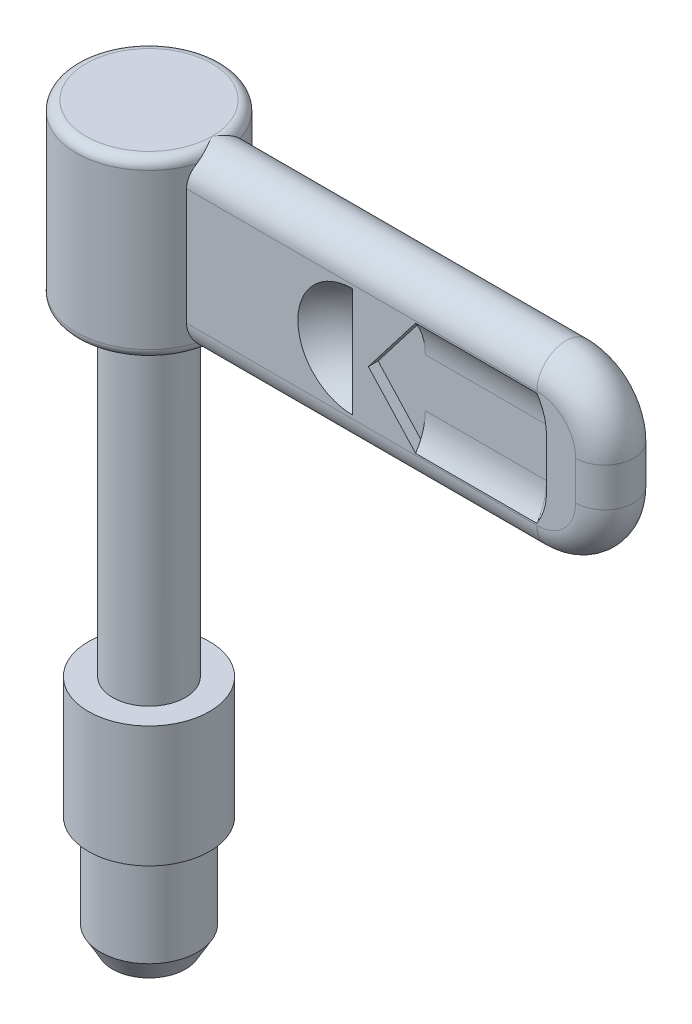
ISO-10303-21;
HEADER;
FILE_DESCRIPTION(('STEP AP214'),'2;1');
FILE_NAME('part.step','',(''),(''),'','','');
FILE_SCHEMA(('AUTOMOTIVE_DESIGN { 1 0 10303 214 1 1 1 1 }'));
ENDSEC;
DATA;
#1=APPLICATION_CONTEXT('core data for automotive mechanical design processes');
#2=APPLICATION_PROTOCOL_DEFINITION('international standard','automotive_design',2000,#1);
#3=PRODUCT_CONTEXT('',#1,'mechanical');
#4=PRODUCT('Part','Part','',(#3));
#5=PRODUCT_RELATED_PRODUCT_CATEGORY('part','',(#4));
#6=PRODUCT_DEFINITION_FORMATION('','',#4);
#7=PRODUCT_DEFINITION_CONTEXT('part definition',#1,'design');
#8=PRODUCT_DEFINITION('design','',#6,#7);
#9=PRODUCT_DEFINITION_SHAPE('','',#8);
#10=(LENGTH_UNIT() NAMED_UNIT(*) SI_UNIT(.MILLI.,.METRE.));
#11=(NAMED_UNIT(*) PLANE_ANGLE_UNIT() SI_UNIT($,.RADIAN.));
#12=(NAMED_UNIT(*) SI_UNIT($,.STERADIAN.) SOLID_ANGLE_UNIT());
#13=UNCERTAINTY_MEASURE_WITH_UNIT(LENGTH_MEASURE(1.E-05),#10,'distance_accuracy_value','');
#14=(GEOMETRIC_REPRESENTATION_CONTEXT(3) GLOBAL_UNCERTAINTY_ASSIGNED_CONTEXT((#13)) GLOBAL_UNIT_ASSIGNED_CONTEXT((#10,
#11,#12)) REPRESENTATION_CONTEXT('',''));
#15=CARTESIAN_POINT('',(0.,0.,0.));
#16=DIRECTION('',(0.,0.,1.));
#17=DIRECTION('',(1.,0.,0.));
#18=AXIS2_PLACEMENT_3D('',#15,#16,#17);
#19=CARTESIAN_POINT('',(-4.82679468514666,10.,4.82679529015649));
#20=DIRECTION('',(0.,1.,0.));
#21=DIRECTION('',(1.,0.,0.));
#22=AXIS2_PLACEMENT_3D('',#19,#20,#21);
#23=PLANE('',#22);
#24=CARTESIAN_POINT('',(0.,10.,0.));
#25=DIRECTION('',(0.,-1.,0.));
#26=DIRECTION('',(0.,0.,1.));
#27=AXIS2_PLACEMENT_3D('',#24,#25,#26);
#28=CIRCLE('',#27,3.);
#29=CARTESIAN_POINT('',(0.,10.,3.));
#30=VERTEX_POINT('',#29);
#31=EDGE_CURVE('E615',#30,#30,#28,.T.);
#32=ORIENTED_EDGE('',*,*,#31,.T.);
#33=EDGE_LOOP('',(#32));
#34=FACE_BOUND('',#33,.T.);
#35=CARTESIAN_POINT('',(0.,10.,0.));
#36=DIRECTION('',(0.,1.,0.));
#37=DIRECTION('',(0.,0.,1.));
#38=AXIS2_PLACEMENT_3D('',#35,#36,#37);
#39=CIRCLE('',#38,5.);
#40=CARTESIAN_POINT('',(0.,10.,5.));
#41=VERTEX_POINT('',#40);
#42=EDGE_CURVE('E23',#41,#41,#39,.T.);
#43=ORIENTED_EDGE('',*,*,#42,.T.);
#44=EDGE_LOOP('',(#43));
#45=FACE_BOUND('',#44,.T.);
#46=ADVANCED_FACE('F15',(#34,#45),#23,.T.);
#47=CARTESIAN_POINT('',(0.,-10.,0.));
#48=DIRECTION('',(0.,-1.,0.));
#49=DIRECTION('',(0.,0.,1.));
#50=AXIS2_PLACEMENT_3D('',#47,#48,#49);
#51=CYLINDRICAL_SURFACE('',#50,3.);
#52=CARTESIAN_POINT('',(0.,36.8,0.));
#53=DIRECTION('',(0.,-1.,0.));
#54=DIRECTION('',(0.,0.,-1.));
#55=AXIS2_PLACEMENT_3D('',#52,#53,#54);
#56=CIRCLE('',#55,3.);
#57=CARTESIAN_POINT('',(0.,36.8,-3.));
#58=VERTEX_POINT('',#57);
#59=EDGE_CURVE('E10',#58,#58,#56,.F.);
#60=ORIENTED_EDGE('',*,*,#59,.F.);
#61=EDGE_LOOP('',(#60));
#62=FACE_BOUND('',#61,.T.);
#63=ORIENTED_EDGE('',*,*,#31,.F.);
#64=EDGE_LOOP('',(#63));
#65=FACE_BOUND('',#64,.T.);
#66=ADVANCED_FACE('F579',(#62,#65),#51,.T.);
#67=CARTESIAN_POINT('',(0.,-10.,0.));
#68=DIRECTION('',(0.,-1.,0.));
#69=DIRECTION('',(7.69370911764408E-10,0.,1.));
#70=AXIS2_PLACEMENT_3D('',#67,#68,#69);
#71=CYLINDRICAL_SURFACE('',#70,5.);
#72=ORIENTED_EDGE('',*,*,#42,.F.);
#73=EDGE_LOOP('',(#72));
#74=FACE_BOUND('',#73,.T.);
#75=CARTESIAN_POINT('',(0.,0.,0.));
#76=DIRECTION('',(0.,-1.,0.));
#77=DIRECTION('',(0.,0.,-1.));
#78=AXIS2_PLACEMENT_3D('',#75,#76,#77);
#79=CIRCLE('',#78,5.);
#80=CARTESIAN_POINT('',(0.,0.,-5.));
#81=VERTEX_POINT('',#80);
#82=EDGE_CURVE('E605',#81,#81,#79,.F.);
#83=ORIENTED_EDGE('',*,*,#82,.T.);
#84=EDGE_LOOP('',(#83));
#85=FACE_BOUND('',#84,.T.);
#86=ADVANCED_FACE('F1100',(#74,#85),#71,.T.);
#87=CARTESIAN_POINT('',(0.,-2.,0.));
#88=DIRECTION('',(0.,-1.,0.));
#89=DIRECTION('',(-1.,0.,0.));
#90=AXIS2_PLACEMENT_3D('',#87,#88,#89);
#91=SPHERICAL_SURFACE('',#90,8.);
#92=CARTESIAN_POINT('',(0.,-9.41135340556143,0.));
#93=DIRECTION('',(0.,1.,0.));
#94=DIRECTION('',(-1.,0.,0.));
#95=AXIS2_PLACEMENT_3D('',#92,#93,#94);
#96=CIRCLE('',#95,3.01194965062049);
#97=CARTESIAN_POINT('',(-3.01194965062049,-9.41135340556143,0.));
#98=VERTEX_POINT('',#97);
#99=EDGE_CURVE('E603',#98,#98,#96,.F.);
#100=ORIENTED_EDGE('',*,*,#99,.T.);
#101=EDGE_LOOP('',(#100));
#102=FACE_BOUND('',#101,.T.);
#103=ADVANCED_FACE('F1105',(#102),#91,.T.);
#104=CARTESIAN_POINT('',(0.,-7.7,0.));
#105=DIRECTION('',(0.,1.,0.));
#106=DIRECTION('',(0.,0.,-1.));
#107=AXIS2_PLACEMENT_3D('',#104,#105,#106);
#108=CONICAL_SURFACE('',#107,4.,0.523598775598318);
#109=ORIENTED_EDGE('',*,*,#99,.F.);
#110=EDGE_LOOP('',(#109));
#111=FACE_BOUND('',#110,.T.);
#112=CARTESIAN_POINT('',(0.,-7.7,0.));
#113=DIRECTION('',(0.,1.,0.));
#114=DIRECTION('',(0.,0.,-1.));
#115=AXIS2_PLACEMENT_3D('',#112,#113,#114);
#116=CIRCLE('',#115,4.);
#117=CARTESIAN_POINT('',(0.,-7.7,-4.));
#118=VERTEX_POINT('',#117);
#119=EDGE_CURVE('E600',#118,#118,#116,.F.);
#120=ORIENTED_EDGE('',*,*,#119,.T.);
#121=EDGE_LOOP('',(#120));
#122=FACE_BOUND('',#121,.T.);
#123=ADVANCED_FACE('F1127',(#111,#122),#108,.T.);
#124=CARTESIAN_POINT('',(0.,-10.,0.));
#125=DIRECTION('',(0.,-1.,0.));
#126=DIRECTION('',(7.69313624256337E-10,0.,1.));
#127=AXIS2_PLACEMENT_3D('',#124,#125,#126);
#128=CYLINDRICAL_SURFACE('',#127,4.);
#129=ORIENTED_EDGE('',*,*,#119,.F.);
#130=EDGE_LOOP('',(#129));
#131=FACE_BOUND('',#130,.T.);
#132=CARTESIAN_POINT('',(0.,-0.5,0.));
#133=DIRECTION('',(0.,1.,0.));
#134=DIRECTION('',(0.,0.,-1.));
#135=AXIS2_PLACEMENT_3D('',#132,#133,#134);
#136=CIRCLE('',#135,4.);
#137=CARTESIAN_POINT('',(0.,-0.5,-4.));
#138=VERTEX_POINT('',#137);
#139=EDGE_CURVE('E597',#138,#138,#136,.F.);
#140=ORIENTED_EDGE('',*,*,#139,.T.);
#141=EDGE_LOOP('',(#140));
#142=FACE_BOUND('',#141,.T.);
#143=ADVANCED_FACE('F1119',(#131,#142),#128,.T.);
#144=CARTESIAN_POINT('',(0.,-0.5,0.));
#145=DIRECTION('',(0.,-1.,0.));
#146=DIRECTION('',(1.92340488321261E-10,0.,1.));
#147=AXIS2_PLACEMENT_3D('',#144,#145,#146);
#148=CONICAL_SURFACE('',#147,4.,0.349065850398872);
#149=ORIENTED_EDGE('',*,*,#139,.F.);
#150=EDGE_LOOP('',(#149));
#151=FACE_BOUND('',#150,.T.);
#152=CARTESIAN_POINT('',(0.,-0.22525225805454,0.));
#153=DIRECTION('',(0.,1.,0.));
#154=DIRECTION('',(0.,0.,-1.));
#155=AXIS2_PLACEMENT_3D('',#152,#153,#154);
#156=CIRCLE('',#155,3.9);
#157=CARTESIAN_POINT('',(0.,-0.22525225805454,-3.9));
#158=VERTEX_POINT('',#157);
#159=EDGE_CURVE('E589',#158,#158,#156,.F.);
#160=ORIENTED_EDGE('',*,*,#159,.T.);
#161=EDGE_LOOP('',(#160));
#162=FACE_BOUND('',#161,.T.);
#163=ADVANCED_FACE('F1111',(#151,#162),#148,.T.);
#164=CARTESIAN_POINT('',(0.,-10.,0.));
#165=DIRECTION('',(0.,-1.,0.));
#166=DIRECTION('',(1.92340488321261E-10,0.,1.));
#167=AXIS2_PLACEMENT_3D('',#164,#165,#166);
#168=CYLINDRICAL_SURFACE('',#167,3.9);
#169=ORIENTED_EDGE('',*,*,#159,.F.);
#170=EDGE_LOOP('',(#169));
#171=FACE_BOUND('',#170,.T.);
#172=CARTESIAN_POINT('',(0.,0.,0.));
#173=DIRECTION('',(0.,-1.,0.));
#174=DIRECTION('',(0.,0.,-1.));
#175=AXIS2_PLACEMENT_3D('',#172,#173,#174);
#176=CIRCLE('',#175,3.9);
#177=CARTESIAN_POINT('',(0.,0.,-3.9));
#178=VERTEX_POINT('',#177);
#179=EDGE_CURVE('E612',#178,#178,#176,.T.);
#180=ORIENTED_EDGE('',*,*,#179,.T.);
#181=EDGE_LOOP('',(#180));
#182=FACE_BOUND('',#181,.T.);
#183=ADVANCED_FACE('F1109',(#171,#182),#168,.T.);
#184=CARTESIAN_POINT('',(-4.82679468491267,0.,-4.82679491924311));
#185=DIRECTION('',(0.,-1.,0.));
#186=DIRECTION('',(1.,0.,0.));
#187=AXIS2_PLACEMENT_3D('',#184,#185,#186);
#188=PLANE('',#187);
#189=ORIENTED_EDGE('',*,*,#82,.F.);
#190=EDGE_LOOP('',(#189));
#191=FACE_BOUND('',#190,.T.);
#192=ORIENTED_EDGE('',*,*,#179,.F.);
#193=EDGE_LOOP('',(#192));
#194=FACE_BOUND('',#193,.T.);
#195=ADVANCED_FACE('F17',(#191,#194),#188,.T.);
#196=CARTESIAN_POINT('',(24.4,39.346700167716,-2.4));
#197=DIRECTION('',(-1.,0.,0.));
#198=DIRECTION('',(0.,0.,1.));
#199=AXIS2_PLACEMENT_3D('',#196,#197,#198);
#200=PLANE('',#199);
#201=CARTESIAN_POINT('',(24.4,42.,-6.39999999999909));
#202=DIRECTION('',(1.,0.,0.));
#203=DIRECTION('',(0.,0.,1.));
#204=AXIS2_PLACEMENT_3D('',#201,#202,#203);
#205=CIRCLE('',#204,4.79999999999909);
#206=CARTESIAN_POINT('',(24.4,42.,-1.6));
#207=VERTEX_POINT('',#206);
#208=CARTESIAN_POINT('',(24.4,39.346700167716,-2.4));
#209=VERTEX_POINT('',#208);
#210=EDGE_CURVE('E910',#207,#209,#205,.T.);
#211=ORIENTED_EDGE('',*,*,#210,.T.);
#212=DIRECTION('',(0.,0.,-1.));
#213=VECTOR('',#212,1.);
#214=CARTESIAN_POINT('',(24.4,39.346700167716,-1.6));
#215=LINE('',#214,#213);
#216=CARTESIAN_POINT('',(24.4,39.346700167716,-1.6));
#217=VERTEX_POINT('',#216);
#218=EDGE_CURVE('E905',#217,#209,#215,.T.);
#219=ORIENTED_EDGE('',*,*,#218,.F.);
#220=DIRECTION('',(0.,1.,0.));
#221=VECTOR('',#220,1.);
#222=CARTESIAN_POINT('',(24.4,39.346700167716,-1.6));
#223=LINE('',#222,#221);
#224=EDGE_CURVE('E194',#217,#207,#223,.T.);
#225=ORIENTED_EDGE('',*,*,#224,.T.);
#226=EDGE_LOOP('',(#211,#219,#225));
#227=FACE_BOUND('',#226,.T.);
#228=ADVANCED_FACE('F1087',(#227),#200,.T.);
#229=CARTESIAN_POINT('',(24.4,46.,-2.4));
#230=DIRECTION('',(-1.,0.,0.));
#231=DIRECTION('',(0.,0.,1.));
#232=AXIS2_PLACEMENT_3D('',#229,#230,#231);
#233=PLANE('',#232);
#234=CARTESIAN_POINT('',(24.4,46.,-6.39999999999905));
#235=DIRECTION('',(1.,0.,0.));
#236=DIRECTION('',(0.,0.552770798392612,0.833333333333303));
#237=AXIS2_PLACEMENT_3D('',#234,#235,#236);
#238=CIRCLE('',#237,4.79999999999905);
#239=CARTESIAN_POINT('',(24.4,48.653299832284,-2.4));
#240=VERTEX_POINT('',#239);
#241=CARTESIAN_POINT('',(24.4,46.,-1.6));
#242=VERTEX_POINT('',#241);
#243=EDGE_CURVE('E189',#240,#242,#238,.T.);
#244=ORIENTED_EDGE('',*,*,#243,.T.);
#245=DIRECTION('',(0.,1.,0.));
#246=VECTOR('',#245,1.);
#247=CARTESIAN_POINT('',(24.4,46.,-1.6));
#248=LINE('',#247,#246);
#249=CARTESIAN_POINT('',(24.4,48.653299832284,-1.6));
#250=VERTEX_POINT('',#249);
#251=EDGE_CURVE('E200',#242,#250,#248,.T.);
#252=ORIENTED_EDGE('',*,*,#251,.T.);
#253=DIRECTION('',(0.,0.,-1.));
#254=VECTOR('',#253,1.);
#255=CARTESIAN_POINT('',(24.4,48.653299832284,-1.6));
#256=LINE('',#255,#254);
#257=EDGE_CURVE('E202',#250,#240,#256,.T.);
#258=ORIENTED_EDGE('',*,*,#257,.T.);
#259=EDGE_LOOP('',(#244,#252,#258));
#260=FACE_BOUND('',#259,.T.);
#261=ADVANCED_FACE('F199',(#260),#233,.T.);
#262=CARTESIAN_POINT('',(20.5,39.346700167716,-1.6));
#263=DIRECTION('',(0.,0.,-1.));
#264=DIRECTION('',(0.,1.,0.));
#265=AXIS2_PLACEMENT_3D('',#262,#263,#264);
#266=PLANE('',#265);
#267=DIRECTION('',(-0.610974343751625,-0.791650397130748,0.));
#268=VECTOR('',#267,1.);
#269=CARTESIAN_POINT('',(24.4,48.653299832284,-1.6));
#270=LINE('',#269,#268);
#271=CARTESIAN_POINT('',(20.5,43.6,-1.6));
#272=VERTEX_POINT('',#271);
#273=EDGE_CURVE('E206',#250,#272,#270,.T.);
#274=ORIENTED_EDGE('',*,*,#273,.F.);
#275=ORIENTED_EDGE('',*,*,#251,.F.);
#276=DIRECTION('',(1.,0.,0.));
#277=VECTOR('',#276,1.);
#278=CARTESIAN_POINT('',(24.4,46.,-1.6));
#279=LINE('',#278,#277);
#280=CARTESIAN_POINT('',(34.4,46.,-1.6));
#281=VERTEX_POINT('',#280);
#282=EDGE_CURVE('E186',#242,#281,#279,.T.);
#283=ORIENTED_EDGE('',*,*,#282,.T.);
#284=DIRECTION('',(0.,-1.,0.));
#285=VECTOR('',#284,1.);
#286=CARTESIAN_POINT('',(34.4,46.,-1.6));
#287=LINE('',#286,#285);
#288=CARTESIAN_POINT('',(34.4,42.,-1.6));
#289=VERTEX_POINT('',#288);
#290=EDGE_CURVE('E193',#289,#281,#287,.F.);
#291=ORIENTED_EDGE('',*,*,#290,.F.);
#292=DIRECTION('',(-1.,0.,0.));
#293=VECTOR('',#292,1.);
#294=CARTESIAN_POINT('',(34.4,42.,-1.6));
#295=LINE('',#294,#293);
#296=EDGE_CURVE('E924',#207,#289,#295,.F.);
#297=ORIENTED_EDGE('',*,*,#296,.F.);
#298=ORIENTED_EDGE('',*,*,#224,.F.);
#299=DIRECTION('',(0.675832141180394,-0.73705557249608,0.));
#300=VECTOR('',#299,1.);
#301=CARTESIAN_POINT('',(20.5,43.6,-1.6));
#302=LINE('',#301,#300);
#303=EDGE_CURVE('E900',#272,#217,#302,.T.);
#304=ORIENTED_EDGE('',*,*,#303,.F.);
#305=EDGE_LOOP('',(#274,#275,#283,#291,#297,#298,#304));
#306=FACE_BOUND('',#305,.T.);
#307=ADVANCED_FACE('F204',(#306),#266,.T.);
#308=CARTESIAN_POINT('',(24.4,39.346700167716,2.4));
#309=DIRECTION('',(-1.,0.,0.));
#310=DIRECTION('',(0.,1.,0.));
#311=AXIS2_PLACEMENT_3D('',#308,#309,#310);
#312=PLANE('',#311);
#313=DIRECTION('',(0.,1.,0.));
#314=VECTOR('',#313,1.);
#315=CARTESIAN_POINT('',(24.4,39.346700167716,1.6));
#316=LINE('',#315,#314);
#317=CARTESIAN_POINT('',(24.4,39.346700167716,1.6));
#318=VERTEX_POINT('',#317);
#319=CARTESIAN_POINT('',(24.4,42.,1.6));
#320=VERTEX_POINT('',#319);
#321=EDGE_CURVE('E779',#318,#320,#316,.T.);
#322=ORIENTED_EDGE('',*,*,#321,.F.);
#323=DIRECTION('',(0.,0.,1.));
#324=VECTOR('',#323,1.);
#325=CARTESIAN_POINT('',(24.4,39.346700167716,1.6));
#326=LINE('',#325,#324);
#327=CARTESIAN_POINT('',(24.4,39.346700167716,2.4));
#328=VERTEX_POINT('',#327);
#329=EDGE_CURVE('E883',#318,#328,#326,.T.);
#330=ORIENTED_EDGE('',*,*,#329,.T.);
#331=CARTESIAN_POINT('',(24.4,42.,6.39999999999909));
#332=DIRECTION('',(-1.,0.,0.));
#333=DIRECTION('',(0.,0.,-1.));
#334=AXIS2_PLACEMENT_3D('',#331,#332,#333);
#335=CIRCLE('',#334,4.79999999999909);
#336=EDGE_CURVE('E754',#328,#320,#335,.F.);
#337=ORIENTED_EDGE('',*,*,#336,.T.);
#338=EDGE_LOOP('',(#322,#330,#337));
#339=FACE_BOUND('',#338,.T.);
#340=ADVANCED_FACE('F1281',(#339),#312,.T.);
#341=CARTESIAN_POINT('',(24.4,46.,2.4));
#342=DIRECTION('',(-1.,0.,0.));
#343=DIRECTION('',(0.,1.,0.));
#344=AXIS2_PLACEMENT_3D('',#341,#342,#343);
#345=PLANE('',#344);
#346=DIRECTION('',(0.,0.,-1.));
#347=VECTOR('',#346,1.);
#348=CARTESIAN_POINT('',(24.4,48.653299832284,2.4));
#349=LINE('',#348,#347);
#350=CARTESIAN_POINT('',(24.4,48.653299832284,1.6));
#351=VERTEX_POINT('',#350);
#352=CARTESIAN_POINT('',(24.4,48.653299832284,2.4));
#353=VERTEX_POINT('',#352);
#354=EDGE_CURVE('E876',#351,#353,#349,.F.);
#355=ORIENTED_EDGE('',*,*,#354,.F.);
#356=DIRECTION('',(0.,1.,0.));
#357=VECTOR('',#356,1.);
#358=CARTESIAN_POINT('',(24.4,46.,1.6));
#359=LINE('',#358,#357);
#360=CARTESIAN_POINT('',(24.4,46.,1.6));
#361=VERTEX_POINT('',#360);
#362=EDGE_CURVE('E764',#361,#351,#359,.T.);
#363=ORIENTED_EDGE('',*,*,#362,.F.);
#364=CARTESIAN_POINT('',(24.4,46.,6.39999999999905));
#365=DIRECTION('',(-1.,0.,0.));
#366=DIRECTION('',(0.,0.552770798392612,-0.833333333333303));
#367=AXIS2_PLACEMENT_3D('',#364,#365,#366);
#368=CIRCLE('',#367,4.79999999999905);
#369=EDGE_CURVE('E718',#361,#353,#368,.F.);
#370=ORIENTED_EDGE('',*,*,#369,.T.);
#371=EDGE_LOOP('',(#355,#363,#370));
#372=FACE_BOUND('',#371,.T.);
#373=ADVANCED_FACE('F862',(#372),#345,.T.);
#374=CARTESIAN_POINT('',(34.4,39.346700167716,1.6));
#375=DIRECTION('',(0.,0.,1.));
#376=DIRECTION('',(0.,1.,0.));
#377=AXIS2_PLACEMENT_3D('',#374,#375,#376);
#378=PLANE('',#377);
#379=DIRECTION('',(0.,1.,0.));
#380=VECTOR('',#379,1.);
#381=CARTESIAN_POINT('',(34.4,42.,1.6));
#382=LINE('',#381,#380);
#383=CARTESIAN_POINT('',(34.4,42.,1.6));
#384=VERTEX_POINT('',#383);
#385=CARTESIAN_POINT('',(34.4,46.,1.6));
#386=VERTEX_POINT('',#385);
#387=EDGE_CURVE('E759',#384,#386,#382,.T.);
#388=ORIENTED_EDGE('',*,*,#387,.T.);
#389=DIRECTION('',(1.,0.,0.));
#390=VECTOR('',#389,1.);
#391=CARTESIAN_POINT('',(24.4,46.,1.6));
#392=LINE('',#391,#390);
#393=EDGE_CURVE('E1407',#361,#386,#392,.T.);
#394=ORIENTED_EDGE('',*,*,#393,.F.);
#395=ORIENTED_EDGE('',*,*,#362,.T.);
#396=DIRECTION('',(-0.610974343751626,-0.791650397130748,0.));
#397=VECTOR('',#396,1.);
#398=CARTESIAN_POINT('',(24.4,48.653299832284,1.6));
#399=LINE('',#398,#397);
#400=CARTESIAN_POINT('',(20.5,43.6,1.6));
#401=VERTEX_POINT('',#400);
#402=EDGE_CURVE('E769',#351,#401,#399,.T.);
#403=ORIENTED_EDGE('',*,*,#402,.T.);
#404=DIRECTION('',(0.675832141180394,-0.73705557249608,0.));
#405=VECTOR('',#404,1.);
#406=CARTESIAN_POINT('',(20.5,43.6,1.6));
#407=LINE('',#406,#405);
#408=EDGE_CURVE('E774',#401,#318,#407,.T.);
#409=ORIENTED_EDGE('',*,*,#408,.T.);
#410=ORIENTED_EDGE('',*,*,#321,.T.);
#411=DIRECTION('',(-1.,0.,0.));
#412=VECTOR('',#411,1.);
#413=CARTESIAN_POINT('',(34.4,42.,1.6));
#414=LINE('',#413,#412);
#415=EDGE_CURVE('E746',#320,#384,#414,.F.);
#416=ORIENTED_EDGE('',*,*,#415,.T.);
#417=EDGE_LOOP('',(#388,#394,#395,#403,#409,#410,#416));
#418=FACE_BOUND('',#417,.T.);
#419=ADVANCED_FACE('F737',(#418),#378,.T.);
#420=CARTESIAN_POINT('',(-5.26994701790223,51.2,5.19982016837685));
#421=DIRECTION('',(0.,1.,0.));
#422=DIRECTION('',(1.,0.,0.));
#423=AXIS2_PLACEMENT_3D('',#420,#421,#422);
#424=PLANE('',#423);
#425=CARTESIAN_POINT('',(0.,51.2,0.));
#426=DIRECTION('',(0.,1.,0.));
#427=DIRECTION('',(-0.707106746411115,0.,0.707106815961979));
#428=AXIS2_PLACEMENT_3D('',#425,#426,#427);
#429=CIRCLE('',#428,5.20000086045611);
#430=CARTESIAN_POINT('',(5.20000086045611,51.2,0.));
#431=VERTEX_POINT('',#430);
#432=EDGE_CURVE('E445',#431,#431,#429,.F.);
#433=ORIENTED_EDGE('',*,*,#432,.F.);
#434=EDGE_LOOP('',(#433));
#435=FACE_BOUND('',#434,.T.);
#436=ADVANCED_FACE('F474',(#435),#424,.T.);
#437=CARTESIAN_POINT('',(19.2,44.,-6.5));
#438=DIRECTION('',(0.,1.,0.));
#439=DIRECTION('',(-0.757114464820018,0.,0.653282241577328));
#440=AXIS2_PLACEMENT_3D('',#437,#438,#439);
#441=SPHERICAL_SURFACE('',#440,6.1);
#442=CARTESIAN_POINT('',(19.2,48.5166359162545,-2.40000000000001));
#443=CARTESIAN_POINT('',(19.2,48.4454248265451,-2.32154854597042));
#444=CARTESIAN_POINT('',(19.2,48.3721661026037,-2.24495617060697));
#445=CARTESIAN_POINT('',(19.2,48.2217605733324,-2.09568910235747));
#446=CARTESIAN_POINT('',(19.2,48.1446137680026,-2.02301440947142));
#447=CARTESIAN_POINT('',(19.2,47.9866392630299,-1.88178223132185));
#448=CARTESIAN_POINT('',(19.2,47.9058115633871,-1.81322474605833));
#449=CARTESIAN_POINT('',(19.2,47.7406952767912,-1.68041248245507));
#450=CARTESIAN_POINT('',(19.2,47.656406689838,-1.61615770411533));
#451=CARTESIAN_POINT('',(19.2,47.4845972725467,-1.49212543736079));
#452=CARTESIAN_POINT('',(19.2,47.3970764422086,-1.432347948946));
#453=CARTESIAN_POINT('',(19.2,47.2190401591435,-1.31743248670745));
#454=CARTESIAN_POINT('',(19.2,47.1285247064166,-1.2622945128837));
#455=CARTESIAN_POINT('',(19.2,46.944744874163,-1.1568077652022));
#456=CARTESIAN_POINT('',(19.2,46.8514804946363,-1.10645899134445));
#457=CARTESIAN_POINT('',(19.2,46.6624559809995,-1.01068731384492));
#458=CARTESIAN_POINT('',(19.2,46.5666958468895,-0.965264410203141));
#459=CARTESIAN_POINT('',(19.2,46.3729397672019,-0.879467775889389));
#460=CARTESIAN_POINT('',(19.2,46.2749438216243,-0.839094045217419));
#461=CARTESIAN_POINT('',(19.2,46.0769821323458,-0.763505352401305));
#462=CARTESIAN_POINT('',(19.2,45.9770163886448,-0.728290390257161));
#463=CARTESIAN_POINT('',(19.2,45.7753864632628,-0.663114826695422));
#464=CARTESIAN_POINT('',(19.2,45.6737222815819,-0.633154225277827));
#465=CARTESIAN_POINT('',(19.2,45.4689714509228,-0.578568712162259));
#466=CARTESIAN_POINT('',(19.2,45.3658848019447,-0.553943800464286));
#467=CARTESIAN_POINT('',(19.2,45.1585688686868,-0.510096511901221));
#468=CARTESIAN_POINT('',(19.2,45.054339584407,-0.490874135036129));
#469=CARTESIAN_POINT('',(19.2,44.8450213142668,-0.457884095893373));
#470=CARTESIAN_POINT('',(19.2,44.7399323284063,-0.44411643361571));
#471=CARTESIAN_POINT('',(19.2,44.5291799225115,-0.422073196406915));
#472=CARTESIAN_POINT('',(19.2,44.4235165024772,-0.413797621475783));
#473=CARTESIAN_POINT('',(19.2,44.2119020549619,-0.402761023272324));
#474=CARTESIAN_POINT('',(19.2,44.105951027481,-0.399999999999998));
#475=CARTESIAN_POINT('',(19.2,43.894048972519,-0.399999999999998));
#476=CARTESIAN_POINT('',(19.2,43.7880979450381,-0.402761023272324));
#477=CARTESIAN_POINT('',(19.2,43.5764834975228,-0.413797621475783));
#478=CARTESIAN_POINT('',(19.2,43.4708200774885,-0.422073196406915));
#479=CARTESIAN_POINT('',(19.2,43.2600676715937,-0.44411643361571));
#480=CARTESIAN_POINT('',(19.2,43.1549786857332,-0.457884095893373));
#481=CARTESIAN_POINT('',(19.2,42.945660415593,-0.490874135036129));
#482=CARTESIAN_POINT('',(19.2,42.8414311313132,-0.510096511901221));
#483=CARTESIAN_POINT('',(19.2,42.6341151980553,-0.553943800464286));
#484=CARTESIAN_POINT('',(19.2,42.5310285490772,-0.578568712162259));
#485=CARTESIAN_POINT('',(19.2,42.3262777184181,-0.633154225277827));
#486=CARTESIAN_POINT('',(19.2,42.2246135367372,-0.663114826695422));
#487=CARTESIAN_POINT('',(19.2,42.0229836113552,-0.728290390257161));
#488=CARTESIAN_POINT('',(19.2,41.9230178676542,-0.763505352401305));
#489=CARTESIAN_POINT('',(19.2,41.7250561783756,-0.839094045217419));
#490=CARTESIAN_POINT('',(19.2,41.6270602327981,-0.879467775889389));
#491=CARTESIAN_POINT('',(19.2,41.4333041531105,-0.965264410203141));
#492=CARTESIAN_POINT('',(19.2,41.3375440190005,-1.01068731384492));
#493=CARTESIAN_POINT('',(19.2,41.1485195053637,-1.10645899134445));
#494=CARTESIAN_POINT('',(19.2,41.055255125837,-1.1568077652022));
#495=CARTESIAN_POINT('',(19.2,40.8714752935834,-1.2622945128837));
#496=CARTESIAN_POINT('',(19.2,40.7809598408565,-1.31743248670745));
#497=CARTESIAN_POINT('',(19.2,40.6029235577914,-1.432347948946));
#498=CARTESIAN_POINT('',(19.2,40.5154027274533,-1.49212543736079));
#499=CARTESIAN_POINT('',(19.2,40.343593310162,-1.61615770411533));
#500=CARTESIAN_POINT('',(19.2,40.2593047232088,-1.68041248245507));
#501=CARTESIAN_POINT('',(19.2,40.0941884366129,-1.81322474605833));
#502=CARTESIAN_POINT('',(19.2,40.0133607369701,-1.88178223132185));
#503=CARTESIAN_POINT('',(19.2,39.8553862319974,-2.02301440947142));
#504=CARTESIAN_POINT('',(19.2,39.7782394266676,-2.09568910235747));
#505=CARTESIAN_POINT('',(19.2,39.6278338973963,-2.24495617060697));
#506=CARTESIAN_POINT('',(19.2,39.5545751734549,-2.32154854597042));
#507=CARTESIAN_POINT('',(19.2,39.4833640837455,-2.40000000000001));
#508=B_SPLINE_CURVE_WITH_KNOTS('',3,(#442,#443,#444,#445,#446,#447,#448,#449,#450,#451,#452,
#453,#454,#455,#456,#457,#458,#459,#460,#461,#462,#463,#464,#465,#466,#467,#468,#469,#470,#471,
#472,#473,#474,#475,#476,#477,#478,#479,#480,#481,#482,#483,#484,#485,#486,#487,#488,#489,#490,
#491,#492,#493,#494,#495,#496,#497,#498,#499,#500,#501,#502,#503,#504,#505,#506,#507),
.UNSPECIFIED.,.F.,.F.,(4,2,2,2,2,2,2,2,2,2,2,2,2,2,2,2,2,2,2,2,2,2,2,2,2,2,2,2,2,2,2,2,4),(0.,
0.31781713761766,0.635634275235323,0.953451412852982,1.27126855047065,1.58908568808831,
1.90690282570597,2.22471996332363,2.54253710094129,2.86035423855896,3.17817137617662,
3.49598851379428,3.81380565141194,4.13162278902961,4.44943992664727,4.76725706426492,
5.08507420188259,5.40289133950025,5.72070847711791,6.03852561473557,6.35634275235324,
6.6741598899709,6.99197702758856,7.30979416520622,7.62761130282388,7.94542844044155,
8.26324557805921,8.58106271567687,8.89887985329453,9.2166969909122,9.53451412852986,
9.85233126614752,10.1701484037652),.UNSPECIFIED.);
#509=CARTESIAN_POINT('',(19.2,48.5166359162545,-2.4));
#510=VERTEX_POINT('',#509);
#511=CARTESIAN_POINT('',(19.2,39.4833640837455,-2.4));
#512=VERTEX_POINT('',#511);
#513=EDGE_CURVE('E619',#510,#512,#508,.T.);
#514=ORIENTED_EDGE('',*,*,#513,.T.);
#515=CARTESIAN_POINT('',(19.2,48.5166359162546,-2.4));
#516=CARTESIAN_POINT('',(18.9546860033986,48.5166359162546,-2.4));
#517=CARTESIAN_POINT('',(18.7168170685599,48.497667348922,-2.4));
#518=CARTESIAN_POINT('',(18.2531812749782,48.4236894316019,-2.4));
#519=CARTESIAN_POINT('',(18.0274144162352,48.3686800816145,-2.4));
#520=CARTESIAN_POINT('',(17.4769210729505,48.1892198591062,-2.4));
#521=CARTESIAN_POINT('',(17.1604140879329,48.0445418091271,-2.4));
#522=CARTESIAN_POINT('',(16.3438787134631,47.5541631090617,-2.4));
#523=CARTESIAN_POINT('',(15.9075997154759,47.1448744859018,-2.4));
#524=CARTESIAN_POINT('',(14.2350139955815,44.885547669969,-2.4));
#525=CARTESIAN_POINT('',(14.4291116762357,42.3834005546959,-2.4));
#526=CARTESIAN_POINT('',(16.3373888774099,40.4751233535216,-2.4));
#527=CARTESIAN_POINT('',(16.7125489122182,40.1965456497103,-2.4));
#528=CARTESIAN_POINT('',(17.4532373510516,39.8214275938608,-2.4));
#529=CARTESIAN_POINT('',(17.7758823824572,39.6989351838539,-2.4));
#530=CARTESIAN_POINT('',(18.4689492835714,39.5270686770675,-2.4));
#531=CARTESIAN_POINT('',(18.8301279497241,39.4833640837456,-2.4));
#532=CARTESIAN_POINT('',(19.2,39.4833640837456,-2.4));
#533=B_SPLINE_CURVE_WITH_KNOTS('',3,(#515,#516,#517,#518,#519,#520,#521,#522,#523,#524,#525,
#526,#527,#528,#529,#530,#531,#532),.UNSPECIFIED.,.F.,.F.,(4,2,2,2,2,2,2,2,4),(0.,
0.0452435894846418,0.0904871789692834,0.157885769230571,0.280523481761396,0.759938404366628,
0.860594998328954,0.929100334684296,1.),.UNSPECIFIED.);
#534=EDGE_CURVE('E290',#510,#512,#533,.T.);
#535=ORIENTED_EDGE('',*,*,#534,.F.);
#536=EDGE_LOOP('',(#514,#535));
#537=FACE_BOUND('',#536,.T.);
#538=ADVANCED_FACE('F676',(#537),#441,.F.);
#539=CARTESIAN_POINT('',(19.2,39.4833640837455,-0.4));
#540=DIRECTION('',(-1.,0.,0.));
#541=DIRECTION('',(0.,1.,0.));
#542=AXIS2_PLACEMENT_3D('',#539,#540,#541);
#543=PLANE('',#542);
#544=ORIENTED_EDGE('',*,*,#513,.F.);
#545=DIRECTION('',(0.,1.,0.));
#546=VECTOR('',#545,1.);
#547=CARTESIAN_POINT('',(19.2,39.4833640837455,-2.4));
#548=LINE('',#547,#546);
#549=EDGE_CURVE('E1057',#512,#510,#548,.T.);
#550=ORIENTED_EDGE('',*,*,#549,.F.);
#551=EDGE_LOOP('',(#544,#550));
#552=FACE_BOUND('',#551,.T.);
#553=ADVANCED_FACE('F685',(#552),#543,.T.);
#554=CARTESIAN_POINT('',(34.4,48.653299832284,-2.4));
#555=DIRECTION('',(0.,1.,0.));
#556=DIRECTION('',(0.,0.,1.));
#557=AXIS2_PLACEMENT_3D('',#554,#555,#556);
#558=CYLINDRICAL_SURFACE('',#557,0.8);
#559=CARTESIAN_POINT('',(35.2,46.,-2.4));
#560=CARTESIAN_POINT('',(35.2000000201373,46.,-2.38690275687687));
#561=CARTESIAN_POINT('',(35.1996722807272,46.,-2.37380580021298));
#562=CARTESIAN_POINT('',(35.1983673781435,46.,-2.34763310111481));
#563=CARTESIAN_POINT('',(35.1973896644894,46.,-2.33455738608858));
#564=CARTESIAN_POINT('',(35.1947902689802,46.,-2.30846348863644));
#565=CARTESIAN_POINT('',(35.1931682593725,46.,-2.29544533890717));
#566=CARTESIAN_POINT('',(35.1892868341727,46.,-2.26950166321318));
#567=CARTESIAN_POINT('',(35.187027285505,46.,-2.25657615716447));
#568=CARTESIAN_POINT('',(35.1818784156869,46.,-2.23085188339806));
#569=CARTESIAN_POINT('',(35.1789891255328,46.,-2.21805310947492));
#570=CARTESIAN_POINT('',(35.1725894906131,46.,-2.19261536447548));
#571=CARTESIAN_POINT('',(35.1690793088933,46.,-2.17997635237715));
#572=CARTESIAN_POINT('',(35.161447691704,46.,-2.15489015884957));
#573=CARTESIAN_POINT('',(35.1573265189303,46.,-2.1424428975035));
#574=CARTESIAN_POINT('',(35.1484838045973,46.,-2.11777118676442));
#575=CARTESIAN_POINT('',(35.1437625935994,46.,-2.10554661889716));
#576=CARTESIAN_POINT('',(35.1337317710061,46.,-2.08135022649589));
#577=CARTESIAN_POINT('',(35.1284225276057,46.,-2.06937824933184));
#578=CARTESIAN_POINT('',(35.1172286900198,46.,-2.04571591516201));
#579=CARTESIAN_POINT('',(35.1113444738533,46.,-2.03402537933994));
#580=CARTESIAN_POINT('',(35.0990148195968,46.,-2.0109537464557));
#581=CARTESIAN_POINT('',(35.0925697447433,46.,-1.99957245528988));
#582=CARTESIAN_POINT('',(35.0791335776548,46.,-1.977146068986));
#583=CARTESIAN_POINT('',(35.0721428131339,46.,-1.96610077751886));
#584=CARTESIAN_POINT('',(35.0576315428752,46.,-1.94437208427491));
#585=CARTESIAN_POINT('',(35.0501113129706,46.,-1.93368849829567));
#586=CARTESIAN_POINT('',(35.034558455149,46.,-1.91270784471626));
#587=CARTESIAN_POINT('',(35.0265260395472,46.,-1.90241061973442));
#588=CARTESIAN_POINT('',(35.0099672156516,46.,-1.88222625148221));
#589=CARTESIAN_POINT('',(35.0014409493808,46.,-1.87233899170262));
#590=CARTESIAN_POINT('',(34.9839138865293,46.,-1.8529970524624));
#591=CARTESIAN_POINT('',(34.9749131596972,46.,-1.84354230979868));
#592=CARTESIAN_POINT('',(34.9564576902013,46.,-1.82508684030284));
#593=CARTESIAN_POINT('',(34.9470029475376,46.,-1.81608611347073));
#594=CARTESIAN_POINT('',(34.9276610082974,46.,-1.79855905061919));
#595=CARTESIAN_POINT('',(34.9177737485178,46.,-1.79003278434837));
#596=CARTESIAN_POINT('',(34.8975893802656,46.,-1.77347396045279));
#597=CARTESIAN_POINT('',(34.8872921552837,46.,-1.76544154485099));
#598=CARTESIAN_POINT('',(34.8663115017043,46.,-1.74988868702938));
#599=CARTESIAN_POINT('',(34.8556279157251,46.,-1.74236845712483));
#600=CARTESIAN_POINT('',(34.8338992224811,46.,-1.72785718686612));
#601=CARTESIAN_POINT('',(34.822853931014,46.,-1.7208664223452));
#602=CARTESIAN_POINT('',(34.8004275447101,46.,-1.70743025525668));
#603=CARTESIAN_POINT('',(34.7890462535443,46.,-1.70098518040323));
#604=CARTESIAN_POINT('',(34.7659746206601,46.,-1.68865552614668));
#605=CARTESIAN_POINT('',(34.754284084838,46.,-1.68277130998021));
#606=CARTESIAN_POINT('',(34.7306217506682,46.,-1.67157747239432));
#607=CARTESIAN_POINT('',(34.7186497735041,46.,-1.66626822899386));
#608=CARTESIAN_POINT('',(34.6944533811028,46.,-1.65623740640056));
#609=CARTESIAN_POINT('',(34.6822288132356,46.,-1.65151619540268));
#610=CARTESIAN_POINT('',(34.6575571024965,46.,-1.64267348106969));
#611=CARTESIAN_POINT('',(34.6451098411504,46.,-1.63855230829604));
#612=CARTESIAN_POINT('',(34.6200236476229,46.,-1.63092069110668));
#613=CARTESIAN_POINT('',(34.6073846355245,46.,-1.62741050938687));
#614=CARTESIAN_POINT('',(34.5819468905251,46.,-1.62101087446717));
#615=CARTESIAN_POINT('',(34.569148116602,46.,-1.61812158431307));
#616=CARTESIAN_POINT('',(34.5434238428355,46.,-1.61297271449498));
#617=CARTESIAN_POINT('',(34.5304983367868,46.,-1.61071316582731));
#618=CARTESIAN_POINT('',(34.5045546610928,46.,-1.60683174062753));
#619=CARTESIAN_POINT('',(34.4915365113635,46.,-1.60520973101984));
#620=CARTESIAN_POINT('',(34.4654426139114,46.,-1.60261033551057));
#621=CARTESIAN_POINT('',(34.4523668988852,46.,-1.60163262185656));
#622=CARTESIAN_POINT('',(34.426194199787,46.,-1.60032771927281));
#623=CARTESIAN_POINT('',(34.4130972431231,46.,-1.59999997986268));
#624=CARTESIAN_POINT('',(34.4,46.,-1.6));
#625=B_SPLINE_CURVE_WITH_KNOTS('',3,(#559,#560,#561,#562,#563,#564,#565,#566,#567,#568,#569,
#570,#571,#572,#573,#574,#575,#576,#577,#578,#579,#580,#581,#582,#583,#584,#585,#586,#587,#588,
#589,#590,#591,#592,#593,#594,#595,#596,#597,#598,#599,#600,#601,#602,#603,#604,#605,#606,#607,
#608,#609,#610,#611,#612,#613,#614,#615,#616,#617,#618,#619,#620,#621,#622,#623,#624),
.UNSPECIFIED.,.F.,.F.,(4,2,2,2,2,2,2,2,2,2,2,2,2,2,2,2,2,2,2,2,2,2,2,2,2,2,2,2,2,2,2,2,4),(0.,
0.039287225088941,0.0786077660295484,0.117948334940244,0.157297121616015,0.196643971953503,
0.235980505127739,0.275300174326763,0.314598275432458,0.353871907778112,0.393119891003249,
0.432342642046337,0.47154201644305,0.510721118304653,0.549884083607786,0.589035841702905,
0.62818186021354,0.667327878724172,0.706479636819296,0.745642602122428,0.784821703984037,
0.824021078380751,0.863243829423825,0.902491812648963,0.941765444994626,0.981063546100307,
1.02038321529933,1.05971974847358,1.09906659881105,1.13841538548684,1.17775595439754,
1.21707649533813,1.25636372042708),.UNSPECIFIED.);
#626=CARTESIAN_POINT('',(35.2,46.,-2.4));
#627=VERTEX_POINT('',#626);
#628=EDGE_CURVE('E977',#281,#627,#625,.F.);
#629=ORIENTED_EDGE('',*,*,#628,.T.);
#630=DIRECTION('',(0.,1.,0.));
#631=VECTOR('',#630,1.);
#632=CARTESIAN_POINT('',(35.2,42.,-2.4));
#633=LINE('',#632,#631);
#634=CARTESIAN_POINT('',(35.2,42.,-2.4));
#635=VERTEX_POINT('',#634);
#636=EDGE_CURVE('E1056',#635,#627,#633,.T.);
#637=ORIENTED_EDGE('',*,*,#636,.F.);
#638=CARTESIAN_POINT('',(34.4,42.,-1.6));
#639=CARTESIAN_POINT('',(34.4130972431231,42.,-1.59999997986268));
#640=CARTESIAN_POINT('',(34.426194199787,42.,-1.60032771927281));
#641=CARTESIAN_POINT('',(34.4523668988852,42.,-1.60163262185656));
#642=CARTESIAN_POINT('',(34.4654426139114,42.,-1.60261033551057));
#643=CARTESIAN_POINT('',(34.4915365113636,42.,-1.60520973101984));
#644=CARTESIAN_POINT('',(34.5045546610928,42.,-1.60683174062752));
#645=CARTESIAN_POINT('',(34.5304983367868,42.,-1.61071316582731));
#646=CARTESIAN_POINT('',(34.5434238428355,42.,-1.61297271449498));
#647=CARTESIAN_POINT('',(34.5691481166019,42.,-1.61812158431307));
#648=CARTESIAN_POINT('',(34.5819468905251,42.,-1.62101087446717));
#649=CARTESIAN_POINT('',(34.6073846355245,42.,-1.62741050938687));
#650=CARTESIAN_POINT('',(34.6200236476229,42.,-1.63092069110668));
#651=CARTESIAN_POINT('',(34.6451098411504,42.,-1.63855230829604));
#652=CARTESIAN_POINT('',(34.6575571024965,42.,-1.64267348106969));
#653=CARTESIAN_POINT('',(34.6822288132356,42.,-1.65151619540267));
#654=CARTESIAN_POINT('',(34.6944533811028,42.,-1.65623740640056));
#655=CARTESIAN_POINT('',(34.7186497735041,42.,-1.66626822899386));
#656=CARTESIAN_POINT('',(34.7306217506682,42.,-1.67157747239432));
#657=CARTESIAN_POINT('',(34.754284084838,42.,-1.68277130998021));
#658=CARTESIAN_POINT('',(34.7659746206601,42.,-1.68865552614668));
#659=CARTESIAN_POINT('',(34.7890462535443,42.,-1.70098518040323));
#660=CARTESIAN_POINT('',(34.8004275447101,42.,-1.70743025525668));
#661=CARTESIAN_POINT('',(34.822853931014,42.,-1.7208664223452));
#662=CARTESIAN_POINT('',(34.8338992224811,42.,-1.72785718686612));
#663=CARTESIAN_POINT('',(34.8556279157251,42.,-1.74236845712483));
#664=CARTESIAN_POINT('',(34.8663115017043,42.,-1.74988868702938));
#665=CARTESIAN_POINT('',(34.8872921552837,42.,-1.76544154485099));
#666=CARTESIAN_POINT('',(34.8975893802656,42.,-1.77347396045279));
#667=CARTESIAN_POINT('',(34.9177737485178,42.,-1.79003278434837));
#668=CARTESIAN_POINT('',(34.9276610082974,42.,-1.79855905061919));
#669=CARTESIAN_POINT('',(34.9470029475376,42.,-1.81608611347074));
#670=CARTESIAN_POINT('',(34.9564576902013,42.,-1.82508684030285));
#671=CARTESIAN_POINT('',(34.9749131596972,42.,-1.84354230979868));
#672=CARTESIAN_POINT('',(34.9839138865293,42.,-1.8529970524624));
#673=CARTESIAN_POINT('',(35.0014409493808,42.,-1.87233899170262));
#674=CARTESIAN_POINT('',(35.0099672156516,42.,-1.88222625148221));
#675=CARTESIAN_POINT('',(35.0265260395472,42.,-1.90241061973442));
#676=CARTESIAN_POINT('',(35.034558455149,42.,-1.91270784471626));
#677=CARTESIAN_POINT('',(35.0501113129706,42.,-1.93368849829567));
#678=CARTESIAN_POINT('',(35.0576315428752,42.,-1.94437208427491));
#679=CARTESIAN_POINT('',(35.0721428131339,42.,-1.96610077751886));
#680=CARTESIAN_POINT('',(35.0791335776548,42.,-1.977146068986));
#681=CARTESIAN_POINT('',(35.0925697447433,42.,-1.99957245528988));
#682=CARTESIAN_POINT('',(35.0990148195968,42.,-2.0109537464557));
#683=CARTESIAN_POINT('',(35.1113444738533,42.,-2.03402537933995));
#684=CARTESIAN_POINT('',(35.1172286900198,42.,-2.04571591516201));
#685=CARTESIAN_POINT('',(35.1284225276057,42.,-2.06937824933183));
#686=CARTESIAN_POINT('',(35.1337317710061,42.,-2.08135022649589));
#687=CARTESIAN_POINT('',(35.1437625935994,42.,-2.10554661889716));
#688=CARTESIAN_POINT('',(35.1484838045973,42.,-2.11777118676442));
#689=CARTESIAN_POINT('',(35.1573265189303,42.,-2.1424428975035));
#690=CARTESIAN_POINT('',(35.161447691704,42.,-2.15489015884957));
#691=CARTESIAN_POINT('',(35.1690793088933,42.,-2.17997635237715));
#692=CARTESIAN_POINT('',(35.1725894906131,42.,-2.19261536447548));
#693=CARTESIAN_POINT('',(35.1789891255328,42.,-2.21805310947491));
#694=CARTESIAN_POINT('',(35.1818784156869,42.,-2.23085188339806));
#695=CARTESIAN_POINT('',(35.187027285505,42.,-2.25657615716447));
#696=CARTESIAN_POINT('',(35.1892868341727,42.,-2.26950166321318));
#697=CARTESIAN_POINT('',(35.1931682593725,42.,-2.29544533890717));
#698=CARTESIAN_POINT('',(35.1947902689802,42.,-2.30846348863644));
#699=CARTESIAN_POINT('',(35.1973896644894,42.,-2.33455738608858));
#700=CARTESIAN_POINT('',(35.1983673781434,42.,-2.34763310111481));
#701=CARTESIAN_POINT('',(35.1996722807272,42.,-2.37380580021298));
#702=CARTESIAN_POINT('',(35.2000000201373,42.,-2.38690275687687));
#703=CARTESIAN_POINT('',(35.2,42.,-2.4));
#704=B_SPLINE_CURVE_WITH_KNOTS('',3,(#638,#639,#640,#641,#642,#643,#644,#645,#646,#647,#648,
#649,#650,#651,#652,#653,#654,#655,#656,#657,#658,#659,#660,#661,#662,#663,#664,#665,#666,#667,
#668,#669,#670,#671,#672,#673,#674,#675,#676,#677,#678,#679,#680,#681,#682,#683,#684,#685,#686,
#687,#688,#689,#690,#691,#692,#693,#694,#695,#696,#697,#698,#699,#700,#701,#702,#703),
.UNSPECIFIED.,.F.,.F.,(4,2,2,2,2,2,2,2,2,2,2,2,2,2,2,2,2,2,2,2,2,2,2,2,2,2,2,2,2,2,2,2,4),(0.,
0.0392872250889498,0.0786077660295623,0.117948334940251,0.157297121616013,0.196643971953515,
0.235980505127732,0.275300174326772,0.31459827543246,0.353871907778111,0.393119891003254,
0.43234264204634,0.471542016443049,0.510721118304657,0.549884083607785,0.589035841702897,
0.62818186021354,0.667327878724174,0.706479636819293,0.745642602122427,0.78482170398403,
0.824021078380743,0.863243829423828,0.902491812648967,0.941765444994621,0.981063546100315,
1.02038321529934,1.05971974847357,1.09906659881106,1.13841538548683,1.17775595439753,
1.21707649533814,1.25636372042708),.UNSPECIFIED.);
#705=EDGE_CURVE('E30',#289,#635,#704,.T.);
#706=ORIENTED_EDGE('',*,*,#705,.F.);
#707=ORIENTED_EDGE('',*,*,#290,.T.);
#708=EDGE_LOOP('',(#629,#637,#706,#707));
#709=FACE_BOUND('',#708,.T.);
#710=ADVANCED_FACE('F953',(#709),#558,.F.);
#711=CARTESIAN_POINT('',(34.4,42.,-1.6));
#712=CARTESIAN_POINT('',(34.4,40.5553686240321,-1.60869976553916));
#713=CARTESIAN_POINT('',(34.4,39.346700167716,-2.4));
#714=CARTESIAN_POINT('',(34.714159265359,42.,-1.6));
#715=CARTESIAN_POINT('',(34.7107428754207,40.5553686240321,-1.60869976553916));
#716=CARTESIAN_POINT('',(34.4,39.346700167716,-2.4));
#717=CARTESIAN_POINT('',(35.0323882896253,42.,-1.76761171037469));
#718=CARTESIAN_POINT('',(35.0255112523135,40.5553686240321,-1.77448874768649));
#719=CARTESIAN_POINT('',(34.4,39.346700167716,-2.4));
#720=CARTESIAN_POINT('',(35.2,42.,-2.08584073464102));
#721=CARTESIAN_POINT('',(35.1913002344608,40.5553686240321,-2.08925712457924));
#722=CARTESIAN_POINT('',(34.4,39.346700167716,-2.4));
#723=CARTESIAN_POINT('',(35.2,42.,-2.4));
#724=CARTESIAN_POINT('',(35.1913002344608,40.5553686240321,-2.4));
#725=CARTESIAN_POINT('',(34.4,39.346700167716,-2.4));
#726=B_SPLINE_SURFACE_WITH_KNOTS('',4,2,((#711,#712,#713),(#714,#715,#716),(#717,#718,#719),
(#720,#721,#722),(#723,#724,#725)),.UNSPECIFIED.,.F.,.F.,.F.,(5,5),(3,3),(0.,1.),(0.,1.),.UNSPECIFIED.);
#727=CARTESIAN_POINT('',(35.2,42.,-2.4));
#728=CARTESIAN_POINT('',(35.1996484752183,41.9414193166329,-2.4));
#729=CARTESIAN_POINT('',(35.198327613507,41.8828425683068,-2.4));
#730=CARTESIAN_POINT('',(35.1936990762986,41.7657535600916,-2.4));
#731=CARTESIAN_POINT('',(35.1903909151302,41.7072413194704,-2.4));
#732=CARTESIAN_POINT('',(35.1817400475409,41.5903704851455,-2.4));
#733=CARTESIAN_POINT('',(35.1763974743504,41.5320118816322,-2.4));
#734=CARTESIAN_POINT('',(35.1636420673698,41.4155359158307,-2.4));
#735=CARTESIAN_POINT('',(35.1562297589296,41.3574184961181,-2.4));
#736=CARTESIAN_POINT('',(35.1393089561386,41.2415091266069,-2.4));
#737=CARTESIAN_POINT('',(35.1298011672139,41.1837170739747,-2.4));
#738=CARTESIAN_POINT('',(35.1086740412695,41.0685396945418,-2.4));
#739=CARTESIAN_POINT('',(35.0970554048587,41.0111542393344,-2.4));
#740=CARTESIAN_POINT('',(35.0717016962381,40.8968681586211,-2.4));
#741=CARTESIAN_POINT('',(35.0579671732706,40.8399674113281,-2.4));
#742=CARTESIAN_POINT('',(35.0283873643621,40.72672569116,-2.4));
#743=CARTESIAN_POINT('',(35.0125423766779,40.6703846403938,-2.4));
#744=CARTESIAN_POINT('',(34.9787578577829,40.5583340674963,-2.4));
#745=CARTESIAN_POINT('',(34.9608183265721,40.5026245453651,-2.4));
#746=CARTESIAN_POINT('',(34.9228714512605,40.3919055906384,-2.4));
#747=CARTESIAN_POINT('',(34.9028638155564,40.3368962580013,-2.4));
#748=CARTESIAN_POINT('',(34.8608178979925,40.2276430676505,-2.4));
#749=CARTESIAN_POINT('',(34.8387790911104,40.1733994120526,-2.4));
#750=CARTESIAN_POINT('',(34.7927183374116,40.0657398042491,-2.4));
#751=CARTESIAN_POINT('',(34.7686957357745,40.0123241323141,-2.4));
#752=CARTESIAN_POINT('',(34.7187250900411,39.9063796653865,-2.4));
#753=CARTESIAN_POINT('',(34.6927764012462,39.8538511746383,-2.4));
#754=CARTESIAN_POINT('',(34.6390213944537,39.7497370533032,-2.4));
#755=CARTESIAN_POINT('',(34.6112146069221,39.6981516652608,-2.4));
#756=CARTESIAN_POINT('',(34.5538208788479,39.5959773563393,-2.4));
#757=CARTESIAN_POINT('',(34.5242338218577,39.5453885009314,-2.4));
#758=CARTESIAN_POINT('',(34.4633675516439,39.4452558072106,-2.4));
#759=CARTESIAN_POINT('',(34.4320887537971,39.3957117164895,-2.4));
#760=CARTESIAN_POINT('',(34.4,39.346700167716,-2.4));
#761=B_SPLINE_CURVE_WITH_KNOTS('',3,(#727,#728,#729,#730,#731,#732,#733,#734,#735,#736,#737,
#738,#739,#740,#741,#742,#743,#744,#745,#746,#747,#748,#749,#750,#751,#752,#753,#754,#755,#756,
#757,#758,#759,#760),.UNSPECIFIED.,.F.,.F.,(4,2,2,2,2,2,2,2,2,2,2,2,2,2,2,2,4),(0.,
0.1757399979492,0.351522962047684,0.527294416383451,0.703021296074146,0.878689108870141,
1.05429872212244,1.22986282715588,1.40540214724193,1.58094146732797,1.75650557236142,
1.93211518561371,2.1077829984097,2.2835098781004,2.45928133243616,2.63506429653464,
2.81080429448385),.UNSPECIFIED.);
#762=CARTESIAN_POINT('',(34.4,39.346700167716,-2.4));
#763=VERTEX_POINT('',#762);
#764=EDGE_CURVE('E1051',#635,#763,#761,.T.);
#765=CARTESIAN_POINT('',(34.4,39.346700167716,-2.4));
#766=CARTESIAN_POINT('',(34.4,39.3957117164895,-2.36791124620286));
#767=CARTESIAN_POINT('',(34.4,39.4452558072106,-2.3366324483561));
#768=CARTESIAN_POINT('',(34.4,39.5453885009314,-2.27576617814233));
#769=CARTESIAN_POINT('',(34.4,39.5959773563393,-2.24617912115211));
#770=CARTESIAN_POINT('',(34.4,39.6981516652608,-2.18878539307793));
#771=CARTESIAN_POINT('',(34.4,39.7497370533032,-2.16097860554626));
#772=CARTESIAN_POINT('',(34.4,39.8538511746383,-2.1072235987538));
#773=CARTESIAN_POINT('',(34.4,39.9063796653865,-2.08127490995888));
#774=CARTESIAN_POINT('',(34.4,40.0123241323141,-2.03130426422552));
#775=CARTESIAN_POINT('',(34.4,40.0657398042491,-2.00728166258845));
#776=CARTESIAN_POINT('',(34.4,40.1733994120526,-1.96122090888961));
#777=CARTESIAN_POINT('',(34.4,40.2276430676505,-1.93918210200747));
#778=CARTESIAN_POINT('',(34.4,40.3368962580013,-1.89713618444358));
#779=CARTESIAN_POINT('',(34.4,40.3919055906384,-1.87712854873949));
#780=CARTESIAN_POINT('',(34.4,40.5026245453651,-1.83918167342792));
#781=CARTESIAN_POINT('',(34.4,40.5583340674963,-1.82124214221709));
#782=CARTESIAN_POINT('',(34.4,40.6703846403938,-1.78745762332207));
#783=CARTESIAN_POINT('',(34.4,40.72672569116,-1.77161263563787));
#784=CARTESIAN_POINT('',(34.4,40.8399674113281,-1.74203282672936));
#785=CARTESIAN_POINT('',(34.4,40.8968681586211,-1.72829830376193));
#786=CARTESIAN_POINT('',(34.4,41.0111542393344,-1.70294459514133));
#787=CARTESIAN_POINT('',(34.4,41.0685396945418,-1.69132595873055));
#788=CARTESIAN_POINT('',(34.4,41.1837170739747,-1.67019883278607));
#789=CARTESIAN_POINT('',(34.4,41.2415091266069,-1.66069104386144));
#790=CARTESIAN_POINT('',(34.4,41.3574184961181,-1.6437702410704));
#791=CARTESIAN_POINT('',(34.4,41.4155359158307,-1.63635793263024));
#792=CARTESIAN_POINT('',(34.4,41.5320118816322,-1.62360252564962));
#793=CARTESIAN_POINT('',(34.4,41.5903704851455,-1.61825995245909));
#794=CARTESIAN_POINT('',(34.4,41.7072413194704,-1.60960908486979));
#795=CARTESIAN_POINT('',(34.4,41.7657535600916,-1.60630092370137));
#796=CARTESIAN_POINT('',(34.4,41.8828425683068,-1.60167238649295));
#797=CARTESIAN_POINT('',(34.4,41.9414193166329,-1.60035152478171));
#798=CARTESIAN_POINT('',(34.4,42.,-1.6));
#799=B_SPLINE_CURVE_WITH_KNOTS('',3,(#765,#766,#767,#768,#769,#770,#771,#772,#773,#774,#775,
#776,#777,#778,#779,#780,#781,#782,#783,#784,#785,#786,#787,#788,#789,#790,#791,#792,#793,#794,
#795,#796,#797,#798),.UNSPECIFIED.,.F.,.F.,(4,2,2,2,2,2,2,2,2,2,2,2,2,2,2,2,4),(0.,
0.175739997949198,0.351522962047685,0.527294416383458,0.703021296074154,0.878689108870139,
1.05429872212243,1.22986282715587,1.40540214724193,1.58094146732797,1.75650557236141,
1.93211518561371,2.1077829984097,2.2835098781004,2.45928133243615,2.63506429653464,
2.81080429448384),.UNSPECIFIED.);
#800=EDGE_CURVE('E1038',#289,#763,#799,.F.);
#801=ORIENTED_EDGE('',*,*,#705,.T.);
#802=ORIENTED_EDGE('',*,*,#764,.T.);
#803=ORIENTED_EDGE('',*,*,#800,.F.);
#804=EDGE_LOOP('',(#801,#802,#803));
#805=FACE_BOUND('',#804,.T.);
#806=ADVANCED_FACE('F941',(#805),#726,.T.);
#807=CARTESIAN_POINT('',(24.4,42.,-6.39999999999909));
#808=DIRECTION('',(1.,0.,0.));
#809=DIRECTION('',(0.,0.,1.));
#810=AXIS2_PLACEMENT_3D('',#807,#808,#809);
#811=CYLINDRICAL_SURFACE('',#810,4.79999999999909);
#812=ORIENTED_EDGE('',*,*,#800,.T.);
#813=DIRECTION('',(1.,0.,0.));
#814=VECTOR('',#813,1.);
#815=CARTESIAN_POINT('',(24.4,39.346700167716,-2.4));
#816=LINE('',#815,#814);
#817=EDGE_CURVE('E1047',#209,#763,#816,.T.);
#818=ORIENTED_EDGE('',*,*,#817,.F.);
#819=ORIENTED_EDGE('',*,*,#210,.F.);
#820=ORIENTED_EDGE('',*,*,#296,.T.);
#821=EDGE_LOOP('',(#812,#818,#819,#820));
#822=FACE_BOUND('',#821,.T.);
#823=ADVANCED_FACE('F571',(#822),#811,.F.);
#824=CARTESIAN_POINT('',(24.4,39.346700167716,-2.4));
#825=DIRECTION('',(0.73705557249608,0.675832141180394,0.));
#826=DIRECTION('',(-0.675832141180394,0.73705557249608,0.));
#827=AXIS2_PLACEMENT_3D('',#824,#825,#826);
#828=PLANE('',#827);
#829=DIRECTION('',(0.675832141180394,-0.73705557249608,0.));
#830=VECTOR('',#829,1.);
#831=CARTESIAN_POINT('',(20.5,43.6,-2.4));
#832=LINE('',#831,#830);
#833=CARTESIAN_POINT('',(20.5,43.6,-2.4));
#834=VERTEX_POINT('',#833);
#835=EDGE_CURVE('E1054',#834,#209,#832,.T.);
#836=ORIENTED_EDGE('',*,*,#835,.F.);
#837=DIRECTION('',(0.,0.,-1.));
#838=VECTOR('',#837,1.);
#839=CARTESIAN_POINT('',(20.5,43.6,-1.6));
#840=LINE('',#839,#838);
#841=EDGE_CURVE('E895',#272,#834,#840,.T.);
#842=ORIENTED_EDGE('',*,*,#841,.F.);
#843=ORIENTED_EDGE('',*,*,#303,.T.);
#844=ORIENTED_EDGE('',*,*,#218,.T.);
#845=EDGE_LOOP('',(#836,#842,#843,#844));
#846=FACE_BOUND('',#845,.T.);
#847=ADVANCED_FACE('F1084',(#846),#828,.T.);
#848=CARTESIAN_POINT('',(20.5,43.6,-2.4));
#849=DIRECTION('',(0.791650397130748,-0.610974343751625,0.));
#850=DIRECTION('',(0.610974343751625,0.791650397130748,0.));
#851=AXIS2_PLACEMENT_3D('',#848,#849,#850);
#852=PLANE('',#851);
#853=DIRECTION('',(-0.610974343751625,-0.791650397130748,0.));
#854=VECTOR('',#853,1.);
#855=CARTESIAN_POINT('',(24.4,48.653299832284,-2.4));
#856=LINE('',#855,#854);
#857=EDGE_CURVE('E1076',#240,#834,#856,.T.);
#858=ORIENTED_EDGE('',*,*,#857,.F.);
#859=ORIENTED_EDGE('',*,*,#257,.F.);
#860=ORIENTED_EDGE('',*,*,#273,.T.);
#861=ORIENTED_EDGE('',*,*,#841,.T.);
#862=EDGE_LOOP('',(#858,#859,#860,#861));
#863=FACE_BOUND('',#862,.T.);
#864=ADVANCED_FACE('F1081',(#863),#852,.T.);
#865=CARTESIAN_POINT('',(24.4,46.,-6.39999999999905));
#866=DIRECTION('',(1.,0.,0.));
#867=DIRECTION('',(0.,0.552770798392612,0.833333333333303));
#868=AXIS2_PLACEMENT_3D('',#865,#866,#867);
#869=CYLINDRICAL_SURFACE('',#868,4.79999999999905);
#870=CARTESIAN_POINT('',(34.4,46.,-1.6));
#871=CARTESIAN_POINT('',(34.4,46.0585806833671,-1.60035152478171));
#872=CARTESIAN_POINT('',(34.4,46.1171574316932,-1.60167238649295));
#873=CARTESIAN_POINT('',(34.4,46.2342464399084,-1.60630092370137));
#874=CARTESIAN_POINT('',(34.4,46.2927586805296,-1.60960908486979));
#875=CARTESIAN_POINT('',(34.4,46.4096295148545,-1.61825995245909));
#876=CARTESIAN_POINT('',(34.4,46.4679881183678,-1.62360252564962));
#877=CARTESIAN_POINT('',(34.4,46.5844640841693,-1.63635793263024));
#878=CARTESIAN_POINT('',(34.4,46.6425815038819,-1.64377024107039));
#879=CARTESIAN_POINT('',(34.4,46.7584908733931,-1.66069104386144));
#880=CARTESIAN_POINT('',(34.4,46.8162829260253,-1.67019883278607));
#881=CARTESIAN_POINT('',(34.4,46.9314603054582,-1.69132595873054));
#882=CARTESIAN_POINT('',(34.4,46.9888457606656,-1.70294459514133));
#883=CARTESIAN_POINT('',(34.4,47.1031318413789,-1.72829830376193));
#884=CARTESIAN_POINT('',(34.4,47.1600325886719,-1.74203282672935));
#885=CARTESIAN_POINT('',(34.4,47.27327430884,-1.77161263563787));
#886=CARTESIAN_POINT('',(34.4,47.3296153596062,-1.78745762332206));
#887=CARTESIAN_POINT('',(34.4,47.4416659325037,-1.82124214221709));
#888=CARTESIAN_POINT('',(34.4,47.4973754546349,-1.83918167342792));
#889=CARTESIAN_POINT('',(34.4,47.6080944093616,-1.87712854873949));
#890=CARTESIAN_POINT('',(34.4,47.6631037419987,-1.89713618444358));
#891=CARTESIAN_POINT('',(34.4,47.7723569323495,-1.93918210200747));
#892=CARTESIAN_POINT('',(34.4,47.8266005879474,-1.96122090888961));
#893=CARTESIAN_POINT('',(34.4,47.9342601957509,-2.00728166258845));
#894=CARTESIAN_POINT('',(34.4,47.9876758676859,-2.03130426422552));
#895=CARTESIAN_POINT('',(34.4,48.0936203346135,-2.08127490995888));
#896=CARTESIAN_POINT('',(34.4,48.1461488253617,-2.1072235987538));
#897=CARTESIAN_POINT('',(34.4,48.2502629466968,-2.16097860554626));
#898=CARTESIAN_POINT('',(34.4,48.3018483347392,-2.18878539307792));
#899=CARTESIAN_POINT('',(34.4,48.4040226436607,-2.24617912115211));
#900=CARTESIAN_POINT('',(34.4,48.4546114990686,-2.27576617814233));
#901=CARTESIAN_POINT('',(34.4,48.5547441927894,-2.3366324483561));
#902=CARTESIAN_POINT('',(34.4,48.6042882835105,-2.36791124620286));
#903=CARTESIAN_POINT('',(34.4,48.653299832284,-2.4));
#904=B_SPLINE_CURVE_WITH_KNOTS('',3,(#870,#871,#872,#873,#874,#875,#876,#877,#878,#879,#880,
#881,#882,#883,#884,#885,#886,#887,#888,#889,#890,#891,#892,#893,#894,#895,#896,#897,#898,#899,
#900,#901,#902,#903),.UNSPECIFIED.,.F.,.F.,(4,2,2,2,2,2,2,2,2,2,2,2,2,2,2,2,4),(0.,
0.1757399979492,0.351522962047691,0.527294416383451,0.703021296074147,0.878689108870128,
1.05429872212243,1.22986282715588,1.40540214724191,1.58094146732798,1.75650557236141,
1.93211518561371,2.1077829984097,2.28350987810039,2.45928133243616,2.63506429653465,
2.81080429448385),.UNSPECIFIED.);
#905=CARTESIAN_POINT('',(34.4,48.653299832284,-2.4));
#906=VERTEX_POINT('',#905);
#907=EDGE_CURVE('E39',#906,#281,#904,.F.);
#908=ORIENTED_EDGE('',*,*,#907,.T.);
#909=ORIENTED_EDGE('',*,*,#282,.F.);
#910=ORIENTED_EDGE('',*,*,#243,.F.);
#911=DIRECTION('',(-1.,0.,0.));
#912=VECTOR('',#911,1.);
#913=CARTESIAN_POINT('',(34.4,48.653299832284,-2.4));
#914=LINE('',#913,#912);
#915=EDGE_CURVE('E254',#240,#906,#914,.F.);
#916=ORIENTED_EDGE('',*,*,#915,.T.);
#917=EDGE_LOOP('',(#908,#909,#910,#916));
#918=FACE_BOUND('',#917,.T.);
#919=ADVANCED_FACE('F188',(#918),#869,.F.);
#920=CARTESIAN_POINT('',(34.4,48.653299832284,-2.4));
#921=CARTESIAN_POINT('',(34.4,47.4446313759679,-1.60869976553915));
#922=CARTESIAN_POINT('',(34.4,46.,-1.6));
#923=CARTESIAN_POINT('',(34.4,48.653299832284,-2.4));
#924=CARTESIAN_POINT('',(34.7107428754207,47.4446313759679,-1.60869976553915));
#925=CARTESIAN_POINT('',(34.714159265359,46.,-1.6));
#926=CARTESIAN_POINT('',(34.4,48.653299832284,-2.4));
#927=CARTESIAN_POINT('',(35.0255112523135,47.4446313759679,-1.77448874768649));
#928=CARTESIAN_POINT('',(35.0323882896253,46.,-1.76761171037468));
#929=CARTESIAN_POINT('',(34.4,48.653299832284,-2.4));
#930=CARTESIAN_POINT('',(35.1913002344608,47.4446313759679,-2.08925712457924));
#931=CARTESIAN_POINT('',(35.2,46.,-2.08584073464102));
#932=CARTESIAN_POINT('',(34.4,48.653299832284,-2.4));
#933=CARTESIAN_POINT('',(35.1913002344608,47.4446313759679,-2.4));
#934=CARTESIAN_POINT('',(35.2,46.,-2.4));
#935=B_SPLINE_SURFACE_WITH_KNOTS('',4,2,((#920,#921,#922),(#923,#924,#925),(#926,#927,#928),
(#929,#930,#931),(#932,#933,#934)),.UNSPECIFIED.,.F.,.F.,.F.,(5,5),(3,3),(0.,1.),(0.,1.),.UNSPECIFIED.);
#936=CARTESIAN_POINT('',(34.4,48.653299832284,-2.4));
#937=CARTESIAN_POINT('',(34.4320887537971,48.6042882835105,-2.4));
#938=CARTESIAN_POINT('',(34.4633675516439,48.5547441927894,-2.4));
#939=CARTESIAN_POINT('',(34.5242338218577,48.4546114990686,-2.4));
#940=CARTESIAN_POINT('',(34.5538208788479,48.4040226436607,-2.4));
#941=CARTESIAN_POINT('',(34.6112146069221,48.3018483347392,-2.4));
#942=CARTESIAN_POINT('',(34.6390213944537,48.2502629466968,-2.4));
#943=CARTESIAN_POINT('',(34.6927764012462,48.1461488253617,-2.4));
#944=CARTESIAN_POINT('',(34.7187250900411,48.0936203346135,-2.4));
#945=CARTESIAN_POINT('',(34.7686957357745,47.9876758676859,-2.4));
#946=CARTESIAN_POINT('',(34.7927183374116,47.9342601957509,-2.4));
#947=CARTESIAN_POINT('',(34.8387790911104,47.8266005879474,-2.4));
#948=CARTESIAN_POINT('',(34.8608178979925,47.7723569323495,-2.4));
#949=CARTESIAN_POINT('',(34.9028638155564,47.6631037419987,-2.4));
#950=CARTESIAN_POINT('',(34.9228714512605,47.6080944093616,-2.4));
#951=CARTESIAN_POINT('',(34.9608183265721,47.4973754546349,-2.4));
#952=CARTESIAN_POINT('',(34.9787578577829,47.4416659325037,-2.4));
#953=CARTESIAN_POINT('',(35.0125423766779,47.3296153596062,-2.4));
#954=CARTESIAN_POINT('',(35.0283873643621,47.27327430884,-2.4));
#955=CARTESIAN_POINT('',(35.0579671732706,47.1600325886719,-2.4));
#956=CARTESIAN_POINT('',(35.0717016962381,47.1031318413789,-2.4));
#957=CARTESIAN_POINT('',(35.0970554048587,46.9888457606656,-2.4));
#958=CARTESIAN_POINT('',(35.1086740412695,46.9314603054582,-2.4));
#959=CARTESIAN_POINT('',(35.1298011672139,46.8162829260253,-2.4));
#960=CARTESIAN_POINT('',(35.1393089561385,46.7584908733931,-2.4));
#961=CARTESIAN_POINT('',(35.1562297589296,46.6425815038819,-2.4));
#962=CARTESIAN_POINT('',(35.1636420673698,46.5844640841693,-2.4));
#963=CARTESIAN_POINT('',(35.1763974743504,46.4679881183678,-2.4));
#964=CARTESIAN_POINT('',(35.1817400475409,46.4096295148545,-2.4));
#965=CARTESIAN_POINT('',(35.1903909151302,46.2927586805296,-2.4));
#966=CARTESIAN_POINT('',(35.1936990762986,46.2342464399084,-2.4));
#967=CARTESIAN_POINT('',(35.198327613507,46.1171574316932,-2.4));
#968=CARTESIAN_POINT('',(35.1996484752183,46.0585806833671,-2.4));
#969=CARTESIAN_POINT('',(35.2,46.,-2.4));
#970=B_SPLINE_CURVE_WITH_KNOTS('',3,(#936,#937,#938,#939,#940,#941,#942,#943,#944,#945,#946,
#947,#948,#949,#950,#951,#952,#953,#954,#955,#956,#957,#958,#959,#960,#961,#962,#963,#964,#965,
#966,#967,#968,#969),.UNSPECIFIED.,.F.,.F.,(4,2,2,2,2,2,2,2,2,2,2,2,2,2,2,2,4),(0.,
0.175739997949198,0.351522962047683,0.527294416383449,0.703021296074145,0.878689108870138,
1.05429872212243,1.22986282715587,1.40540214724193,1.58094146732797,1.75650557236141,
1.93211518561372,2.1077829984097,2.28350987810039,2.45928133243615,2.63506429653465,
2.81080429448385),.UNSPECIFIED.);
#971=EDGE_CURVE('E243',#906,#627,#970,.T.);
#972=ORIENTED_EDGE('',*,*,#907,.F.);
#973=ORIENTED_EDGE('',*,*,#971,.T.);
#974=ORIENTED_EDGE('',*,*,#628,.F.);
#975=EDGE_LOOP('',(#972,#973,#974));
#976=FACE_BOUND('',#975,.T.);
#977=ADVANCED_FACE('F1000',(#976),#935,.T.);
#978=CARTESIAN_POINT('',(19.2,39.4833640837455,2.4));
#979=DIRECTION('',(-1.,0.,0.));
#980=DIRECTION('',(0.,1.,0.));
#981=AXIS2_PLACEMENT_3D('',#978,#979,#980);
#982=PLANE('',#981);
#983=DIRECTION('',(0.,-1.,0.));
#984=VECTOR('',#983,1.);
#985=CARTESIAN_POINT('',(19.2,48.5166359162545,2.4));
#986=LINE('',#985,#984);
#987=CARTESIAN_POINT('',(19.2,39.4833640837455,2.4));
#988=VERTEX_POINT('',#987);
#989=CARTESIAN_POINT('',(19.2,48.5166359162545,2.4));
#990=VERTEX_POINT('',#989);
#991=EDGE_CURVE('E374',#988,#990,#986,.F.);
#992=ORIENTED_EDGE('',*,*,#991,.T.);
#993=CARTESIAN_POINT('',(19.2,39.4833640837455,2.40000000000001));
#994=CARTESIAN_POINT('',(19.2,39.5545751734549,2.32154854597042));
#995=CARTESIAN_POINT('',(19.2,39.6278338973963,2.24495617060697));
#996=CARTESIAN_POINT('',(19.2,39.7782394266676,2.09568910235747));
#997=CARTESIAN_POINT('',(19.2,39.8553862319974,2.02301440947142));
#998=CARTESIAN_POINT('',(19.2,40.0133607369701,1.88178223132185));
#999=CARTESIAN_POINT('',(19.2,40.0941884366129,1.81322474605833));
#1000=CARTESIAN_POINT('',(19.2,40.2593047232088,1.68041248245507));
#1001=CARTESIAN_POINT('',(19.2,40.343593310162,1.61615770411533));
#1002=CARTESIAN_POINT('',(19.2,40.5154027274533,1.49212543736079));
#1003=CARTESIAN_POINT('',(19.2,40.6029235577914,1.432347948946));
#1004=CARTESIAN_POINT('',(19.2,40.7809598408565,1.31743248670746));
#1005=CARTESIAN_POINT('',(19.2,40.8714752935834,1.2622945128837));
#1006=CARTESIAN_POINT('',(19.2,41.055255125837,1.1568077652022));
#1007=CARTESIAN_POINT('',(19.2,41.1485195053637,1.10645899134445));
#1008=CARTESIAN_POINT('',(19.2,41.3375440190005,1.01068731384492));
#1009=CARTESIAN_POINT('',(19.2,41.4333041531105,0.965264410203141));
#1010=CARTESIAN_POINT('',(19.2,41.6270602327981,0.879467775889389));
#1011=CARTESIAN_POINT('',(19.2,41.7250561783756,0.839094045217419));
#1012=CARTESIAN_POINT('',(19.2,41.9230178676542,0.763505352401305));
#1013=CARTESIAN_POINT('',(19.2,42.0229836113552,0.728290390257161));
#1014=CARTESIAN_POINT('',(19.2,42.2246135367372,0.663114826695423));
#1015=CARTESIAN_POINT('',(19.2,42.3262777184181,0.633154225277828));
#1016=CARTESIAN_POINT('',(19.2,42.5310285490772,0.57856871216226));
#1017=CARTESIAN_POINT('',(19.2,42.6341151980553,0.553943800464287));
#1018=CARTESIAN_POINT('',(19.2,42.8414311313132,0.510096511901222));
#1019=CARTESIAN_POINT('',(19.2,42.945660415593,0.49087413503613));
#1020=CARTESIAN_POINT('',(19.2,43.1549786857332,0.457884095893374));
#1021=CARTESIAN_POINT('',(19.2,43.2600676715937,0.44411643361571));
#1022=CARTESIAN_POINT('',(19.2,43.4708200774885,0.422073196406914));
#1023=CARTESIAN_POINT('',(19.2,43.5764834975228,0.413797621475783));
#1024=CARTESIAN_POINT('',(19.2,43.7880979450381,0.402761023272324));
#1025=CARTESIAN_POINT('',(19.2,43.894048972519,0.399999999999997));
#1026=CARTESIAN_POINT('',(19.2,44.105951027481,0.399999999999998));
#1027=CARTESIAN_POINT('',(19.2,44.2119020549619,0.402761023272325));
#1028=CARTESIAN_POINT('',(19.2,44.4235165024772,0.413797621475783));
#1029=CARTESIAN_POINT('',(19.2,44.5291799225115,0.422073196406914));
#1030=CARTESIAN_POINT('',(19.2,44.7399323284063,0.44411643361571));
#1031=CARTESIAN_POINT('',(19.2,44.8450213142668,0.457884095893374));
#1032=CARTESIAN_POINT('',(19.2,45.054339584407,0.49087413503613));
#1033=CARTESIAN_POINT('',(19.2,45.1585688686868,0.51009651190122));
#1034=CARTESIAN_POINT('',(19.2,45.3658848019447,0.553943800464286));
#1035=CARTESIAN_POINT('',(19.2,45.4689714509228,0.578568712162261));
#1036=CARTESIAN_POINT('',(19.2,45.6737222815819,0.633154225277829));
#1037=CARTESIAN_POINT('',(19.2,45.7753864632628,0.663114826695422));
#1038=CARTESIAN_POINT('',(19.2,45.9770163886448,0.728290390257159));
#1039=CARTESIAN_POINT('',(19.2,46.0769821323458,0.763505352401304));
#1040=CARTESIAN_POINT('',(19.2,46.2749438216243,0.839094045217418));
#1041=CARTESIAN_POINT('',(19.2,46.3729397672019,0.879467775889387));
#1042=CARTESIAN_POINT('',(19.2,46.5666958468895,0.965264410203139));
#1043=CARTESIAN_POINT('',(19.2,46.6624559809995,1.01068731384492));
#1044=CARTESIAN_POINT('',(19.2,46.8514804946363,1.10645899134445));
#1045=CARTESIAN_POINT('',(19.2,46.944744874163,1.1568077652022));
#1046=CARTESIAN_POINT('',(19.2,47.1285247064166,1.2622945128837));
#1047=CARTESIAN_POINT('',(19.2,47.2190401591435,1.31743248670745));
#1048=CARTESIAN_POINT('',(19.2,47.3970764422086,1.432347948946));
#1049=CARTESIAN_POINT('',(19.2,47.4845972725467,1.49212543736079));
#1050=CARTESIAN_POINT('',(19.2,47.656406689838,1.61615770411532));
#1051=CARTESIAN_POINT('',(19.2,47.7406952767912,1.68041248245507));
#1052=CARTESIAN_POINT('',(19.2,47.9058115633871,1.81322474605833));
#1053=CARTESIAN_POINT('',(19.2,47.9866392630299,1.88178223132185));
#1054=CARTESIAN_POINT('',(19.2,48.1446137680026,2.02301440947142));
#1055=CARTESIAN_POINT('',(19.2,48.2217605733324,2.09568910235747));
#1056=CARTESIAN_POINT('',(19.2,48.3721661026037,2.24495617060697));
#1057=CARTESIAN_POINT('',(19.2,48.4454248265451,2.32154854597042));
#1058=CARTESIAN_POINT('',(19.2,48.5166359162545,2.4));
#1059=B_SPLINE_CURVE_WITH_KNOTS('',3,(#993,#994,#995,#996,#997,#998,#999,#1000,#1001,#1002,
#1003,#1004,#1005,#1006,#1007,#1008,#1009,#1010,#1011,#1012,#1013,#1014,#1015,#1016,#1017,#1018,
#1019,#1020,#1021,#1022,#1023,#1024,#1025,#1026,#1027,#1028,#1029,#1030,#1031,#1032,#1033,#1034,
#1035,#1036,#1037,#1038,#1039,#1040,#1041,#1042,#1043,#1044,#1045,#1046,#1047,#1048,#1049,#1050,
#1051,#1052,#1053,#1054,#1055,#1056,#1057,#1058),.UNSPECIFIED.,.F.,.F.,(4,2,2,2,2,2,2,2,2,2,2,2,
2,2,2,2,2,2,2,2,2,2,2,2,2,2,2,2,2,2,2,2,4),(0.,0.31781713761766,0.635634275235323,
0.953451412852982,1.27126855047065,1.58908568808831,1.90690282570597,2.22471996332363,
2.54253710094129,2.86035423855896,3.17817137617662,3.49598851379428,3.81380565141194,
4.13162278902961,4.44943992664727,4.76725706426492,5.08507420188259,5.40289133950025,
5.72070847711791,6.03852561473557,6.35634275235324,6.6741598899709,6.99197702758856,
7.30979416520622,7.62761130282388,7.94542844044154,8.26324557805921,8.58106271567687,
8.89887985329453,9.21669699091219,9.53451412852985,9.85233126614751,10.1701484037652),.UNSPECIFIED.);
#1060=EDGE_CURVE('E614',#988,#990,#1059,.T.);
#1061=ORIENTED_EDGE('',*,*,#1060,.F.);
#1062=EDGE_LOOP('',(#992,#1061));
#1063=FACE_BOUND('',#1062,.T.);
#1064=ADVANCED_FACE('F646',(#1063),#982,.T.);
#1065=CARTESIAN_POINT('',(19.2,44.,6.5));
#1066=DIRECTION('',(0.,-1.,0.));
#1067=DIRECTION('',(-0.757114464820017,0.,-0.653282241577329));
#1068=AXIS2_PLACEMENT_3D('',#1065,#1066,#1067);
#1069=SPHERICAL_SURFACE('',#1068,6.1);
#1070=CARTESIAN_POINT('',(19.2,48.5166359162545,2.4));
#1071=CARTESIAN_POINT('',(19.1144578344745,48.5166477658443,2.40000991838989));
#1072=CARTESIAN_POINT('',(19.0289139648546,48.5142351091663,2.40003227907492));
#1073=CARTESIAN_POINT('',(18.8590567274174,48.504607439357,2.4000710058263));
#1074=CARTESIAN_POINT('',(18.7747402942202,48.4974464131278,2.4000874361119));
#1075=CARTESIAN_POINT('',(18.6071104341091,48.4784212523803,2.40008501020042));
#1076=CARTESIAN_POINT('',(18.523794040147,48.4665832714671,2.40006634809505));
#1077=CARTESIAN_POINT('',(18.3580225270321,48.4382727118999,2.40001542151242));
#1078=CARTESIAN_POINT('',(18.2755667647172,48.4218038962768,2.39998316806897));
#1079=CARTESIAN_POINT('',(18.1114747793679,48.3842521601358,2.39993298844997));
#1080=CARTESIAN_POINT('',(18.0298414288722,48.3631566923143,2.39991510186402));
#1081=CARTESIAN_POINT('',(17.8674603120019,48.3163422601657,2.39991419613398));
#1082=CARTESIAN_POINT('',(17.786719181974,48.290600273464,2.39993135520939));
#1083=CARTESIAN_POINT('',(17.6263066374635,48.23444245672,2.39996913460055));
#1084=CARTESIAN_POINT('',(17.5466451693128,48.2039981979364,2.39998977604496));
#1085=CARTESIAN_POINT('',(17.389152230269,48.1386213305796,2.40001023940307));
#1086=CARTESIAN_POINT('',(17.3113214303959,48.1036871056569,2.40001005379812));
#1087=CARTESIAN_POINT('',(17.1580202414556,48.0295959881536,2.40001242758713));
#1088=CARTESIAN_POINT('',(17.0825427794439,47.9904537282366,2.40001497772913));
#1089=CARTESIAN_POINT('',(16.9339934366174,47.9080048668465,2.40000959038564));
#1090=CARTESIAN_POINT('',(16.8609192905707,47.8647023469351,2.40000166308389));
#1091=CARTESIAN_POINT('',(16.7172856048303,47.7740190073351,2.3999844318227));
#1092=CARTESIAN_POINT('',(16.6467276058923,47.7266357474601,2.39997512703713));
#1093=CARTESIAN_POINT('',(16.508291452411,47.6278954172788,2.39996107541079));
#1094=CARTESIAN_POINT('',(16.4404174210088,47.5765325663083,2.39995633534));
#1095=CARTESIAN_POINT('',(16.3075546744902,47.4699655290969,2.39995554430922));
#1096=CARTESIAN_POINT('',(16.2425713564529,47.4147546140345,2.39995950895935));
#1097=CARTESIAN_POINT('',(16.1157223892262,47.3006549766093,2.39997588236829));
#1098=CARTESIAN_POINT('',(16.0538620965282,47.2417602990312,2.39998830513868));
#1099=CARTESIAN_POINT('',(15.9335051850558,47.1204909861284,2.40001777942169));
#1100=CARTESIAN_POINT('',(15.8750126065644,47.0581123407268,2.40003483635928));
#1101=CARTESIAN_POINT('',(15.7616386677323,46.9301089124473,2.40006758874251));
#1102=CARTESIAN_POINT('',(15.7067588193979,46.8644827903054,2.40008328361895));
#1103=CARTESIAN_POINT('',(15.6008482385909,46.7302547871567,2.40010734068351));
#1104=CARTESIAN_POINT('',(15.5498153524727,46.6616546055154,2.40011570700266));
#1105=CARTESIAN_POINT('',(15.4518172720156,46.5217846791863,2.40012104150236));
#1106=CARTESIAN_POINT('',(15.404845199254,46.4505197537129,2.40011802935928));
#1107=CARTESIAN_POINT('',(15.315158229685,46.3056610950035,2.40010170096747));
#1108=CARTESIAN_POINT('',(15.2724307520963,46.2320751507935,2.400088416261));
#1109=CARTESIAN_POINT('',(15.1913896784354,46.082945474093,2.40005481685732));
#1110=CARTESIAN_POINT('',(15.1530568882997,46.0074121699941,2.40003453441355));
#1111=CARTESIAN_POINT('',(15.0809018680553,45.8547769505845,2.4000102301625));
#1112=CARTESIAN_POINT('',(15.047053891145,45.7776872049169,2.40000611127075));
#1113=CARTESIAN_POINT('',(14.9834862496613,45.6211544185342,2.39999281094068));
#1114=CARTESIAN_POINT('',(14.9537991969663,45.5416981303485,2.3999835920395));
#1115=CARTESIAN_POINT('',(14.8985361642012,45.380047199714,2.39996549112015));
#1116=CARTESIAN_POINT('',(14.8730279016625,45.2978294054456,2.39995661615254));
#1117=CARTESIAN_POINT('',(14.8264472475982,45.1310369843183,2.39995335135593));
#1118=CARTESIAN_POINT('',(14.8054343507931,45.0464457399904,2.39995914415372));
#1119=CARTESIAN_POINT('',(14.7681329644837,44.8753152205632,2.39998465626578));
#1120=CARTESIAN_POINT('',(14.7518953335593,44.788764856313,2.40000451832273));
#1121=CARTESIAN_POINT('',(14.7243843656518,44.6141503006,2.40005367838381));
#1122=CARTESIAN_POINT('',(14.7131528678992,44.52607951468,2.40008305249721));
#1123=CARTESIAN_POINT('',(14.695842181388,44.3488781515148,2.40014381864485));
#1124=CARTESIAN_POINT('',(14.6897955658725,44.2597443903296,2.40017522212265));
#1125=CARTESIAN_POINT('',(14.6829865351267,44.0808855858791,2.40023281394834));
#1126=CARTESIAN_POINT('',(14.6822472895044,43.9911596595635,2.4002589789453));
#1127=CARTESIAN_POINT('',(14.6861263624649,43.8115934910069,2.4003008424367));
#1128=CARTESIAN_POINT('',(14.6907584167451,43.7217535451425,2.40031651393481));
#1129=CARTESIAN_POINT('',(14.7053936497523,43.5424385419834,2.40033539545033));
#1130=CARTESIAN_POINT('',(14.7154011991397,43.4529638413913,2.40033859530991));
#1131=CARTESIAN_POINT('',(14.7407412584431,43.2748544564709,2.40033423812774));
#1132=CARTESIAN_POINT('',(14.7560689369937,43.1862190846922,2.40032669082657));
#1133=CARTESIAN_POINT('',(14.7919447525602,43.0102532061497,2.40030588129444));
#1134=CARTESIAN_POINT('',(14.8124791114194,42.9229198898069,2.40029263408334));
#1135=CARTESIAN_POINT('',(14.8586081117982,42.750006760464,2.40026765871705));
#1136=CARTESIAN_POINT('',(14.8841803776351,42.6644209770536,2.40025592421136));
#1137=CARTESIAN_POINT('',(14.9401733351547,42.4954299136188,2.40024140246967));
#1138=CARTESIAN_POINT('',(14.9705635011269,42.4120145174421,2.40023856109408));
#1139=CARTESIAN_POINT('',(15.0359336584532,42.2477645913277,2.40024712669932));
#1140=CARTESIAN_POINT('',(15.0708755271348,42.1669148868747,2.40025842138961));
#1141=CARTESIAN_POINT('',(15.1450508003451,42.0081664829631,2.40029426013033));
#1142=CARTESIAN_POINT('',(15.1842391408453,41.9302467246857,2.40031867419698));
#1143=CARTESIAN_POINT('',(15.2665739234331,41.7776929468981,2.40037365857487));
#1144=CARTESIAN_POINT('',(15.3096691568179,41.7030312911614,2.40040415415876));
#1145=CARTESIAN_POINT('',(15.3994838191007,41.5572719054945,2.40044055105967));
#1146=CARTESIAN_POINT('',(15.4461481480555,41.4861402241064,2.40044677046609));
#1147=CARTESIAN_POINT('',(15.5429809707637,41.3472887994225,2.40043512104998));
#1148=CARTESIAN_POINT('',(15.5931126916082,41.2795434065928,2.40041747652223));
#1149=CARTESIAN_POINT('',(15.6966749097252,41.1474998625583,2.40037320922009));
#1150=CARTESIAN_POINT('',(15.750075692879,41.0831784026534,2.40034665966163));
#1151=CARTESIAN_POINT('',(15.8599065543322,40.9581183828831,2.40029267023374));
#1152=CARTESIAN_POINT('',(15.9163078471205,40.8973545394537,2.40026523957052));
#1153=CARTESIAN_POINT('',(16.0318731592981,40.7795160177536,2.40021854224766));
#1154=CARTESIAN_POINT('',(16.0910098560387,40.7224145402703,2.40019920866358));
#1155=CARTESIAN_POINT('',(16.211791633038,40.6119803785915,2.40017398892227));
#1156=CARTESIAN_POINT('',(16.2734114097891,40.5586200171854,2.40016799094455));
#1157=CARTESIAN_POINT('',(16.3989243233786,40.4557225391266,2.4001702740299));
#1158=CARTESIAN_POINT('',(16.4627947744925,40.4061577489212,2.4001784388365));
#1159=CARTESIAN_POINT('',(16.5926013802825,40.3108831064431,2.40020472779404));
#1160=CARTESIAN_POINT('',(16.658518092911,40.2651467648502,2.40022277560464));
#1161=CARTESIAN_POINT('',(16.7922449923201,40.1775406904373,2.40026008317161));
#1162=CARTESIAN_POINT('',(16.8600396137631,40.1356471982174,2.40027933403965));
#1163=CARTESIAN_POINT('',(16.9973937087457,40.0557215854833,2.40030808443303));
#1164=CARTESIAN_POINT('',(17.0669420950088,40.0176704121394,2.40031763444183));
#1165=CARTESIAN_POINT('',(17.2077267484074,39.9454108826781,2.40031771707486));
#1166=CARTESIAN_POINT('',(17.2789569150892,39.9111906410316,2.40030831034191));
#1167=CARTESIAN_POINT('',(17.4230875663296,39.8465644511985,2.40026952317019));
#1168=CARTESIAN_POINT('',(17.4959872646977,39.8161567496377,2.40024015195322));
#1169=CARTESIAN_POINT('',(17.6435056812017,39.7591228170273,2.40017574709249));
#1170=CARTESIAN_POINT('',(17.718128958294,39.7325083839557,2.40014069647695));
#1171=CARTESIAN_POINT('',(17.8689926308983,39.6830954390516,2.40011190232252));
#1172=CARTESIAN_POINT('',(17.9452386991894,39.6603142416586,2.40011834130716));
#1173=CARTESIAN_POINT('',(18.0985922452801,39.6188895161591,2.40011456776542));
#1174=CARTESIAN_POINT('',(18.1756963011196,39.6002333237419,2.40010440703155));
#1175=CARTESIAN_POINT('',(18.3306051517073,39.5670350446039,2.40009329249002));
#1176=CARTESIAN_POINT('',(18.4084080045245,39.5524838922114,2.40009231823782));
#1177=CARTESIAN_POINT('',(18.564709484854,39.5274850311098,2.40008744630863));
#1178=CARTESIAN_POINT('',(18.6432084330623,39.5170393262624,2.40008354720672));
#1179=CARTESIAN_POINT('',(18.8009710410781,39.50026466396,2.40006403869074));
#1180=CARTESIAN_POINT('',(18.8802365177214,39.4939527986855,2.40004838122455));
#1181=CARTESIAN_POINT('',(19.0396669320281,39.4854810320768,2.40001906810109));
#1182=CARTESIAN_POINT('',(19.1198337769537,39.4833569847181,2.40000543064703));
#1183=CARTESIAN_POINT('',(19.2,39.4833640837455,2.4));
#1184=B_SPLINE_CURVE_WITH_KNOTS('',3,(#1070,#1071,#1072,#1073,#1074,#1075,#1076,#1077,#1078,
#1079,#1080,#1081,#1082,#1083,#1084,#1085,#1086,#1087,#1088,#1089,#1090,#1091,#1092,#1093,#1094,
#1095,#1096,#1097,#1098,#1099,#1100,#1101,#1102,#1103,#1104,#1105,#1106,#1107,#1108,#1109,#1110,
#1111,#1112,#1113,#1114,#1115,#1116,#1117,#1118,#1119,#1120,#1121,#1122,#1123,#1124,#1125,#1126,
#1127,#1128,#1129,#1130,#1131,#1132,#1133,#1134,#1135,#1136,#1137,#1138,#1139,#1140,#1141,#1142,
#1143,#1144,#1145,#1146,#1147,#1148,#1149,#1150,#1151,#1152,#1153,#1154,#1155,#1156,#1157,#1158,
#1159,#1160,#1161,#1162,#1163,#1164,#1165,#1166,#1167,#1168,#1169,#1170,#1171,#1172,#1173,#1174,
#1175,#1176,#1177,#1178,#1179,#1180,#1181,#1182,#1183),.UNSPECIFIED.,.F.,.F.,(4,2,2,2,2,2,2,2,2,
2,2,2,2,2,2,2,2,2,2,2,2,2,2,2,2,2,2,2,2,2,2,2,2,2,2,2,2,2,2,2,2,2,2,2,2,2,2,2,2,2,2,2,2,2,2,2,
4),(0.,0.256594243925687,0.510320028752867,0.762646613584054,1.01476874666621,1.26758327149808,
1.5216866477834,1.77739118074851,2.03318802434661,2.28812251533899,2.54280939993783,
2.79764965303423,3.05286728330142,3.3085429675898,3.56464323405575,3.82104460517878,
4.07755261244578,4.33391593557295,4.58983614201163,4.84497364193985,5.0989505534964,
5.35139962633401,5.60572820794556,5.86383975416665,6.12518078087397,6.38921199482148,
6.65541029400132,6.92326894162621,7.19229623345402,7.46201301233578,7.73194942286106,
8.00164133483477,8.27062689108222,8.53844364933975,8.80462678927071,9.06870884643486,
9.33022142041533,9.58869929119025,9.84377874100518,10.096477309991,10.3471471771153,
10.5957388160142,10.842233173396,11.0866527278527,11.3290754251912,11.5696514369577,
11.808622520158,12.0463435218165,12.2833052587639,12.5201576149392,12.7577312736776,
12.9963507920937,13.2342272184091,13.4715741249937,13.7090367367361,13.9474750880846,
14.187946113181),.UNSPECIFIED.);
#1185=EDGE_CURVE('E363',#990,#988,#1184,.T.);
#1186=ORIENTED_EDGE('',*,*,#1185,.T.);
#1187=ORIENTED_EDGE('',*,*,#1060,.T.);
#1188=EDGE_LOOP('',(#1186,#1187));
#1189=FACE_BOUND('',#1188,.T.);
#1190=ADVANCED_FACE('F636',(#1189),#1069,.F.);
#1191=CARTESIAN_POINT('',(20.5,43.6,1.6));
#1192=DIRECTION('',(0.73705557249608,0.675832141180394,0.));
#1193=DIRECTION('',(0.,0.,1.));
#1194=AXIS2_PLACEMENT_3D('',#1191,#1192,#1193);
#1195=PLANE('',#1194);
#1196=DIRECTION('',(-0.675832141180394,0.73705557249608,0.));
#1197=VECTOR('',#1196,1.);
#1198=CARTESIAN_POINT('',(24.4,39.346700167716,2.4));
#1199=LINE('',#1198,#1197);
#1200=CARTESIAN_POINT('',(20.5,43.6,2.4));
#1201=VERTEX_POINT('',#1200);
#1202=EDGE_CURVE('E359',#1201,#328,#1199,.F.);
#1203=ORIENTED_EDGE('',*,*,#1202,.T.);
#1204=ORIENTED_EDGE('',*,*,#329,.F.);
#1205=ORIENTED_EDGE('',*,*,#408,.F.);
#1206=DIRECTION('',(0.,0.,-1.));
#1207=VECTOR('',#1206,1.);
#1208=CARTESIAN_POINT('',(20.5,43.6,2.4));
#1209=LINE('',#1208,#1207);
#1210=EDGE_CURVE('E888',#401,#1201,#1209,.F.);
#1211=ORIENTED_EDGE('',*,*,#1210,.T.);
#1212=EDGE_LOOP('',(#1203,#1204,#1205,#1211));
#1213=FACE_BOUND('',#1212,.T.);
#1214=ADVANCED_FACE('F645',(#1213),#1195,.T.);
#1215=CARTESIAN_POINT('',(24.4,42.,6.39999999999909));
#1216=DIRECTION('',(1.,0.,0.));
#1217=DIRECTION('',(0.,-0.552770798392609,-0.833333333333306));
#1218=AXIS2_PLACEMENT_3D('',#1215,#1216,#1217);
#1219=CYLINDRICAL_SURFACE('',#1218,4.79999999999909);
#1220=CARTESIAN_POINT('',(34.4,42.,1.6));
#1221=CARTESIAN_POINT('',(34.4,41.9414193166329,1.60035152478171));
#1222=CARTESIAN_POINT('',(34.4,41.8828425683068,1.60167238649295));
#1223=CARTESIAN_POINT('',(34.4,41.7657535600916,1.60630092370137));
#1224=CARTESIAN_POINT('',(34.4,41.7072413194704,1.60960908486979));
#1225=CARTESIAN_POINT('',(34.4,41.5903704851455,1.61825995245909));
#1226=CARTESIAN_POINT('',(34.4,41.5320118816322,1.62360252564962));
#1227=CARTESIAN_POINT('',(34.4,41.4155359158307,1.63635793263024));
#1228=CARTESIAN_POINT('',(34.4,41.3574184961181,1.64377024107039));
#1229=CARTESIAN_POINT('',(34.4,41.2415091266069,1.66069104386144));
#1230=CARTESIAN_POINT('',(34.4,41.1837170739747,1.67019883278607));
#1231=CARTESIAN_POINT('',(34.4,41.0685396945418,1.69132595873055));
#1232=CARTESIAN_POINT('',(34.4,41.0111542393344,1.70294459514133));
#1233=CARTESIAN_POINT('',(34.4,40.8968681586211,1.72829830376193));
#1234=CARTESIAN_POINT('',(34.4,40.8399674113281,1.74203282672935));
#1235=CARTESIAN_POINT('',(34.4,40.72672569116,1.77161263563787));
#1236=CARTESIAN_POINT('',(34.4,40.6703846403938,1.78745762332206));
#1237=CARTESIAN_POINT('',(34.4,40.5583340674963,1.82124214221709));
#1238=CARTESIAN_POINT('',(34.4,40.5026245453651,1.83918167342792));
#1239=CARTESIAN_POINT('',(34.4,40.3919055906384,1.87712854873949));
#1240=CARTESIAN_POINT('',(34.4,40.3368962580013,1.89713618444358));
#1241=CARTESIAN_POINT('',(34.4,40.2276430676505,1.93918210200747));
#1242=CARTESIAN_POINT('',(34.4,40.1733994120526,1.96122090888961));
#1243=CARTESIAN_POINT('',(34.4,40.0657398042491,2.00728166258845));
#1244=CARTESIAN_POINT('',(34.4,40.0123241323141,2.03130426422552));
#1245=CARTESIAN_POINT('',(34.4,39.9063796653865,2.08127490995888));
#1246=CARTESIAN_POINT('',(34.4,39.8538511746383,2.1072235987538));
#1247=CARTESIAN_POINT('',(34.4,39.7497370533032,2.16097860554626));
#1248=CARTESIAN_POINT('',(34.4,39.6981516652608,2.18878539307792));
#1249=CARTESIAN_POINT('',(34.4,39.5959773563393,2.24617912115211));
#1250=CARTESIAN_POINT('',(34.4,39.5453885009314,2.27576617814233));
#1251=CARTESIAN_POINT('',(34.4,39.4452558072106,2.3366324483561));
#1252=CARTESIAN_POINT('',(34.4,39.3957117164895,2.36791124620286));
#1253=CARTESIAN_POINT('',(34.4,39.346700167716,2.4));
#1254=B_SPLINE_CURVE_WITH_KNOTS('',3,(#1220,#1221,#1222,#1223,#1224,#1225,#1226,#1227,#1228,
#1229,#1230,#1231,#1232,#1233,#1234,#1235,#1236,#1237,#1238,#1239,#1240,#1241,#1242,#1243,#1244,
#1245,#1246,#1247,#1248,#1249,#1250,#1251,#1252,#1253),.UNSPECIFIED.,.F.,.F.,(4,2,2,2,2,2,2,2,2,
2,2,2,2,2,2,2,4),(0.,0.1757399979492,0.351522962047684,0.527294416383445,0.703021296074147,
0.878689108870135,1.05429872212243,1.22986282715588,1.40540214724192,1.58094146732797,
1.75650557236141,1.93211518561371,2.10778299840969,2.28350987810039,2.45928133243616,
2.63506429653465,2.81080429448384),.UNSPECIFIED.);
#1255=CARTESIAN_POINT('',(34.4,39.346700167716,2.4));
#1256=VERTEX_POINT('',#1255);
#1257=EDGE_CURVE('E755',#1256,#384,#1254,.F.);
#1258=ORIENTED_EDGE('',*,*,#1257,.T.);
#1259=ORIENTED_EDGE('',*,*,#415,.F.);
#1260=ORIENTED_EDGE('',*,*,#336,.F.);
#1261=DIRECTION('',(-1.,0.,0.));
#1262=VECTOR('',#1261,1.);
#1263=CARTESIAN_POINT('',(34.4,39.346700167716,2.4));
#1264=LINE('',#1263,#1262);
#1265=EDGE_CURVE('E352',#328,#1256,#1264,.F.);
#1266=ORIENTED_EDGE('',*,*,#1265,.T.);
#1267=EDGE_LOOP('',(#1258,#1259,#1260,#1266));
#1268=FACE_BOUND('',#1267,.T.);
#1269=ADVANCED_FACE('F731',(#1268),#1219,.F.);
#1270=CARTESIAN_POINT('',(34.4,39.346700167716,2.4));
#1271=CARTESIAN_POINT('',(34.4,40.5553686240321,1.60869976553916));
#1272=CARTESIAN_POINT('',(34.4,42.,1.6));
#1273=CARTESIAN_POINT('',(34.4,39.346700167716,2.4));
#1274=CARTESIAN_POINT('',(34.7107428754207,40.5553686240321,1.60869976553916));
#1275=CARTESIAN_POINT('',(34.714159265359,42.,1.6));
#1276=CARTESIAN_POINT('',(34.4,39.346700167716,2.4));
#1277=CARTESIAN_POINT('',(35.0255112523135,40.5553686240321,1.77448874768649));
#1278=CARTESIAN_POINT('',(35.0323882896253,42.,1.76761171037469));
#1279=CARTESIAN_POINT('',(34.4,39.346700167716,2.4));
#1280=CARTESIAN_POINT('',(35.1913002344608,40.5553686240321,2.08925712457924));
#1281=CARTESIAN_POINT('',(35.2,42.,2.08584073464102));
#1282=CARTESIAN_POINT('',(34.4,39.346700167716,2.4));
#1283=CARTESIAN_POINT('',(35.1913002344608,40.5553686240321,2.4));
#1284=CARTESIAN_POINT('',(35.2,42.,2.4));
#1285=B_SPLINE_SURFACE_WITH_KNOTS('',4,2,((#1270,#1271,#1272),(#1273,#1274,#1275),(#1276,#1277,
#1278),(#1279,#1280,#1281),(#1282,#1283,#1284)),.UNSPECIFIED.,.F.,.F.,.F.,(5,5),(3,3),(0.,1.),
(0.,1.),.UNSPECIFIED.);
#1286=CARTESIAN_POINT('',(34.4,39.346700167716,2.4));
#1287=CARTESIAN_POINT('',(34.4320887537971,39.3957117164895,2.4));
#1288=CARTESIAN_POINT('',(34.4633675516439,39.4452558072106,2.4));
#1289=CARTESIAN_POINT('',(34.5242338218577,39.5453885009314,2.4));
#1290=CARTESIAN_POINT('',(34.5538208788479,39.5959773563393,2.4));
#1291=CARTESIAN_POINT('',(34.6112146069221,39.6981516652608,2.4));
#1292=CARTESIAN_POINT('',(34.6390213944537,39.7497370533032,2.4));
#1293=CARTESIAN_POINT('',(34.6927764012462,39.8538511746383,2.4));
#1294=CARTESIAN_POINT('',(34.7187250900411,39.9063796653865,2.4));
#1295=CARTESIAN_POINT('',(34.7686957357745,40.0123241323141,2.4));
#1296=CARTESIAN_POINT('',(34.7927183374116,40.0657398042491,2.4));
#1297=CARTESIAN_POINT('',(34.8387790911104,40.1733994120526,2.4));
#1298=CARTESIAN_POINT('',(34.8608178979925,40.2276430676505,2.4));
#1299=CARTESIAN_POINT('',(34.9028638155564,40.3368962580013,2.4));
#1300=CARTESIAN_POINT('',(34.9228714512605,40.3919055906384,2.4));
#1301=CARTESIAN_POINT('',(34.9608183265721,40.5026245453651,2.4));
#1302=CARTESIAN_POINT('',(34.9787578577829,40.5583340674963,2.4));
#1303=CARTESIAN_POINT('',(35.0125423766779,40.6703846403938,2.4));
#1304=CARTESIAN_POINT('',(35.0283873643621,40.72672569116,2.4));
#1305=CARTESIAN_POINT('',(35.0579671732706,40.8399674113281,2.4));
#1306=CARTESIAN_POINT('',(35.0717016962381,40.8968681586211,2.4));
#1307=CARTESIAN_POINT('',(35.0970554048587,41.0111542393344,2.4));
#1308=CARTESIAN_POINT('',(35.1086740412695,41.0685396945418,2.4));
#1309=CARTESIAN_POINT('',(35.1298011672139,41.1837170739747,2.4));
#1310=CARTESIAN_POINT('',(35.1393089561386,41.2415091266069,2.4));
#1311=CARTESIAN_POINT('',(35.1562297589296,41.3574184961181,2.4));
#1312=CARTESIAN_POINT('',(35.1636420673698,41.4155359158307,2.4));
#1313=CARTESIAN_POINT('',(35.1763974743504,41.5320118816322,2.4));
#1314=CARTESIAN_POINT('',(35.1817400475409,41.5903704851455,2.4));
#1315=CARTESIAN_POINT('',(35.1903909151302,41.7072413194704,2.4));
#1316=CARTESIAN_POINT('',(35.1936990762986,41.7657535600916,2.4));
#1317=CARTESIAN_POINT('',(35.1983276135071,41.8828425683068,2.4));
#1318=CARTESIAN_POINT('',(35.1996484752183,41.9414193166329,2.4));
#1319=CARTESIAN_POINT('',(35.2,42.,2.4));
#1320=B_SPLINE_CURVE_WITH_KNOTS('',3,(#1286,#1287,#1288,#1289,#1290,#1291,#1292,#1293,#1294,
#1295,#1296,#1297,#1298,#1299,#1300,#1301,#1302,#1303,#1304,#1305,#1306,#1307,#1308,#1309,#1310,
#1311,#1312,#1313,#1314,#1315,#1316,#1317,#1318,#1319),.UNSPECIFIED.,.F.,.F.,(4,2,2,2,2,2,2,2,2,
2,2,2,2,2,2,2,4),(0.,0.175739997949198,0.351522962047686,0.527294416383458,0.703021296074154,
0.878689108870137,1.05429872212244,1.22986282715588,1.40540214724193,1.58094146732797,
1.75650557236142,1.93211518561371,2.1077829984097,2.2835098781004,2.45928133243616,
2.63506429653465,2.81080429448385),.UNSPECIFIED.);
#1321=CARTESIAN_POINT('',(35.2,42.,2.4));
#1322=VERTEX_POINT('',#1321);
#1323=EDGE_CURVE('E342',#1256,#1322,#1320,.T.);
#1324=CARTESIAN_POINT('',(35.2,42.,2.4));
#1325=CARTESIAN_POINT('',(35.2000000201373,42.,2.38690275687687));
#1326=CARTESIAN_POINT('',(35.1996722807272,42.,2.37380580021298));
#1327=CARTESIAN_POINT('',(35.1983673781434,42.,2.34763310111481));
#1328=CARTESIAN_POINT('',(35.1973896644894,42.,2.33455738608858));
#1329=CARTESIAN_POINT('',(35.1947902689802,42.,2.30846348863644));
#1330=CARTESIAN_POINT('',(35.1931682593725,42.,2.29544533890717));
#1331=CARTESIAN_POINT('',(35.1892868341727,42.,2.26950166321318));
#1332=CARTESIAN_POINT('',(35.187027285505,42.,2.25657615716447));
#1333=CARTESIAN_POINT('',(35.1818784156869,42.,2.23085188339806));
#1334=CARTESIAN_POINT('',(35.1789891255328,42.,2.21805310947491));
#1335=CARTESIAN_POINT('',(35.1725894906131,42.,2.19261536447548));
#1336=CARTESIAN_POINT('',(35.1690793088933,42.,2.17997635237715));
#1337=CARTESIAN_POINT('',(35.161447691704,42.,2.15489015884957));
#1338=CARTESIAN_POINT('',(35.1573265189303,42.,2.1424428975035));
#1339=CARTESIAN_POINT('',(35.1484838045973,42.,2.11777118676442));
#1340=CARTESIAN_POINT('',(35.1437625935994,42.,2.10554661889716));
#1341=CARTESIAN_POINT('',(35.1337317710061,42.,2.08135022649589));
#1342=CARTESIAN_POINT('',(35.1284225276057,42.,2.06937824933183));
#1343=CARTESIAN_POINT('',(35.1172286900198,42.,2.04571591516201));
#1344=CARTESIAN_POINT('',(35.1113444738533,42.,2.03402537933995));
#1345=CARTESIAN_POINT('',(35.0990148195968,42.,2.0109537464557));
#1346=CARTESIAN_POINT('',(35.0925697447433,42.,1.99957245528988));
#1347=CARTESIAN_POINT('',(35.0791335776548,42.,1.977146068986));
#1348=CARTESIAN_POINT('',(35.0721428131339,42.,1.96610077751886));
#1349=CARTESIAN_POINT('',(35.0576315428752,42.,1.94437208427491));
#1350=CARTESIAN_POINT('',(35.0501113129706,42.,1.93368849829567));
#1351=CARTESIAN_POINT('',(35.034558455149,42.,1.91270784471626));
#1352=CARTESIAN_POINT('',(35.0265260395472,42.,1.90241061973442));
#1353=CARTESIAN_POINT('',(35.0099672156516,42.,1.88222625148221));
#1354=CARTESIAN_POINT('',(35.0014409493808,42.,1.87233899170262));
#1355=CARTESIAN_POINT('',(34.9839138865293,42.,1.8529970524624));
#1356=CARTESIAN_POINT('',(34.9749131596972,42.,1.84354230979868));
#1357=CARTESIAN_POINT('',(34.9564576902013,42.,1.82508684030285));
#1358=CARTESIAN_POINT('',(34.9470029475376,42.,1.81608611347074));
#1359=CARTESIAN_POINT('',(34.9276610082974,42.,1.79855905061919));
#1360=CARTESIAN_POINT('',(34.9177737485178,42.,1.79003278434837));
#1361=CARTESIAN_POINT('',(34.8975893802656,42.,1.77347396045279));
#1362=CARTESIAN_POINT('',(34.8872921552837,42.,1.76544154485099));
#1363=CARTESIAN_POINT('',(34.8663115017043,42.,1.74988868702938));
#1364=CARTESIAN_POINT('',(34.8556279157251,42.,1.74236845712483));
#1365=CARTESIAN_POINT('',(34.8338992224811,42.,1.72785718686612));
#1366=CARTESIAN_POINT('',(34.822853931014,42.,1.7208664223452));
#1367=CARTESIAN_POINT('',(34.8004275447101,42.,1.70743025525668));
#1368=CARTESIAN_POINT('',(34.7890462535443,42.,1.70098518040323));
#1369=CARTESIAN_POINT('',(34.7659746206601,42.,1.68865552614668));
#1370=CARTESIAN_POINT('',(34.754284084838,42.,1.68277130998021));
#1371=CARTESIAN_POINT('',(34.7306217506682,42.,1.67157747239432));
#1372=CARTESIAN_POINT('',(34.7186497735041,42.,1.66626822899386));
#1373=CARTESIAN_POINT('',(34.6944533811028,42.,1.65623740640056));
#1374=CARTESIAN_POINT('',(34.6822288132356,42.,1.65151619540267));
#1375=CARTESIAN_POINT('',(34.6575571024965,42.,1.64267348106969));
#1376=CARTESIAN_POINT('',(34.6451098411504,42.,1.63855230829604));
#1377=CARTESIAN_POINT('',(34.6200236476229,42.,1.63092069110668));
#1378=CARTESIAN_POINT('',(34.6073846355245,42.,1.62741050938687));
#1379=CARTESIAN_POINT('',(34.5819468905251,42.,1.62101087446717));
#1380=CARTESIAN_POINT('',(34.5691481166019,42.,1.61812158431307));
#1381=CARTESIAN_POINT('',(34.5434238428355,42.,1.61297271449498));
#1382=CARTESIAN_POINT('',(34.5304983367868,42.,1.61071316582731));
#1383=CARTESIAN_POINT('',(34.5045546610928,42.,1.60683174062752));
#1384=CARTESIAN_POINT('',(34.4915365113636,42.,1.60520973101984));
#1385=CARTESIAN_POINT('',(34.4654426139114,42.,1.60261033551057));
#1386=CARTESIAN_POINT('',(34.4523668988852,42.,1.60163262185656));
#1387=CARTESIAN_POINT('',(34.426194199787,42.,1.60032771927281));
#1388=CARTESIAN_POINT('',(34.4130972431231,42.,1.59999997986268));
#1389=CARTESIAN_POINT('',(34.4,42.,1.6));
#1390=B_SPLINE_CURVE_WITH_KNOTS('',3,(#1324,#1325,#1326,#1327,#1328,#1329,#1330,#1331,#1332,
#1333,#1334,#1335,#1336,#1337,#1338,#1339,#1340,#1341,#1342,#1343,#1344,#1345,#1346,#1347,#1348,
#1349,#1350,#1351,#1352,#1353,#1354,#1355,#1356,#1357,#1358,#1359,#1360,#1361,#1362,#1363,#1364,
#1365,#1366,#1367,#1368,#1369,#1370,#1371,#1372,#1373,#1374,#1375,#1376,#1377,#1378,#1379,#1380,
#1381,#1382,#1383,#1384,#1385,#1386,#1387,#1388,#1389),.UNSPECIFIED.,.F.,.F.,(4,2,2,2,2,2,2,2,2,
2,2,2,2,2,2,2,2,2,2,2,2,2,2,2,2,2,2,2,2,2,2,2,4),(0.,0.0392872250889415,0.0786077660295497,
0.117948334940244,0.157297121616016,0.196643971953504,0.235980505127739,0.275300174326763,
0.314598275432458,0.353871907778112,0.393119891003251,0.432342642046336,0.471542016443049,
0.510721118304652,0.549884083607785,0.589035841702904,0.628181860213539,0.667327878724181,
0.706479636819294,0.745642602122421,0.78482170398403,0.824021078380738,0.863243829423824,
0.902491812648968,0.941765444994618,0.981063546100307,1.02038321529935,1.05971974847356,
1.09906659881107,1.13841538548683,1.17775595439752,1.21707649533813,1.25636372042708),.UNSPECIFIED.);
#1391=EDGE_CURVE('E828',#384,#1322,#1390,.F.);
#1392=ORIENTED_EDGE('',*,*,#1257,.F.);
#1393=ORIENTED_EDGE('',*,*,#1323,.T.);
#1394=ORIENTED_EDGE('',*,*,#1391,.F.);
#1395=EDGE_LOOP('',(#1392,#1393,#1394));
#1396=FACE_BOUND('',#1395,.T.);
#1397=ADVANCED_FACE('F735',(#1396),#1285,.T.);
#1398=CARTESIAN_POINT('',(34.4,39.346700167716,2.4));
#1399=DIRECTION('',(0.,-1.,0.));
#1400=DIRECTION('',(0.,0.,-1.));
#1401=AXIS2_PLACEMENT_3D('',#1398,#1399,#1400);
#1402=CYLINDRICAL_SURFACE('',#1401,0.8);
#1403=ORIENTED_EDGE('',*,*,#1391,.T.);
#1404=DIRECTION('',(0.,-1.,0.));
#1405=VECTOR('',#1404,1.);
#1406=CARTESIAN_POINT('',(35.2,46.,2.4));
#1407=LINE('',#1406,#1405);
#1408=CARTESIAN_POINT('',(35.2,46.,2.4));
#1409=VERTEX_POINT('',#1408);
#1410=EDGE_CURVE('E335',#1409,#1322,#1407,.T.);
#1411=ORIENTED_EDGE('',*,*,#1410,.F.);
#1412=CARTESIAN_POINT('',(34.4,46.,1.6));
#1413=CARTESIAN_POINT('',(34.4130972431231,46.,1.59999997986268));
#1414=CARTESIAN_POINT('',(34.426194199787,46.,1.60032771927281));
#1415=CARTESIAN_POINT('',(34.4523668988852,46.,1.60163262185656));
#1416=CARTESIAN_POINT('',(34.4654426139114,46.,1.60261033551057));
#1417=CARTESIAN_POINT('',(34.4915365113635,46.,1.60520973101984));
#1418=CARTESIAN_POINT('',(34.5045546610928,46.,1.60683174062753));
#1419=CARTESIAN_POINT('',(34.5304983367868,46.,1.61071316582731));
#1420=CARTESIAN_POINT('',(34.5434238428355,46.,1.61297271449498));
#1421=CARTESIAN_POINT('',(34.569148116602,46.,1.61812158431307));
#1422=CARTESIAN_POINT('',(34.5819468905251,46.,1.62101087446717));
#1423=CARTESIAN_POINT('',(34.6073846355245,46.,1.62741050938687));
#1424=CARTESIAN_POINT('',(34.6200236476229,46.,1.63092069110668));
#1425=CARTESIAN_POINT('',(34.6451098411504,46.,1.63855230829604));
#1426=CARTESIAN_POINT('',(34.6575571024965,46.,1.64267348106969));
#1427=CARTESIAN_POINT('',(34.6822288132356,46.,1.65151619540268));
#1428=CARTESIAN_POINT('',(34.6944533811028,46.,1.65623740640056));
#1429=CARTESIAN_POINT('',(34.7186497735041,46.,1.66626822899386));
#1430=CARTESIAN_POINT('',(34.7306217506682,46.,1.67157747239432));
#1431=CARTESIAN_POINT('',(34.754284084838,46.,1.68277130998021));
#1432=CARTESIAN_POINT('',(34.7659746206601,46.,1.68865552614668));
#1433=CARTESIAN_POINT('',(34.7890462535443,46.,1.70098518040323));
#1434=CARTESIAN_POINT('',(34.8004275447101,46.,1.70743025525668));
#1435=CARTESIAN_POINT('',(34.822853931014,46.,1.7208664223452));
#1436=CARTESIAN_POINT('',(34.8338992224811,46.,1.72785718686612));
#1437=CARTESIAN_POINT('',(34.8556279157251,46.,1.74236845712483));
#1438=CARTESIAN_POINT('',(34.8663115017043,46.,1.74988868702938));
#1439=CARTESIAN_POINT('',(34.8872921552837,46.,1.76544154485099));
#1440=CARTESIAN_POINT('',(34.8975893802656,46.,1.77347396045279));
#1441=CARTESIAN_POINT('',(34.9177737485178,46.,1.79003278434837));
#1442=CARTESIAN_POINT('',(34.9276610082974,46.,1.79855905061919));
#1443=CARTESIAN_POINT('',(34.9470029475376,46.,1.81608611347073));
#1444=CARTESIAN_POINT('',(34.9564576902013,46.,1.82508684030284));
#1445=CARTESIAN_POINT('',(34.9749131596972,46.,1.84354230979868));
#1446=CARTESIAN_POINT('',(34.9839138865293,46.,1.8529970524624));
#1447=CARTESIAN_POINT('',(35.0014409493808,46.,1.87233899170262));
#1448=CARTESIAN_POINT('',(35.0099672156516,46.,1.88222625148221));
#1449=CARTESIAN_POINT('',(35.0265260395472,46.,1.90241061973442));
#1450=CARTESIAN_POINT('',(35.034558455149,46.,1.91270784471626));
#1451=CARTESIAN_POINT('',(35.0501113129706,46.,1.93368849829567));
#1452=CARTESIAN_POINT('',(35.0576315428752,46.,1.94437208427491));
#1453=CARTESIAN_POINT('',(35.0721428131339,46.,1.96610077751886));
#1454=CARTESIAN_POINT('',(35.0791335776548,46.,1.977146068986));
#1455=CARTESIAN_POINT('',(35.0925697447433,46.,1.99957245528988));
#1456=CARTESIAN_POINT('',(35.0990148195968,46.,2.0109537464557));
#1457=CARTESIAN_POINT('',(35.1113444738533,46.,2.03402537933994));
#1458=CARTESIAN_POINT('',(35.1172286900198,46.,2.04571591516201));
#1459=CARTESIAN_POINT('',(35.1284225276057,46.,2.06937824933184));
#1460=CARTESIAN_POINT('',(35.1337317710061,46.,2.08135022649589));
#1461=CARTESIAN_POINT('',(35.1437625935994,46.,2.10554661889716));
#1462=CARTESIAN_POINT('',(35.1484838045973,46.,2.11777118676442));
#1463=CARTESIAN_POINT('',(35.1573265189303,46.,2.1424428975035));
#1464=CARTESIAN_POINT('',(35.161447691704,46.,2.15489015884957));
#1465=CARTESIAN_POINT('',(35.1690793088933,46.,2.17997635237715));
#1466=CARTESIAN_POINT('',(35.1725894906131,46.,2.19261536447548));
#1467=CARTESIAN_POINT('',(35.1789891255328,46.,2.21805310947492));
#1468=CARTESIAN_POINT('',(35.1818784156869,46.,2.23085188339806));
#1469=CARTESIAN_POINT('',(35.187027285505,46.,2.25657615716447));
#1470=CARTESIAN_POINT('',(35.1892868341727,46.,2.26950166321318));
#1471=CARTESIAN_POINT('',(35.1931682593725,46.,2.29544533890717));
#1472=CARTESIAN_POINT('',(35.1947902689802,46.,2.30846348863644));
#1473=CARTESIAN_POINT('',(35.1973896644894,46.,2.33455738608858));
#1474=CARTESIAN_POINT('',(35.1983673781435,46.,2.34763310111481));
#1475=CARTESIAN_POINT('',(35.1996722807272,46.,2.37380580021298));
#1476=CARTESIAN_POINT('',(35.2000000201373,46.,2.38690275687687));
#1477=CARTESIAN_POINT('',(35.2,46.,2.4));
#1478=B_SPLINE_CURVE_WITH_KNOTS('',3,(#1412,#1413,#1414,#1415,#1416,#1417,#1418,#1419,#1420,
#1421,#1422,#1423,#1424,#1425,#1426,#1427,#1428,#1429,#1430,#1431,#1432,#1433,#1434,#1435,#1436,
#1437,#1438,#1439,#1440,#1441,#1442,#1443,#1444,#1445,#1446,#1447,#1448,#1449,#1450,#1451,#1452,
#1453,#1454,#1455,#1456,#1457,#1458,#1459,#1460,#1461,#1462,#1463,#1464,#1465,#1466,#1467,#1468,
#1469,#1470,#1471,#1472,#1473,#1474,#1475,#1476,#1477),.UNSPECIFIED.,.F.,.F.,(4,2,2,2,2,2,2,2,2,
2,2,2,2,2,2,2,2,2,2,2,2,2,2,2,2,2,2,2,2,2,2,2,4),(0.,0.0392872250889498,0.0786077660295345,
0.117948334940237,0.157297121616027,0.196643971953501,0.235980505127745,0.275300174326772,
0.314598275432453,0.353871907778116,0.393119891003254,0.432342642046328,0.471542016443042,
0.510721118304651,0.549884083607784,0.589035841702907,0.628181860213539,0.667327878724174,
0.706479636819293,0.745642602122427,0.784821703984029,0.824021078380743,0.86324382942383,
0.902491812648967,0.941765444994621,0.981063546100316,1.02038321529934,1.05971974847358,
1.09906659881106,1.13841538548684,1.17775595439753,1.21707649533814,1.25636372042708),.UNSPECIFIED.);
#1479=EDGE_CURVE('E784',#386,#1409,#1478,.T.);
#1480=ORIENTED_EDGE('',*,*,#1479,.F.);
#1481=ORIENTED_EDGE('',*,*,#387,.F.);
#1482=EDGE_LOOP('',(#1403,#1411,#1480,#1481));
#1483=FACE_BOUND('',#1482,.T.);
#1484=ADVANCED_FACE('F804',(#1483),#1402,.F.);
#1485=CARTESIAN_POINT('',(34.4,46.,1.6));
#1486=CARTESIAN_POINT('',(34.4,47.4446313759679,1.60869976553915));
#1487=CARTESIAN_POINT('',(34.4,48.653299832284,2.4));
#1488=CARTESIAN_POINT('',(34.714159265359,46.,1.6));
#1489=CARTESIAN_POINT('',(34.7107428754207,47.4446313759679,1.60869976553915));
#1490=CARTESIAN_POINT('',(34.4,48.653299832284,2.4));
#1491=CARTESIAN_POINT('',(35.0323882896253,46.,1.76761171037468));
#1492=CARTESIAN_POINT('',(35.0255112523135,47.4446313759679,1.77448874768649));
#1493=CARTESIAN_POINT('',(34.4,48.653299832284,2.4));
#1494=CARTESIAN_POINT('',(35.2,46.,2.08584073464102));
#1495=CARTESIAN_POINT('',(35.1913002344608,47.4446313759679,2.08925712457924));
#1496=CARTESIAN_POINT('',(34.4,48.653299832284,2.4));
#1497=CARTESIAN_POINT('',(35.2,46.,2.4));
#1498=CARTESIAN_POINT('',(35.1913002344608,47.4446313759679,2.4));
#1499=CARTESIAN_POINT('',(34.4,48.653299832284,2.4));
#1500=B_SPLINE_SURFACE_WITH_KNOTS('',4,2,((#1485,#1486,#1487),(#1488,#1489,#1490),(#1491,#1492,
#1493),(#1494,#1495,#1496),(#1497,#1498,#1499)),.UNSPECIFIED.,.F.,.F.,.F.,(5,5),(3,3),(0.,1.),
(0.,1.),.UNSPECIFIED.);
#1501=CARTESIAN_POINT('',(35.2,46.,2.4));
#1502=CARTESIAN_POINT('',(35.1996484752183,46.0585806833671,2.4));
#1503=CARTESIAN_POINT('',(35.1983276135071,46.1171574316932,2.4));
#1504=CARTESIAN_POINT('',(35.1936990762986,46.2342464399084,2.4));
#1505=CARTESIAN_POINT('',(35.1903909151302,46.2927586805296,2.4));
#1506=CARTESIAN_POINT('',(35.1817400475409,46.4096295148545,2.4));
#1507=CARTESIAN_POINT('',(35.1763974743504,46.4679881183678,2.4));
#1508=CARTESIAN_POINT('',(35.1636420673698,46.5844640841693,2.4));
#1509=CARTESIAN_POINT('',(35.1562297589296,46.6425815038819,2.4));
#1510=CARTESIAN_POINT('',(35.1393089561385,46.7584908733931,2.4));
#1511=CARTESIAN_POINT('',(35.1298011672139,46.8162829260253,2.4));
#1512=CARTESIAN_POINT('',(35.1086740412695,46.9314603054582,2.4));
#1513=CARTESIAN_POINT('',(35.0970554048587,46.9888457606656,2.4));
#1514=CARTESIAN_POINT('',(35.0717016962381,47.1031318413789,2.4));
#1515=CARTESIAN_POINT('',(35.0579671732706,47.1600325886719,2.4));
#1516=CARTESIAN_POINT('',(35.0283873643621,47.27327430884,2.4));
#1517=CARTESIAN_POINT('',(35.0125423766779,47.3296153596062,2.4));
#1518=CARTESIAN_POINT('',(34.9787578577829,47.4416659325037,2.4));
#1519=CARTESIAN_POINT('',(34.9608183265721,47.4973754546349,2.4));
#1520=CARTESIAN_POINT('',(34.9228714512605,47.6080944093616,2.4));
#1521=CARTESIAN_POINT('',(34.9028638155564,47.6631037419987,2.4));
#1522=CARTESIAN_POINT('',(34.8608178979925,47.7723569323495,2.4));
#1523=CARTESIAN_POINT('',(34.8387790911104,47.8266005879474,2.4));
#1524=CARTESIAN_POINT('',(34.7927183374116,47.9342601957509,2.4));
#1525=CARTESIAN_POINT('',(34.7686957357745,47.9876758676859,2.4));
#1526=CARTESIAN_POINT('',(34.7187250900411,48.0936203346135,2.4));
#1527=CARTESIAN_POINT('',(34.6927764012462,48.1461488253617,2.4));
#1528=CARTESIAN_POINT('',(34.6390213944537,48.2502629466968,2.4));
#1529=CARTESIAN_POINT('',(34.6112146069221,48.3018483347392,2.4));
#1530=CARTESIAN_POINT('',(34.5538208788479,48.4040226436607,2.4));
#1531=CARTESIAN_POINT('',(34.5242338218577,48.4546114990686,2.4));
#1532=CARTESIAN_POINT('',(34.4633675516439,48.5547441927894,2.4));
#1533=CARTESIAN_POINT('',(34.4320887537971,48.6042882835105,2.4));
#1534=CARTESIAN_POINT('',(34.4,48.653299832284,2.4));
#1535=B_SPLINE_CURVE_WITH_KNOTS('',3,(#1501,#1502,#1503,#1504,#1505,#1506,#1507,#1508,#1509,
#1510,#1511,#1512,#1513,#1514,#1515,#1516,#1517,#1518,#1519,#1520,#1521,#1522,#1523,#1524,#1525,
#1526,#1527,#1528,#1529,#1530,#1531,#1532,#1533,#1534),.UNSPECIFIED.,.F.,.F.,(4,2,2,2,2,2,2,2,2,
2,2,2,2,2,2,2,4),(0.,0.175739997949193,0.351522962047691,0.527294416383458,0.703021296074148,
0.878689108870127,1.05429872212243,1.22986282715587,1.40540214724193,1.58094146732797,
1.75650557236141,1.93211518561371,2.10778299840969,2.2835098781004,2.45928133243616,
2.63506429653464,2.81080429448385),.UNSPECIFIED.);
#1536=CARTESIAN_POINT('',(34.4,48.653299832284,2.4));
#1537=VERTEX_POINT('',#1536);
#1538=EDGE_CURVE('E325',#1409,#1537,#1535,.T.);
#1539=CARTESIAN_POINT('',(34.4,48.653299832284,2.4));
#1540=CARTESIAN_POINT('',(34.4,48.6042882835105,2.36791124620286));
#1541=CARTESIAN_POINT('',(34.4,48.5547441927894,2.3366324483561));
#1542=CARTESIAN_POINT('',(34.4,48.4546114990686,2.27576617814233));
#1543=CARTESIAN_POINT('',(34.4,48.4040226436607,2.24617912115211));
#1544=CARTESIAN_POINT('',(34.4,48.3018483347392,2.18878539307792));
#1545=CARTESIAN_POINT('',(34.4,48.2502629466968,2.16097860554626));
#1546=CARTESIAN_POINT('',(34.4,48.1461488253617,2.1072235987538));
#1547=CARTESIAN_POINT('',(34.4,48.0936203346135,2.08127490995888));
#1548=CARTESIAN_POINT('',(34.4,47.9876758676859,2.03130426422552));
#1549=CARTESIAN_POINT('',(34.4,47.9342601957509,2.00728166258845));
#1550=CARTESIAN_POINT('',(34.4,47.8266005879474,1.9612209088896));
#1551=CARTESIAN_POINT('',(34.4,47.7723569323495,1.93918210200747));
#1552=CARTESIAN_POINT('',(34.4,47.6631037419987,1.89713618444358));
#1553=CARTESIAN_POINT('',(34.4,47.6080944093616,1.87712854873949));
#1554=CARTESIAN_POINT('',(34.4,47.4973754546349,1.83918167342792));
#1555=CARTESIAN_POINT('',(34.4,47.4416659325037,1.82124214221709));
#1556=CARTESIAN_POINT('',(34.4,47.3296153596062,1.78745762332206));
#1557=CARTESIAN_POINT('',(34.4,47.27327430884,1.77161263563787));
#1558=CARTESIAN_POINT('',(34.4,47.1600325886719,1.74203282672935));
#1559=CARTESIAN_POINT('',(34.4,47.1031318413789,1.72829830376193));
#1560=CARTESIAN_POINT('',(34.4,46.9888457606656,1.70294459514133));
#1561=CARTESIAN_POINT('',(34.4,46.9314603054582,1.69132595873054));
#1562=CARTESIAN_POINT('',(34.4,46.8162829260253,1.67019883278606));
#1563=CARTESIAN_POINT('',(34.4,46.7584908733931,1.66069104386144));
#1564=CARTESIAN_POINT('',(34.4,46.6425815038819,1.64377024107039));
#1565=CARTESIAN_POINT('',(34.4,46.5844640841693,1.63635793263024));
#1566=CARTESIAN_POINT('',(34.4,46.4679881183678,1.62360252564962));
#1567=CARTESIAN_POINT('',(34.4,46.4096295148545,1.61825995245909));
#1568=CARTESIAN_POINT('',(34.4,46.2927586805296,1.60960908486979));
#1569=CARTESIAN_POINT('',(34.4,46.2342464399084,1.60630092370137));
#1570=CARTESIAN_POINT('',(34.4,46.1171574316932,1.60167238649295));
#1571=CARTESIAN_POINT('',(34.4,46.0585806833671,1.60035152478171));
#1572=CARTESIAN_POINT('',(34.4,46.,1.6));
#1573=B_SPLINE_CURVE_WITH_KNOTS('',3,(#1539,#1540,#1541,#1542,#1543,#1544,#1545,#1546,#1547,
#1548,#1549,#1550,#1551,#1552,#1553,#1554,#1555,#1556,#1557,#1558,#1559,#1560,#1561,#1562,#1563,
#1564,#1565,#1566,#1567,#1568,#1569,#1570,#1571,#1572),.UNSPECIFIED.,.F.,.F.,(4,2,2,2,2,2,2,2,2,
2,2,2,2,2,2,2,4),(0.,0.175739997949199,0.351522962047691,0.527294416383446,0.703021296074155,
0.87868910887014,1.05429872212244,1.22986282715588,1.40540214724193,1.58094146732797,
1.75650557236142,1.93211518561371,2.10778299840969,2.2835098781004,2.45928133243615,
2.63506429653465,2.81080429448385),.UNSPECIFIED.);
#1574=EDGE_CURVE('E714',#386,#1537,#1573,.F.);
#1575=ORIENTED_EDGE('',*,*,#1479,.T.);
#1576=ORIENTED_EDGE('',*,*,#1538,.T.);
#1577=ORIENTED_EDGE('',*,*,#1574,.F.);
#1578=EDGE_LOOP('',(#1575,#1576,#1577));
#1579=FACE_BOUND('',#1578,.T.);
#1580=ADVANCED_FACE('F730',(#1579),#1500,.T.);
#1581=CARTESIAN_POINT('',(24.4,46.,6.39999999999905));
#1582=DIRECTION('',(1.,0.,0.));
#1583=DIRECTION('',(0.,0.,-1.));
#1584=AXIS2_PLACEMENT_3D('',#1581,#1582,#1583);
#1585=CYLINDRICAL_SURFACE('',#1584,4.79999999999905);
#1586=ORIENTED_EDGE('',*,*,#1574,.T.);
#1587=DIRECTION('',(1.,0.,0.));
#1588=VECTOR('',#1587,1.);
#1589=CARTESIAN_POINT('',(24.4,48.653299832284,2.4));
#1590=LINE('',#1589,#1588);
#1591=EDGE_CURVE('E320',#353,#1537,#1590,.T.);
#1592=ORIENTED_EDGE('',*,*,#1591,.F.);
#1593=ORIENTED_EDGE('',*,*,#369,.F.);
#1594=ORIENTED_EDGE('',*,*,#393,.T.);
#1595=EDGE_LOOP('',(#1586,#1592,#1593,#1594));
#1596=FACE_BOUND('',#1595,.T.);
#1597=ADVANCED_FACE('F720',(#1596),#1585,.F.);
#1598=CARTESIAN_POINT('',(24.4,48.653299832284,1.6));
#1599=DIRECTION('',(0.791650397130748,-0.610974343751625,0.));
#1600=DIRECTION('',(0.,0.,1.));
#1601=AXIS2_PLACEMENT_3D('',#1598,#1599,#1600);
#1602=PLANE('',#1601);
#1603=DIRECTION('',(0.610974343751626,0.791650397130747,0.));
#1604=VECTOR('',#1603,1.);
#1605=CARTESIAN_POINT('',(20.5,43.6,2.4));
#1606=LINE('',#1605,#1604);
#1607=EDGE_CURVE('E315',#353,#1201,#1606,.F.);
#1608=ORIENTED_EDGE('',*,*,#1607,.T.);
#1609=ORIENTED_EDGE('',*,*,#1210,.F.);
#1610=ORIENTED_EDGE('',*,*,#402,.F.);
#1611=ORIENTED_EDGE('',*,*,#354,.T.);
#1612=EDGE_LOOP('',(#1608,#1609,#1610,#1611));
#1613=FACE_BOUND('',#1612,.T.);
#1614=ADVANCED_FACE('F729',(#1613),#1602,.T.);
#1615=CARTESIAN_POINT('',(34.4000000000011,45.6000000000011,0.));
#1616=DIRECTION('',(0.,0.,1.));
#1617=DIRECTION('',(1.,-3.76228697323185E-13,0.));
#1618=AXIS2_PLACEMENT_3D('',#1615,#1616,#1617);
#1619=TOROIDAL_SURFACE('',#1618,3.19999999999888,2.4);
#1620=CARTESIAN_POINT('',(34.4000000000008,48.8,0.));
#1621=DIRECTION('',(-1.,-1.26565424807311E-13,0.));
#1622=DIRECTION('',(0.,0.,1.));
#1623=AXIS2_PLACEMENT_3D('',#1620,#1621,#1622);
#1624=CIRCLE('',#1623,2.4);
#1625=CARTESIAN_POINT('',(34.4000000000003,48.8,-2.4));
#1626=VERTEX_POINT('',#1625);
#1627=CARTESIAN_POINT('',(34.4000000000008,48.8,2.4));
#1628=VERTEX_POINT('',#1627);
#1629=EDGE_CURVE('E504',#1626,#1628,#1624,.F.);
#1630=ORIENTED_EDGE('',*,*,#1629,.T.);
#1631=CARTESIAN_POINT('',(34.4000000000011,45.6000000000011,2.4));
#1632=DIRECTION('',(0.,0.,1.));
#1633=DIRECTION('',(1.,-2.88657986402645E-13,0.));
#1634=AXIS2_PLACEMENT_3D('',#1631,#1632,#1633);
#1635=CIRCLE('',#1634,3.19999999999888);
#1636=CARTESIAN_POINT('',(37.6,45.6,2.4));
#1637=VERTEX_POINT('',#1636);
#1638=EDGE_CURVE('E310',#1637,#1628,#1635,.T.);
#1639=ORIENTED_EDGE('',*,*,#1638,.F.);
#1640=CARTESIAN_POINT('',(37.6,45.6,0.));
#1641=DIRECTION('',(2.88657986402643E-13,1.,0.));
#1642=DIRECTION('',(0.,0.,1.));
#1643=AXIS2_PLACEMENT_3D('',#1640,#1641,#1642);
#1644=CIRCLE('',#1643,2.4);
#1645=CARTESIAN_POINT('',(37.6,45.6000000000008,-2.4));
#1646=VERTEX_POINT('',#1645);
#1647=EDGE_CURVE('E446',#1646,#1637,#1644,.F.);
#1648=ORIENTED_EDGE('',*,*,#1647,.F.);
#1649=CARTESIAN_POINT('',(34.4000000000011,45.6000000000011,-2.4));
#1650=DIRECTION('',(0.,0.,-1.));
#1651=DIRECTION('',(-2.50910403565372E-13,1.,0.));
#1652=AXIS2_PLACEMENT_3D('',#1649,#1650,#1651);
#1653=CIRCLE('',#1652,3.19999999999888);
#1654=EDGE_CURVE('E223',#1626,#1646,#1653,.T.);
#1655=ORIENTED_EDGE('',*,*,#1654,.F.);
#1656=EDGE_LOOP('',(#1630,#1639,#1648,#1655));
#1657=FACE_BOUND('',#1656,.T.);
#1658=ADVANCED_FACE('F1310',(#1657),#1619,.T.);
#1659=CARTESIAN_POINT('',(37.6,42.3999999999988,0.));
#1660=DIRECTION('',(0.,-1.,0.));
#1661=DIRECTION('',(0.,0.,-1.));
#1662=AXIS2_PLACEMENT_3D('',#1659,#1660,#1661);
#1663=CYLINDRICAL_SURFACE('',#1662,2.4);
#1664=ORIENTED_EDGE('',*,*,#1647,.T.);
#1665=DIRECTION('',(0.,1.,0.));
#1666=VECTOR('',#1665,1.);
#1667=CARTESIAN_POINT('',(37.6,42.399999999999,2.4));
#1668=LINE('',#1667,#1666);
#1669=CARTESIAN_POINT('',(37.6,42.399999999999,2.4));
#1670=VERTEX_POINT('',#1669);
#1671=EDGE_CURVE('E305',#1670,#1637,#1668,.T.);
#1672=ORIENTED_EDGE('',*,*,#1671,.F.);
#1673=CARTESIAN_POINT('',(37.6,42.399999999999,0.));
#1674=DIRECTION('',(0.,1.,0.));
#1675=DIRECTION('',(0.,0.,1.));
#1676=AXIS2_PLACEMENT_3D('',#1673,#1674,#1675);
#1677=CIRCLE('',#1676,2.4);
#1678=CARTESIAN_POINT('',(37.6,42.4,-2.4));
#1679=VERTEX_POINT('',#1678);
#1680=EDGE_CURVE('E440',#1679,#1670,#1677,.F.);
#1681=ORIENTED_EDGE('',*,*,#1680,.F.);
#1682=DIRECTION('',(0.,-1.,0.));
#1683=VECTOR('',#1682,1.);
#1684=CARTESIAN_POINT('',(37.6,45.6000000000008,-2.4));
#1685=LINE('',#1684,#1683);
#1686=EDGE_CURVE('E228',#1646,#1679,#1685,.T.);
#1687=ORIENTED_EDGE('',*,*,#1686,.F.);
#1688=EDGE_LOOP('',(#1664,#1672,#1681,#1687));
#1689=FACE_BOUND('',#1688,.T.);
#1690=ADVANCED_FACE('F443',(#1689),#1663,.T.);
#1691=CARTESIAN_POINT('',(0.,50.4,0.));
#1692=DIRECTION('',(0.,-1.,0.));
#1693=DIRECTION('',(0.,0.,-1.));
#1694=AXIS2_PLACEMENT_3D('',#1691,#1692,#1693);
#1695=TOROIDAL_SURFACE('',#1694,5.19999999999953,0.800000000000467);
#1696=CARTESIAN_POINT('',(0.,50.4000003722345,0.));
#1697=DIRECTION('',(0.,-1.,0.));
#1698=DIRECTION('',(0.954521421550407,0.,0.298142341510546));
#1699=AXIS2_PLACEMENT_3D('',#1696,#1697,#1698);
#1700=CIRCLE('',#1699,6.);
#1701=CARTESIAN_POINT('',(5.72712852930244,50.4000003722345,1.78885404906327));
#1702=VERTEX_POINT('',#1701);
#1703=CARTESIAN_POINT('',(5.72712843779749,50.4,-1.78885434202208));
#1704=VERTEX_POINT('',#1703);
#1705=EDGE_CURVE('E499',#1702,#1704,#1700,.T.);
#1706=ORIENTED_EDGE('',*,*,#1705,.F.);
#1707=CARTESIAN_POINT('',(5.72712852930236,50.4000003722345,1.78885404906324));
#1708=CARTESIAN_POINT('',(5.73154078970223,50.4157936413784,1.77472898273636));
#1709=CARTESIAN_POINT('',(5.73549190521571,50.4314649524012,1.76032604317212));
#1710=CARTESIAN_POINT('',(5.74250306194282,50.4625214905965,1.73099620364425));
#1711=CARTESIAN_POINT('',(5.74556288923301,50.4779066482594,1.71606917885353));
#1712=CARTESIAN_POINT('',(5.75082186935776,50.5083484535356,1.68572242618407));
#1713=CARTESIAN_POINT('',(5.75302060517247,50.5234049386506,1.67030246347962));
#1714=CARTESIAN_POINT('',(5.75658891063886,50.5531530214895,1.63900058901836));
#1715=CARTESIAN_POINT('',(5.75795789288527,50.5678443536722,1.62311835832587));
#1716=CARTESIAN_POINT('',(5.75989836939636,50.5968296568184,1.59092209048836));
#1717=CARTESIAN_POINT('',(5.76046913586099,50.6111232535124,1.57460767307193));
#1718=CARTESIAN_POINT('',(5.76084494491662,50.6392847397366,1.54157643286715));
#1719=CARTESIAN_POINT('',(5.76064914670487,50.6531521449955,1.5248591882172));
#1720=CARTESIAN_POINT('',(5.75952340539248,50.6804366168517,1.4910508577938));
#1721=CARTESIAN_POINT('',(5.75859253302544,50.6938530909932,1.47395932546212));
#1722=CARTESIAN_POINT('',(5.75602785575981,50.7202145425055,1.43943006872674));
#1723=CARTESIAN_POINT('',(5.75439305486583,50.7331588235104,1.42199188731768));
#1724=CARTESIAN_POINT('',(5.75045119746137,50.7585579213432,1.38679600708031));
#1725=CARTESIAN_POINT('',(5.74814309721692,50.7710119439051,1.36903785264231));
#1726=CARTESIAN_POINT('',(5.74288464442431,50.7954154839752,1.33322768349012));
#1727=CARTESIAN_POINT('',(5.73993321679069,50.8073641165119,1.31517522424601));
#1728=CARTESIAN_POINT('',(5.73341732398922,50.8307445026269,1.27880105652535));
#1729=CARTESIAN_POINT('',(5.72985176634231,50.8421752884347,1.26047892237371));
#1730=CARTESIAN_POINT('',(5.72213594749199,50.8645100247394,1.2235889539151));
#1731=CARTESIAN_POINT('',(5.71798458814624,50.8754129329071,1.20502071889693));
#1732=CARTESIAN_POINT('',(5.70912454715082,50.8966841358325,1.16766103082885));
#1733=CARTESIAN_POINT('',(5.70441477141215,50.9070513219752,1.14886920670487));
#1734=CARTESIAN_POINT('',(5.69446427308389,50.9272452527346,1.11108376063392));
#1735=CARTESIAN_POINT('',(5.68922246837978,50.937070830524,1.09208980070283));
#1736=CARTESIAN_POINT('',(5.67823324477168,50.9561774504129,1.05392045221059));
#1737=CARTESIAN_POINT('',(5.67248476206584,50.9654572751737,1.03474476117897));
#1738=CARTESIAN_POINT('',(5.66050645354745,50.983469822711,0.996231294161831));
#1739=CARTESIAN_POINT('',(5.65427558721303,50.9922012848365,0.976893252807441));
#1740=CARTESIAN_POINT('',(5.64135570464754,51.0091158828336,0.938073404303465));
#1741=CARTESIAN_POINT('',(5.63466567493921,51.0172977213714,0.918591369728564));
#1742=CARTESIAN_POINT('',(5.62084961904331,51.0331129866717,0.879500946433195));
#1743=CARTESIAN_POINT('',(5.61372260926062,51.0407450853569,0.859892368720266));
#1744=CARTESIAN_POINT('',(5.59905359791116,51.0554618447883,0.820565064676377));
#1745=CARTESIAN_POINT('',(5.59151064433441,51.0625451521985,0.800846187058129));
#1746=CARTESIAN_POINT('',(5.57603009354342,51.0761658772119,0.761314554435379));
#1747=CARTESIAN_POINT('',(5.56809157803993,51.0827019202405,0.741501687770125));
#1748=CARTESIAN_POINT('',(5.54368208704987,51.1015183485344,0.681869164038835));
#1749=CARTESIAN_POINT('',(5.52667116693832,51.1129532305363,0.64199975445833));
#1750=CARTESIAN_POINT('',(5.49129294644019,51.1336799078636,0.562052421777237));
#1751=CARTESIAN_POINT('',(5.47291910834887,51.1429603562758,0.521974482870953));
#1752=CARTESIAN_POINT('',(5.43494089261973,51.1594108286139,0.441700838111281));
#1753=CARTESIAN_POINT('',(5.41533050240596,51.1665693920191,0.401505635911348));
#1754=CARTESIAN_POINT('',(5.37499517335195,51.1788093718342,0.3210813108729));
#1755=CARTESIAN_POINT('',(5.35426473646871,51.1838792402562,0.280853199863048));
#1756=CARTESIAN_POINT('',(5.31179579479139,51.191975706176,0.200435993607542));
#1757=CARTESIAN_POINT('',(5.29005228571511,51.1949906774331,0.16024838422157));
#1758=CARTESIAN_POINT('',(5.24565446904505,51.1990083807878,0.0799726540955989));
#1759=CARTESIAN_POINT('',(5.22299562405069,51.1999993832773,0.0398864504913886));
#1760=CARTESIAN_POINT('',(5.19999999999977,51.2000000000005,0.));
#1761=B_SPLINE_CURVE_WITH_KNOTS('',3,(#1707,#1708,#1709,#1710,#1711,#1712,#1713,#1714,#1715,
#1716,#1717,#1718,#1719,#1720,#1721,#1722,#1723,#1724,#1725,#1726,#1727,#1728,#1729,#1730,#1731,
#1732,#1733,#1734,#1735,#1736,#1737,#1738,#1739,#1740,#1741,#1742,#1743,#1744,#1745,#1746,#1747,
#1748,#1749,#1750,#1751,#1752,#1753,#1754,#1755,#1756,#1757,#1758,#1759,#1760),.UNSPECIFIED.,
.F.,.F.,(4,2,2,2,2,2,2,2,2,2,2,2,2,2,2,2,2,2,2,2,2,2,2,2,2,2,4),(0.,0.0649191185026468,
0.129853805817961,0.194819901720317,0.259831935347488,0.324903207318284,0.390045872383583,
0.455271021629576,0.52058876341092,0.586008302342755,0.651538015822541,0.717185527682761,
0.78295777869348,0.848861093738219,0.914901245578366,0.981083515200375,1.04741274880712,
1.1138934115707,1.18052963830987,1.2473252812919,1.31428395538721,1.44868975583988,
1.58378814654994,1.71960345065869,1.85615988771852,1.99348266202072,2.13159903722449),.UNSPECIFIED.);
#1762=EDGE_CURVE('E505',#1702,#431,#1761,.T.);
#1763=ORIENTED_EDGE('',*,*,#1762,.T.);
#1764=ORIENTED_EDGE('',*,*,#432,.T.);
#1765=CARTESIAN_POINT('',(5.19999999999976,51.2000000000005,0.));
#1766=CARTESIAN_POINT('',(5.22299475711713,51.1999993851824,-0.0398849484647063));
#1767=CARTESIAN_POINT('',(5.24565281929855,51.199008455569,-0.0799696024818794));
#1768=CARTESIAN_POINT('',(5.2900495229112,51.1949910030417,-0.1602427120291));
#1769=CARTESIAN_POINT('',(5.31179269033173,51.1919761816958,-0.200429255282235));
#1770=CARTESIAN_POINT('',(5.3542613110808,51.1838800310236,-0.280844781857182));
#1771=CARTESIAN_POINT('',(5.37499175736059,51.1788103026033,-0.321072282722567));
#1772=CARTESIAN_POINT('',(5.41532737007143,51.1665705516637,-0.401495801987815));
#1773=CARTESIAN_POINT('',(5.4349380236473,51.1594120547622,-0.441690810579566));
#1774=CARTESIAN_POINT('',(5.47291693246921,51.1429616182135,-0.52196443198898));
#1775=CARTESIAN_POINT('',(5.49129119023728,51.1336811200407,-0.562042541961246));
#1776=CARTESIAN_POINT('',(5.52667032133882,51.112954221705,-0.641990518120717));
#1777=CARTESIAN_POINT('',(5.54368172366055,51.1015191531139,-0.681860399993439));
#1778=CARTESIAN_POINT('',(5.56809189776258,51.0827023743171,-0.741493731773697));
#1779=CARTESIAN_POINT('',(5.57603064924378,51.0761661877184,-0.761306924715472));
#1780=CARTESIAN_POINT('',(5.59151165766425,51.0625451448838,-0.800839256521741));
#1781=CARTESIAN_POINT('',(5.59905483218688,51.0554616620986,-0.820558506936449));
#1782=CARTESIAN_POINT('',(5.61372426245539,51.0407445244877,-0.859886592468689));
#1783=CARTESIAN_POINT('',(5.62085146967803,51.0331122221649,-0.879495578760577));
#1784=CARTESIAN_POINT('',(5.63466789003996,51.0172965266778,-0.918586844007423));
#1785=CARTESIAN_POINT('',(5.64135808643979,51.0091144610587,-0.938069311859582));
#1786=CARTESIAN_POINT('',(5.65427826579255,50.9921993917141,-0.976890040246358));
#1787=CARTESIAN_POINT('',(5.66050926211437,50.9834676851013,-0.99622852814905));
#1788=CARTESIAN_POINT('',(5.67248778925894,50.965454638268,-1.03474288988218));
#1789=CARTESIAN_POINT('',(5.67823636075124,50.9561745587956,-1.05391902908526));
#1790=CARTESIAN_POINT('',(5.6892257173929,50.9370674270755,-1.09208926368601));
#1791=CARTESIAN_POINT('',(5.69446756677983,50.9272415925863,-1.1110836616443));
#1792=CARTESIAN_POINT('',(5.70441810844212,50.9070471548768,-1.1488699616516));
#1793=CARTESIAN_POINT('',(5.70912788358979,50.8966797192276,-1.16766220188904));
#1794=CARTESIAN_POINT('',(5.71798787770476,50.8754080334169,-1.20502268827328));
#1795=CARTESIAN_POINT('',(5.72213919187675,50.864504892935,-1.22359130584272));
#1796=CARTESIAN_POINT('',(5.72985487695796,50.8421697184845,-1.26048199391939));
#1797=CARTESIAN_POINT('',(5.73342034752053,50.8307387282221,-1.27880446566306));
#1798=CARTESIAN_POINT('',(5.7399360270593,50.8073579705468,-1.31517925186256));
#1799=CARTESIAN_POINT('',(5.74288733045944,50.7954091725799,-1.33323199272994));
#1800=CARTESIAN_POINT('',(5.74814550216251,50.7710053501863,-1.36904265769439));
#1801=CARTESIAN_POINT('',(5.75045344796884,50.758551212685,-1.3868010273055));
#1802=CARTESIAN_POINT('',(5.75439497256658,50.7331519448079,-1.42199726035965));
#1803=CARTESIAN_POINT('',(5.75602959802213,50.7202076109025,-1.43943558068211));
#1804=CARTESIAN_POINT('',(5.75859391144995,50.6938461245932,-1.47396502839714));
#1805=CARTESIAN_POINT('',(5.75952459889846,50.6804296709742,-1.4910566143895));
#1806=CARTESIAN_POINT('',(5.76064997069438,50.6531453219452,-1.52486495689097));
#1807=CARTESIAN_POINT('',(5.76084558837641,50.6392780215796,-1.54158216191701));
#1808=CARTESIAN_POINT('',(5.76046943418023,50.6111168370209,-1.57461322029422));
#1809=CARTESIAN_POINT('',(5.75989850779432,50.5968234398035,-1.59092749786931));
#1810=CARTESIAN_POINT('',(5.75795774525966,50.5678386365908,-1.62312337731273));
#1811=CARTESIAN_POINT('',(5.75658864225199,50.553147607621,-1.63900536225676));
#1812=CARTESIAN_POINT('',(5.75302014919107,50.5234002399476,-1.67030663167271));
#1813=CARTESIAN_POINT('',(5.75082135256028,50.5083441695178,-1.68572623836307));
#1814=CARTESIAN_POINT('',(5.74556232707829,50.4779033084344,-1.71607216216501));
#1815=CARTESIAN_POINT('',(5.74250252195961,50.4625186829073,-1.73099871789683));
#1816=CARTESIAN_POINT('',(5.7354915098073,50.4314633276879,-1.7603275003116));
#1817=CARTESIAN_POINT('',(5.73154052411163,50.4157926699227,-1.77472985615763));
#1818=CARTESIAN_POINT('',(5.72712843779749,50.4000000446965,-1.78885434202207));
#1819=B_SPLINE_CURVE_WITH_KNOTS('',3,(#1765,#1766,#1767,#1768,#1769,#1770,#1771,#1772,#1773,
#1774,#1775,#1776,#1777,#1778,#1779,#1780,#1781,#1782,#1783,#1784,#1785,#1786,#1787,#1788,#1789,
#1790,#1791,#1792,#1793,#1794,#1795,#1796,#1797,#1798,#1799,#1800,#1801,#1802,#1803,#1804,#1805,
#1806,#1807,#1808,#1809,#1810,#1811,#1812,#1813,#1814,#1815,#1816,#1817,#1818),.UNSPECIFIED.,
.F.,.F.,(4,2,2,2,2,2,2,2,2,2,2,2,2,2,2,2,2,2,2,2,2,2,2,2,2,2,4),(0.,0.138111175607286,
0.275430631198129,0.411985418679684,0.547800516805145,0.682899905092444,0.81730765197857,
0.884267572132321,0.951064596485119,1.01770230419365,1.08418451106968,1.15051531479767,
1.21669914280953,1.28274080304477,1.34864553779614,1.41441908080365,1.48006771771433,
1.54559834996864,1.61101856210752,1.67633669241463,1.74156190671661,1.8067042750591,
1.87177485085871,1.93678575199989,2.00175024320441,2.06668281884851,2.13159928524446),.UNSPECIFIED.);
#1820=EDGE_CURVE('E450',#431,#1704,#1819,.T.);
#1821=ORIENTED_EDGE('',*,*,#1820,.T.);
#1822=EDGE_LOOP('',(#1706,#1763,#1764,#1821));
#1823=FACE_BOUND('',#1822,.T.);
#1824=ADVANCED_FACE('F552',(#1823),#1695,.T.);
#1825=CARTESIAN_POINT('',(34.4000000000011,48.8,0.));
#1826=DIRECTION('',(1.,0.,0.));
#1827=DIRECTION('',(0.,0.,-1.));
#1828=AXIS2_PLACEMENT_3D('',#1825,#1826,#1827);
#1829=CYLINDRICAL_SURFACE('',#1828,2.4);
#1830=ORIENTED_EDGE('',*,*,#1762,.F.);
#1831=CARTESIAN_POINT('',(5.72712852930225,50.4000003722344,1.78885404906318));
#1832=CARTESIAN_POINT('',(5.71936715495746,50.3722167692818,1.81370486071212));
#1833=CARTESIAN_POINT('',(5.71163549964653,50.3438490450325,1.83791222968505));
#1834=CARTESIAN_POINT('',(5.69638563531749,50.2863573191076,1.88470104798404));
#1835=CARTESIAN_POINT('',(5.68886596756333,50.2572471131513,1.90729897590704));
#1836=CARTESIAN_POINT('',(5.67407936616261,50.1983122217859,1.95091058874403));
#1837=CARTESIAN_POINT('',(5.66681056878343,50.1684988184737,1.9719388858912));
#1838=CARTESIAN_POINT('',(5.65256578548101,50.1081896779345,2.01244799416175));
#1839=CARTESIAN_POINT('',(5.64558769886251,50.0777029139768,2.03194142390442));
#1840=CARTESIAN_POINT('',(5.63196397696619,50.0160703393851,2.06941140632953));
#1841=CARTESIAN_POINT('',(5.62531620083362,49.9849313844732,2.08739845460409));
#1842=CARTESIAN_POINT('',(5.61239260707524,49.9220101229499,2.12187950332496));
#1843=CARTESIAN_POINT('',(5.60611481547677,49.890232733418,2.13838173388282));
#1844=CARTESIAN_POINT('',(5.59397046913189,49.8260438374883,2.16990951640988));
#1845=CARTESIAN_POINT('',(5.58810232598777,49.7936354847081,2.18494087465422));
#1846=CARTESIAN_POINT('',(5.57681633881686,49.7281885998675,2.21353524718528));
#1847=CARTESIAN_POINT('',(5.57139751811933,49.6951516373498,2.22710146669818));
#1848=CARTESIAN_POINT('',(5.56104901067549,49.6284473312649,2.25276533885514));
#1849=CARTESIAN_POINT('',(5.55611918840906,49.594780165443,2.26486339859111));
#1850=CARTESIAN_POINT('',(5.5467872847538,49.5268122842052,2.28758170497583));
#1851=CARTESIAN_POINT('',(5.54238613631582,49.4925105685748,2.29819934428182));
#1852=CARTESIAN_POINT('',(5.53414996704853,49.423268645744,2.3179381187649));
#1853=CARTESIAN_POINT('',(5.53031716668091,49.3883265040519,2.32705339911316));
#1854=CARTESIAN_POINT('',(5.52325585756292,49.3177982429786,2.34375895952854));
#1855=CARTESIAN_POINT('',(5.52003106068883,49.2822095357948,2.35133989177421));
#1856=CARTESIAN_POINT('',(5.51422376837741,49.210383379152,2.36493808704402));
#1857=CARTESIAN_POINT('',(5.51164665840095,49.1741430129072,2.37094225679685));
#1858=CARTESIAN_POINT('',(5.50717242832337,49.1010108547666,2.38133797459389));
#1859=CARTESIAN_POINT('',(5.50528251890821,49.0641161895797,2.38571243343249));
#1860=CARTESIAN_POINT('',(5.50222081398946,48.9896761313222,2.39278866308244));
#1861=CARTESIAN_POINT('',(5.50105817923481,48.9521283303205,2.39546910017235));
#1862=CARTESIAN_POINT('',(5.49948686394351,48.8763879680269,2.39908829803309));
#1863=CARTESIAN_POINT('',(5.49908934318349,48.8381939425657,2.40000128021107));
#1864=CARTESIAN_POINT('',(5.49909083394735,48.7999994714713,2.39999999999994));
#1865=B_SPLINE_CURVE_WITH_KNOTS('',3,(#1831,#1832,#1833,#1834,#1835,#1836,#1837,#1838,#1839,
#1840,#1841,#1842,#1843,#1844,#1845,#1846,#1847,#1848,#1849,#1850,#1851,#1852,#1853,#1854,#1855,
#1856,#1857,#1858,#1859,#1860,#1861,#1862,#1863,#1864),.UNSPECIFIED.,.F.,.F.,(4,2,2,2,2,2,2,2,2,
2,2,2,2,2,2,2,4),(0.,0.114216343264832,0.227012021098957,0.338575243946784,0.449096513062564,
0.558769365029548,0.667791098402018,0.776363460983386,0.884693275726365,0.992992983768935,
1.10148108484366,1.21038245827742,1.31992855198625,1.43035743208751,1.54191369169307,
1.65484822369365,1.76941786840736),.UNSPECIFIED.);
#1866=CARTESIAN_POINT('',(5.49909083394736,48.7999994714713,2.4));
#1867=VERTEX_POINT('',#1866);
#1868=EDGE_CURVE('E498',#1702,#1867,#1865,.T.);
#1869=ORIENTED_EDGE('',*,*,#1868,.T.);
#1870=DIRECTION('',(-1.,-1.82876157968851E-08,0.));
#1871=VECTOR('',#1870,1.);
#1872=CARTESIAN_POINT('',(34.4000000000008,48.8,2.4));
#1873=LINE('',#1872,#1871);
#1874=EDGE_CURVE('E281',#1628,#1867,#1873,.T.);
#1875=ORIENTED_EDGE('',*,*,#1874,.F.);
#1876=ORIENTED_EDGE('',*,*,#1629,.F.);
#1877=DIRECTION('',(1.,-1.35045093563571E-10,0.));
#1878=VECTOR('',#1877,1.);
#1879=CARTESIAN_POINT('',(5.49909083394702,48.8000000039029,-2.4));
#1880=LINE('',#1879,#1878);
#1881=CARTESIAN_POINT('',(5.49909083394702,48.8000000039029,-2.4));
#1882=VERTEX_POINT('',#1881);
#1883=EDGE_CURVE('E218',#1882,#1626,#1880,.T.);
#1884=ORIENTED_EDGE('',*,*,#1883,.F.);
#1885=CARTESIAN_POINT('',(5.499090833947,48.8000000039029,-2.4));
#1886=CARTESIAN_POINT('',(5.49908934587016,48.838241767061,-2.40000127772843));
#1887=CARTESIAN_POINT('',(5.49948795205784,48.8764830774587,-2.39908602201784));
#1888=CARTESIAN_POINT('',(5.50106331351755,48.9523155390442,-2.39545791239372));
#1889=CARTESIAN_POINT('',(5.5022288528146,48.9899081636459,-2.3927709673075));
#1890=CARTESIAN_POINT('',(5.50529782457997,49.0644342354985,-2.38567785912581));
#1891=CARTESIAN_POINT('',(5.50719202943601,49.1013701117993,-2.38129319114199));
#1892=CARTESIAN_POINT('',(5.51167590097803,49.174579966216,-2.37087385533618));
#1893=CARTESIAN_POINT('',(5.51425827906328,49.2108568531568,-2.36485646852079));
#1894=CARTESIAN_POINT('',(5.52007674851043,49.2827503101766,-2.35122944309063));
#1895=CARTESIAN_POINT('',(5.52330736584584,49.3183698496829,-2.34363311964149));
#1896=CARTESIAN_POINT('',(5.53038054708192,49.3889531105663,-2.32689532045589));
#1897=CARTESIAN_POINT('',(5.53421930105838,49.4239194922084,-2.31776344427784));
#1898=CARTESIAN_POINT('',(5.54246719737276,49.4932024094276,-2.29799108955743));
#1899=CARTESIAN_POINT('',(5.54687401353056,49.5275209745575,-2.28735674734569));
#1900=CARTESIAN_POINT('',(5.5562166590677,49.5955143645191,-2.26460583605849));
#1901=CARTESIAN_POINT('',(5.56115144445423,49.6291903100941,-2.25249218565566));
#1902=CARTESIAN_POINT('',(5.57150886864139,49.6959034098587,-2.22679923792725));
#1903=CARTESIAN_POINT('',(5.57693152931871,49.7289405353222,-2.2132198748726));
#1904=CARTESIAN_POINT('',(5.58822376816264,49.7943785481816,-2.18460273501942));
#1905=CARTESIAN_POINT('',(5.59409420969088,49.8267780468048,-2.16956212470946));
#1906=CARTESIAN_POINT('',(5.60624130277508,49.8909397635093,-2.13802087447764));
#1907=CARTESIAN_POINT('',(5.61251943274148,49.9226990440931,-2.12151483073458));
#1908=CARTESIAN_POINT('',(5.62544142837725,49.9855745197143,-2.08703280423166));
#1909=CARTESIAN_POINT('',(5.63208716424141,50.016686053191,-2.06904902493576));
#1910=CARTESIAN_POINT('',(5.6457041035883,50.0782543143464,-2.03159392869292));
#1911=CARTESIAN_POINT('',(5.65267735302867,50.10870448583,-2.01211258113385));
#1912=CARTESIAN_POINT('',(5.66690932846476,50.1689312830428,-1.9716377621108));
#1913=CARTESIAN_POINT('',(5.67417007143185,50.198699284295,-1.95063216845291));
#1914=CARTESIAN_POINT('',(5.68893700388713,50.2575347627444,-1.90707793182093));
#1915=CARTESIAN_POINT('',(5.69644498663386,50.2865913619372,-1.88451520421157));
#1916=CARTESIAN_POINT('',(5.71166746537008,50.3439680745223,-1.83781064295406));
#1917=CARTESIAN_POINT('',(5.71938336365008,50.372274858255,-1.81365288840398));
#1918=CARTESIAN_POINT('',(5.72712843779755,50.4000000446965,-1.7888543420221));
#1919=B_SPLINE_CURVE_WITH_KNOTS('',3,(#1885,#1886,#1887,#1888,#1889,#1890,#1891,#1892,#1893,
#1894,#1895,#1896,#1897,#1898,#1899,#1900,#1901,#1902,#1903,#1904,#1905,#1906,#1907,#1908,#1909,
#1910,#1911,#1912,#1913,#1914,#1915,#1916,#1917,#1918),.UNSPECIFIED.,.F.,.F.,(4,2,2,2,2,2,2,2,2,
2,2,2,2,2,2,2,4),(0.,0.114711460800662,0.227781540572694,0.339464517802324,0.450008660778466,
0.559655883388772,0.668641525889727,0.777194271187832,0.885536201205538,0.993882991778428,
1.10244423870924,1.21142390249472,1.32102085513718,1.43142950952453,1.54284051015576,
1.65544146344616,1.76941768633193),.UNSPECIFIED.);
#1920=EDGE_CURVE('E460',#1882,#1704,#1919,.T.);
#1921=ORIENTED_EDGE('',*,*,#1920,.T.);
#1922=ORIENTED_EDGE('',*,*,#1820,.F.);
#1923=EDGE_LOOP('',(#1830,#1869,#1875,#1876,#1884,#1921,#1922));
#1924=FACE_BOUND('',#1923,.T.);
#1925=ADVANCED_FACE('F404',(#1924),#1829,.T.);
#1926=CARTESIAN_POINT('',(34.4000000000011,42.3999999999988,0.));
#1927=DIRECTION('',(0.,0.,1.));
#1928=DIRECTION('',(-3.56986492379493E-13,-1.,0.));
#1929=AXIS2_PLACEMENT_3D('',#1926,#1927,#1928);
#1930=TOROIDAL_SURFACE('',#1929,3.19999999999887,2.4);
#1931=ORIENTED_EDGE('',*,*,#1680,.T.);
#1932=CARTESIAN_POINT('',(34.4000000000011,42.3999999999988,2.4));
#1933=DIRECTION('',(0.,0.,1.));
#1934=DIRECTION('',(-3.61932706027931E-13,-1.,0.));
#1935=AXIS2_PLACEMENT_3D('',#1932,#1933,#1934);
#1936=CIRCLE('',#1935,3.19999999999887);
#1937=CARTESIAN_POINT('',(34.4,39.2,2.4));
#1938=VERTEX_POINT('',#1937);
#1939=EDGE_CURVE('E300',#1938,#1670,#1936,.T.);
#1940=ORIENTED_EDGE('',*,*,#1939,.F.);
#1941=CARTESIAN_POINT('',(34.4,39.2,0.));
#1942=DIRECTION('',(-1.,2.81996648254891E-13,0.));
#1943=DIRECTION('',(0.,0.,-1.));
#1944=AXIS2_PLACEMENT_3D('',#1941,#1942,#1943);
#1945=CIRCLE('',#1944,2.4);
#1946=CARTESIAN_POINT('',(34.4,39.2,-2.4));
#1947=VERTEX_POINT('',#1946);
#1948=EDGE_CURVE('E435',#1947,#1938,#1945,.T.);
#1949=ORIENTED_EDGE('',*,*,#1948,.F.);
#1950=CARTESIAN_POINT('',(34.4000000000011,42.3999999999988,-2.4));
#1951=DIRECTION('',(0.,0.,-1.));
#1952=DIRECTION('',(1.,2.28705943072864E-13,0.));
#1953=AXIS2_PLACEMENT_3D('',#1950,#1951,#1952);
#1954=CIRCLE('',#1953,3.19999999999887);
#1955=EDGE_CURVE('E233',#1679,#1947,#1954,.T.);
#1956=ORIENTED_EDGE('',*,*,#1955,.F.);
#1957=EDGE_LOOP('',(#1931,#1940,#1949,#1956));
#1958=FACE_BOUND('',#1957,.T.);
#1959=ADVANCED_FACE('F267',(#1958),#1930,.T.);
#1960=CARTESIAN_POINT('',(5.49909083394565,39.2,-2.4));
#1961=DIRECTION('',(0.,0.,-1.));
#1962=DIRECTION('',(0.,1.,0.));
#1963=AXIS2_PLACEMENT_3D('',#1960,#1961,#1962);
#1964=PLANE('',#1963);
#1965=DIRECTION('',(1.42756177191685E-13,1.,0.));
#1966=VECTOR('',#1965,1.);
#1967=CARTESIAN_POINT('',(5.49909083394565,39.2,-2.4));
#1968=LINE('',#1967,#1966);
#1969=CARTESIAN_POINT('',(5.49909083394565,39.2,-2.4));
#1970=VERTEX_POINT('',#1969);
#1971=EDGE_CURVE('E208',#1882,#1970,#1968,.F.);
#1972=ORIENTED_EDGE('',*,*,#1971,.F.);
#1973=ORIENTED_EDGE('',*,*,#1883,.T.);
#1974=ORIENTED_EDGE('',*,*,#1654,.T.);
#1975=ORIENTED_EDGE('',*,*,#1686,.T.);
#1976=ORIENTED_EDGE('',*,*,#1955,.T.);
#1977=DIRECTION('',(-1.,0.,0.));
#1978=VECTOR('',#1977,1.);
#1979=CARTESIAN_POINT('',(34.4,39.2,-2.4));
#1980=LINE('',#1979,#1978);
#1981=EDGE_CURVE('E238',#1947,#1970,#1980,.T.);
#1982=ORIENTED_EDGE('',*,*,#1981,.T.);
#1983=EDGE_LOOP('',(#1972,#1973,#1974,#1975,#1976,#1982));
#1984=FACE_BOUND('',#1983,.T.);
#1985=ORIENTED_EDGE('',*,*,#971,.F.);
#1986=ORIENTED_EDGE('',*,*,#915,.F.);
#1987=ORIENTED_EDGE('',*,*,#857,.T.);
#1988=ORIENTED_EDGE('',*,*,#835,.T.);
#1989=ORIENTED_EDGE('',*,*,#817,.T.);
#1990=ORIENTED_EDGE('',*,*,#764,.F.);
#1991=ORIENTED_EDGE('',*,*,#636,.T.);
#1992=EDGE_LOOP('',(#1985,#1986,#1987,#1988,#1989,#1990,#1991));
#1993=FACE_BOUND('',#1992,.T.);
#1994=ORIENTED_EDGE('',*,*,#549,.T.);
#1995=ORIENTED_EDGE('',*,*,#534,.T.);
#1996=EDGE_LOOP('',(#1994,#1995));
#1997=FACE_BOUND('',#1996,.T.);
#1998=ADVANCED_FACE('F256',(#1984,#1993,#1997),#1964,.T.);
#1999=CARTESIAN_POINT('',(5.49909083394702,39.1999999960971,2.4));
#2000=DIRECTION('',(0.,0.,1.));
#2001=DIRECTION('',(1.,0.,0.));
#2002=AXIS2_PLACEMENT_3D('',#1999,#2000,#2001);
#2003=PLANE('',#2002);
#2004=ORIENTED_EDGE('',*,*,#1874,.T.);
#2005=DIRECTION('',(0.,-1.,0.));
#2006=VECTOR('',#2005,1.);
#2007=CARTESIAN_POINT('',(5.49909083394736,48.7999994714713,2.4));
#2008=LINE('',#2007,#2006);
#2009=CARTESIAN_POINT('',(5.49909083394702,39.1999999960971,2.4));
#2010=VERTEX_POINT('',#2009);
#2011=EDGE_CURVE('E289',#1867,#2010,#2008,.T.);
#2012=ORIENTED_EDGE('',*,*,#2011,.T.);
#2013=DIRECTION('',(1.,1.35044601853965E-10,0.));
#2014=VECTOR('',#2013,1.);
#2015=CARTESIAN_POINT('',(5.49909083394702,39.1999999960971,2.4));
#2016=LINE('',#2015,#2014);
#2017=EDGE_CURVE('E295',#2010,#1938,#2016,.T.);
#2018=ORIENTED_EDGE('',*,*,#2017,.T.);
#2019=ORIENTED_EDGE('',*,*,#1939,.T.);
#2020=ORIENTED_EDGE('',*,*,#1671,.T.);
#2021=ORIENTED_EDGE('',*,*,#1638,.T.);
#2022=EDGE_LOOP('',(#2004,#2012,#2018,#2019,#2020,#2021));
#2023=FACE_BOUND('',#2022,.T.);
#2024=ORIENTED_EDGE('',*,*,#1607,.F.);
#2025=ORIENTED_EDGE('',*,*,#1591,.T.);
#2026=ORIENTED_EDGE('',*,*,#1538,.F.);
#2027=ORIENTED_EDGE('',*,*,#1410,.T.);
#2028=ORIENTED_EDGE('',*,*,#1323,.F.);
#2029=ORIENTED_EDGE('',*,*,#1265,.F.);
#2030=ORIENTED_EDGE('',*,*,#1202,.F.);
#2031=EDGE_LOOP('',(#2024,#2025,#2026,#2027,#2028,#2029,#2030));
#2032=FACE_BOUND('',#2031,.T.);
#2033=ORIENTED_EDGE('',*,*,#1185,.F.);
#2034=ORIENTED_EDGE('',*,*,#991,.F.);
#2035=EDGE_LOOP('',(#2033,#2034));
#2036=FACE_BOUND('',#2035,.T.);
#2037=ADVANCED_FACE('F266',(#2023,#2032,#2036),#2003,.T.);
#2038=CARTESIAN_POINT('',(0.,36.8,0.));
#2039=DIRECTION('',(0.,-1.,0.));
#2040=DIRECTION('',(-1.,0.,0.));
#2041=AXIS2_PLACEMENT_3D('',#2038,#2039,#2040);
#2042=CYLINDRICAL_SURFACE('',#2041,6.);
#2043=ORIENTED_EDGE('',*,*,#1920,.F.);
#2044=ORIENTED_EDGE('',*,*,#1971,.T.);
#2045=CARTESIAN_POINT('',(5.72712852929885,37.5999996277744,-1.7888540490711));
#2046=CARTESIAN_POINT('',(5.71936715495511,37.6277832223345,-1.81370485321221));
#2047=CARTESIAN_POINT('',(5.71163549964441,37.6561509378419,-1.83791221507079));
#2048=CARTESIAN_POINT('',(5.69638563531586,37.7136426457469,-1.88470102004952));
#2049=CARTESIAN_POINT('',(5.68886596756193,37.7427528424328,-1.9072989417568));
#2050=CARTESIAN_POINT('',(5.67407936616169,37.8016877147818,-1.95091054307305));
#2051=CARTESIAN_POINT('',(5.66681056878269,37.8315011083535,-1.97193883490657));
#2052=CARTESIAN_POINT('',(5.65256578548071,37.8918102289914,-2.01244793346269));
#2053=CARTESIAN_POINT('',(5.64558769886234,37.9222969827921,-2.0319413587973));
#2054=CARTESIAN_POINT('',(5.63196397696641,37.9839295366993,-2.06941133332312));
#2055=CARTESIAN_POINT('',(5.6253162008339,38.0150684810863,-2.08739837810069));
#2056=CARTESIAN_POINT('',(5.61239260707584,38.0779897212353,-2.12187942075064));
#2057=CARTESIAN_POINT('',(5.60611481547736,38.109767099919,-2.13838164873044));
#2058=CARTESIAN_POINT('',(5.59397046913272,38.1739559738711,-2.16990942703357));
#2059=CARTESIAN_POINT('',(5.5881023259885,38.2063643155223,-2.18494078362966));
#2060=CARTESIAN_POINT('',(5.57681633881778,38.2718111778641,-2.21353515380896));
#2061=CARTESIAN_POINT('',(5.57139751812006,38.3048481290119,-2.2271013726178));
#2062=CARTESIAN_POINT('',(5.56104901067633,38.3715524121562,-2.25276524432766));
#2063=CARTESIAN_POINT('',(5.55611918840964,38.4052195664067,-2.26486330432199));
#2064=CARTESIAN_POINT('',(5.54678728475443,38.4731874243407,-2.28758161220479));
#2065=CARTESIAN_POINT('',(5.54238613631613,38.5074891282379,-2.29819925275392));
#2066=CARTESIAN_POINT('',(5.53414996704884,38.576731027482,-2.31793803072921));
#2067=CARTESIAN_POINT('',(5.53031716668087,38.61167315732,-2.32705331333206));
#2068=CARTESIAN_POINT('',(5.52325585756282,38.6822013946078,-2.34375887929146));
#2069=CARTESIAN_POINT('',(5.52003106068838,38.71779008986,-2.35133981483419));
#2070=CARTESIAN_POINT('',(5.51422376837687,38.7896162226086,-2.36493801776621));
#2071=CARTESIAN_POINT('',(5.51164665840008,38.8258565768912,-2.370942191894));
#2072=CARTESIAN_POINT('',(5.5071724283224,38.8989887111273,-2.38133791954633));
#2073=CARTESIAN_POINT('',(5.50528251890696,38.9358833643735,-2.38571238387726));
#2074=CARTESIAN_POINT('',(5.50222081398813,39.0103233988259,-2.39278862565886));
#2075=CARTESIAN_POINT('',(5.50105817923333,39.0478711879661,-2.39546906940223));
#2076=CARTESIAN_POINT('',(5.49948686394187,39.123611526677,-2.39908828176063));
#2077=CARTESIAN_POINT('',(5.49908934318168,39.1618055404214,-2.40000127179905));
#2078=CARTESIAN_POINT('',(5.49909083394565,39.2000000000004,-2.4));
#2079=B_SPLINE_CURVE_WITH_KNOTS('',3,(#2045,#2046,#2047,#2048,#2049,#2050,#2051,#2052,#2053,
#2054,#2055,#2056,#2057,#2058,#2059,#2060,#2061,#2062,#2063,#2064,#2065,#2066,#2067,#2068,#2069,
#2070,#2071,#2072,#2073,#2074,#2075,#2076,#2077,#2078),.UNSPECIFIED.,.F.,.F.,(4,2,2,2,2,2,2,2,2,
2,2,2,2,2,2,2,4),(0.,0.114216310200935,0.227011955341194,0.338575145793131,0.44909638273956,
0.558769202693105,0.667790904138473,0.776363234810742,0.884693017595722,0.992992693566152,
1.1014807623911,1.21038210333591,1.31992816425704,1.43035701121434,1.54191323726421,
1.65484773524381,1.76941734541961),.UNSPECIFIED.);
#2080=CARTESIAN_POINT('',(5.72712852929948,37.5999996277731,-1.78885404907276));
#2081=VERTEX_POINT('',#2080);
#2082=EDGE_CURVE('E428',#2081,#1970,#2079,.T.);
#2083=ORIENTED_EDGE('',*,*,#2082,.F.);
#2084=CARTESIAN_POINT('',(0.,37.5999996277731,0.));
#2085=DIRECTION('',(0.,1.,0.));
#2086=DIRECTION('',(0.954521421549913,0.,-0.298142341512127));
#2087=AXIS2_PLACEMENT_3D('',#2084,#2085,#2086);
#2088=CIRCLE('',#2087,6.);
#2089=CARTESIAN_POINT('',(5.7271284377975,37.6,1.78885434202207));
#2090=VERTEX_POINT('',#2089);
#2091=EDGE_CURVE('E448',#2090,#2081,#2088,.F.);
#2092=ORIENTED_EDGE('',*,*,#2091,.F.);
#2093=CARTESIAN_POINT('',(5.499090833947,39.1999999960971,2.4));
#2094=CARTESIAN_POINT('',(5.49908934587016,39.161758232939,2.40000127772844));
#2095=CARTESIAN_POINT('',(5.49948795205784,39.1235169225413,2.39908602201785));
#2096=CARTESIAN_POINT('',(5.50106331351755,39.0476844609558,2.39545791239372));
#2097=CARTESIAN_POINT('',(5.5022288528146,39.0100918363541,2.3927709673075));
#2098=CARTESIAN_POINT('',(5.50529782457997,38.9355657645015,2.38567785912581));
#2099=CARTESIAN_POINT('',(5.50719202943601,38.8986298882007,2.38129319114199));
#2100=CARTESIAN_POINT('',(5.51167590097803,38.825420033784,2.37087385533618));
#2101=CARTESIAN_POINT('',(5.51425827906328,38.7891431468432,2.36485646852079));
#2102=CARTESIAN_POINT('',(5.52007674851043,38.7172496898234,2.35122944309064));
#2103=CARTESIAN_POINT('',(5.52330736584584,38.6816301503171,2.34363311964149));
#2104=CARTESIAN_POINT('',(5.53038054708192,38.6110468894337,2.3268953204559));
#2105=CARTESIAN_POINT('',(5.53421930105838,38.5760805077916,2.31776344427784));
#2106=CARTESIAN_POINT('',(5.54246719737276,38.5067975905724,2.29799108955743));
#2107=CARTESIAN_POINT('',(5.54687401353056,38.4724790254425,2.2873567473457));
#2108=CARTESIAN_POINT('',(5.5562166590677,38.4044856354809,2.26460583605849));
#2109=CARTESIAN_POINT('',(5.56115144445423,38.3708096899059,2.25249218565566));
#2110=CARTESIAN_POINT('',(5.57150886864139,38.3040965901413,2.22679923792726));
#2111=CARTESIAN_POINT('',(5.57693152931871,38.2710594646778,2.2132198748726));
#2112=CARTESIAN_POINT('',(5.58822376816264,38.2056214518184,2.18460273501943));
#2113=CARTESIAN_POINT('',(5.59409420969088,38.1732219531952,2.16956212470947));
#2114=CARTESIAN_POINT('',(5.60624130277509,38.1090602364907,2.13802087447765));
#2115=CARTESIAN_POINT('',(5.61251943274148,38.0773009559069,2.12151483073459));
#2116=CARTESIAN_POINT('',(5.62544142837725,38.0144254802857,2.08703280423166));
#2117=CARTESIAN_POINT('',(5.63208716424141,37.983313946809,2.06904902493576));
#2118=CARTESIAN_POINT('',(5.6457041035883,37.9217456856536,2.03159392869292));
#2119=CARTESIAN_POINT('',(5.65267735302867,37.89129551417,2.01211258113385));
#2120=CARTESIAN_POINT('',(5.66690932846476,37.8310687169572,1.9716377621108));
#2121=CARTESIAN_POINT('',(5.67417007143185,37.8013007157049,1.95063216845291));
#2122=CARTESIAN_POINT('',(5.68893700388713,37.7424652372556,1.90707793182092));
#2123=CARTESIAN_POINT('',(5.69644498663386,37.7134086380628,1.88451520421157));
#2124=CARTESIAN_POINT('',(5.71166746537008,37.6560319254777,1.83781064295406));
#2125=CARTESIAN_POINT('',(5.71938336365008,37.627725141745,1.81365288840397));
#2126=CARTESIAN_POINT('',(5.72712843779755,37.5999999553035,1.78885434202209));
#2127=B_SPLINE_CURVE_WITH_KNOTS('',3,(#2093,#2094,#2095,#2096,#2097,#2098,#2099,#2100,#2101,
#2102,#2103,#2104,#2105,#2106,#2107,#2108,#2109,#2110,#2111,#2112,#2113,#2114,#2115,#2116,#2117,
#2118,#2119,#2120,#2121,#2122,#2123,#2124,#2125,#2126),.UNSPECIFIED.,.F.,.F.,(4,2,2,2,2,2,2,2,2,
2,2,2,2,2,2,2,4),(0.,0.114711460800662,0.227781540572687,0.33946451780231,0.450008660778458,
0.559655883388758,0.66864152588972,0.777194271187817,0.885536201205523,0.99388299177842,
1.10244423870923,1.21142390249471,1.32102085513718,1.43142950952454,1.54284051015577,
1.65544146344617,1.76941768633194),.UNSPECIFIED.);
#2128=EDGE_CURVE('E381',#2010,#2090,#2127,.T.);
#2129=ORIENTED_EDGE('',*,*,#2128,.F.);
#2130=ORIENTED_EDGE('',*,*,#2011,.F.);
#2131=ORIENTED_EDGE('',*,*,#1868,.F.);
#2132=ORIENTED_EDGE('',*,*,#1705,.T.);
#2133=EDGE_LOOP('',(#2043,#2044,#2083,#2092,#2129,#2130,#2131,#2132));
#2134=FACE_BOUND('',#2133,.T.);
#2135=ADVANCED_FACE('F403',(#2134),#2042,.T.);
#2136=CARTESIAN_POINT('',(34.4000000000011,39.2,0.));
#2137=DIRECTION('',(-1.,0.,0.));
#2138=DIRECTION('',(0.,3.02869392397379E-06,-0.999999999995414));
#2139=AXIS2_PLACEMENT_3D('',#2136,#2137,#2138);
#2140=CYLINDRICAL_SURFACE('',#2139,2.4);
#2141=ORIENTED_EDGE('',*,*,#2017,.F.);
#2142=ORIENTED_EDGE('',*,*,#2128,.T.);
#2143=CARTESIAN_POINT('',(5.19999999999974,36.8,0.));
#2144=CARTESIAN_POINT('',(5.22299475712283,36.8000006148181,0.0398849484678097));
#2145=CARTESIAN_POINT('',(5.24565281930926,36.8009915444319,0.0799696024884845));
#2146=CARTESIAN_POINT('',(5.29004952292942,36.8050089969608,0.160242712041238));
#2147=CARTESIAN_POINT('',(5.31179269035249,36.8080238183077,0.200429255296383));
#2148=CARTESIAN_POINT('',(5.35426131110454,36.8161199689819,0.280844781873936));
#2149=CARTESIAN_POINT('',(5.37499175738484,36.8211896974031,0.321072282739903));
#2150=CARTESIAN_POINT('',(5.41532737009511,36.8334294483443,0.401495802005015));
#2151=CARTESIAN_POINT('',(5.43493802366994,36.8405879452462,0.441690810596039));
#2152=CARTESIAN_POINT('',(5.47291693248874,36.8570383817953,0.521964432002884));
#2153=CARTESIAN_POINT('',(5.49129119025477,36.866318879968,0.562042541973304));
#2154=CARTESIAN_POINT('',(5.52667032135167,36.8870457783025,0.641990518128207));
#2155=CARTESIAN_POINT('',(5.54368172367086,36.8984808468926,0.681860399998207));
#2156=CARTESIAN_POINT('',(5.56809189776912,36.9172976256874,0.741493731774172));
#2157=CARTESIAN_POINT('',(5.57603064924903,36.9238338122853,0.761306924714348));
#2158=CARTESIAN_POINT('',(5.59151165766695,36.9374548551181,0.800839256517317));
#2159=CARTESIAN_POINT('',(5.59905483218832,36.9445383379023,0.820558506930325));
#2160=CARTESIAN_POINT('',(5.61372426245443,36.959255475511,0.859886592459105));
#2161=CARTESIAN_POINT('',(5.62085146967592,36.9668877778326,0.879495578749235));
#2162=CARTESIAN_POINT('',(5.63466789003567,36.9827034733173,0.918586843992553));
#2163=CARTESIAN_POINT('',(5.64135808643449,36.990885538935,0.938069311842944));
#2164=CARTESIAN_POINT('',(5.65427826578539,37.0078006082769,0.976890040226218));
#2165=CARTESIAN_POINT('',(5.66050926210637,37.0165323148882,0.996228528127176));
#2166=CARTESIAN_POINT('',(5.67248778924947,37.0345453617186,1.03474288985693));
#2167=CARTESIAN_POINT('',(5.67823636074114,37.0438254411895,1.05391902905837));
#2168=CARTESIAN_POINT('',(5.68922571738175,37.0629325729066,1.09208926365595));
#2169=CARTESIAN_POINT('',(5.69446756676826,37.0727584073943,1.11108366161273));
#2170=CARTESIAN_POINT('',(5.70441810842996,37.0929528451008,1.14886996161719));
#2171=CARTESIAN_POINT('',(5.70912788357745,37.1033202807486,1.1676622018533));
#2172=CARTESIAN_POINT('',(5.7179878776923,37.1245919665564,1.20502268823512));
#2173=CARTESIAN_POINT('',(5.72213919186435,37.135495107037,1.22359130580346));
#2174=CARTESIAN_POINT('',(5.72985487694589,37.1578302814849,1.26048199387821));
#2175=CARTESIAN_POINT('',(5.73342034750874,37.169261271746,1.27880446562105));
#2176=CARTESIAN_POINT('',(5.73993602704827,37.1926420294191,1.31517925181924));
#2177=CARTESIAN_POINT('',(5.74288733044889,37.204590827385,1.33323199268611));
#2178=CARTESIAN_POINT('',(5.74814550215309,37.2289946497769,1.36904265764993));
#2179=CARTESIAN_POINT('',(5.75045344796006,37.2414487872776,1.3868010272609));
#2180=CARTESIAN_POINT('',(5.75439497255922,37.2668480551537,1.42199726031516));
#2181=CARTESIAN_POINT('',(5.75602959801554,37.2797923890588,1.43943558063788));
#2182=CARTESIAN_POINT('',(5.75859391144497,37.3061538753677,1.47396502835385));
#2183=CARTESIAN_POINT('',(5.75952459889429,37.3195703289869,1.49105661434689));
#2184=CARTESIAN_POINT('',(5.76064997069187,37.3468546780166,1.52486495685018));
#2185=CARTESIAN_POINT('',(5.7608455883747,37.3607219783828,1.54158216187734));
#2186=CARTESIAN_POINT('',(5.76046943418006,37.3888831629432,1.5746132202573));
#2187=CARTESIAN_POINT('',(5.75989850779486,37.4031765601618,1.590927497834));
#2188=CARTESIAN_POINT('',(5.75795774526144,37.4321613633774,1.62312337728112));
#2189=CARTESIAN_POINT('',(5.75658864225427,37.446852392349,1.63900536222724));
#2190=CARTESIAN_POINT('',(5.75302014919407,37.4765997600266,1.67030663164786));
#2191=CARTESIAN_POINT('',(5.75082135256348,37.4916558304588,1.6857262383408));
#2192=CARTESIAN_POINT('',(5.74556232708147,37.5220966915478,1.71607216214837));
#2193=CARTESIAN_POINT('',(5.74250252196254,37.5374813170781,1.73099871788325));
#2194=CARTESIAN_POINT('',(5.7354915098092,37.5685366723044,1.76032750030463));
#2195=CARTESIAN_POINT('',(5.7315405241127,37.5842073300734,1.77472985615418));
#2196=CARTESIAN_POINT('',(5.7271284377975,37.5999999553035,1.78885434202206));
#2197=B_SPLINE_CURVE_WITH_KNOTS('',3,(#2143,#2144,#2145,#2146,#2147,#2148,#2149,#2150,#2151,
#2152,#2153,#2154,#2155,#2156,#2157,#2158,#2159,#2160,#2161,#2162,#2163,#2164,#2165,#2166,#2167,
#2168,#2169,#2170,#2171,#2172,#2173,#2174,#2175,#2176,#2177,#2178,#2179,#2180,#2181,#2182,#2183,
#2184,#2185,#2186,#2187,#2188,#2189,#2190,#2191,#2192,#2193,#2194,#2195,#2196),.UNSPECIFIED.,
.F.,.F.,(4,2,2,2,2,2,2,2,2,2,2,2,2,2,2,2,2,2,2,2,2,2,2,2,2,2,4),(0.,0.138111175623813,
0.275430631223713,0.411985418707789,0.547800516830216,0.682899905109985,0.817307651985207,
0.88426757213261,0.95106459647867,1.01770230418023,1.08418451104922,1.15051531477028,
1.21669914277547,1.28274080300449,1.34864553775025,1.41441908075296,1.48006771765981,
1.54559834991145,1.61101856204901,1.67633669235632,1.74156190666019,1.80670427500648,
1.87177485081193,1.9367857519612,2.00175024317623,2.06668281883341,2.13159928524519),.UNSPECIFIED.);
#2198=CARTESIAN_POINT('',(5.20000017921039,36.8,0.));
#2199=VERTEX_POINT('',#2198);
#2200=EDGE_CURVE('E1476',#2199,#2090,#2197,.T.);
#2201=ORIENTED_EDGE('',*,*,#2200,.F.);
#2202=CARTESIAN_POINT('',(5.7271285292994,37.5999996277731,-1.78885404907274));
#2203=CARTESIAN_POINT('',(5.73154078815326,37.5842063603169,-1.77472898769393));
#2204=CARTESIAN_POINT('',(5.73549190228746,37.5685350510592,-1.7603260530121));
#2205=CARTESIAN_POINT('',(5.74250305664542,37.5374785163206,-1.73099622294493));
#2206=CARTESIAN_POINT('',(5.74556288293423,37.5220933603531,-1.71606920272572));
#2207=CARTESIAN_POINT('',(5.75082186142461,37.4916515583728,-1.6857224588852));
#2208=CARTESIAN_POINT('',(5.75302059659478,37.4765950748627,-1.67030250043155));
#2209=CARTESIAN_POINT('',(5.75658890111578,37.4468469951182,-1.63900063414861));
#2210=CARTESIAN_POINT('',(5.75795788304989,37.4321556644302,-1.62311840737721));
#2211=CARTESIAN_POINT('',(5.75989835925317,37.4031703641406,-1.5909221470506));
#2212=CARTESIAN_POINT('',(5.76046912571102,37.3888767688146,-1.57460773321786));
#2213=CARTESIAN_POINT('',(5.76084493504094,37.3607152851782,-1.5415764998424));
#2214=CARTESIAN_POINT('',(5.76064913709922,37.3468478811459,-1.52485925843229));
#2215=CARTESIAN_POINT('',(5.75952339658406,37.3195634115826,-1.49105093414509));
#2216=CARTESIAN_POINT('',(5.7585925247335,37.3061469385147,-1.47395940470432));
#2217=CARTESIAN_POINT('',(5.75602784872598,37.2797854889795,-1.43943015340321));
#2218=CARTESIAN_POINT('',(5.75439304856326,37.2668412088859,-1.42199197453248));
#2219=CARTESIAN_POINT('',(5.75045119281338,37.2414421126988,-1.38679609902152));
#2220=CARTESIAN_POINT('',(5.74814309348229,37.2289880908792,-1.36903794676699));
#2221=CARTESIAN_POINT('',(5.74288464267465,37.2045845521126,-1.33322778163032));
#2222=CARTESIAN_POINT('',(5.73993321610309,37.1926359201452,-1.31517532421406));
#2223=CARTESIAN_POINT('',(5.73341732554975,37.1692555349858,-1.27880115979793));
#2224=CARTESIAN_POINT('',(5.72985176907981,37.1578247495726,-1.26047902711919));
#2225=CARTESIAN_POINT('',(5.72213595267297,37.1354900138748,-1.22358906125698));
#2226=CARTESIAN_POINT('',(5.71798459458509,37.1245871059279,-1.20502082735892));
#2227=CARTESIAN_POINT('',(5.70912455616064,37.1033159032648,-1.16766114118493));
#2228=CARTESIAN_POINT('',(5.70441478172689,37.0929487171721,-1.14886931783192));
#2229=CARTESIAN_POINT('',(5.69446428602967,37.0727547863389,-1.11108387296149));
#2230=CARTESIAN_POINT('',(5.68922248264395,37.0629292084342,-1.09208991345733));
#2231=CARTESIAN_POINT('',(5.67823326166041,37.0438225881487,-1.05392056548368));
#2232=CARTESIAN_POINT('',(5.67248478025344,37.0345427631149,-1.03474487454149));
#2233=CARTESIAN_POINT('',(5.66050647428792,37.0165302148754,-0.996231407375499));
#2234=CARTESIAN_POINT('',(5.65427560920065,37.007798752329,-0.976893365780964));
#2235=CARTESIAN_POINT('',(5.64135572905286,36.9908841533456,-0.938073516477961));
#2236=CARTESIAN_POINT('',(5.63466570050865,36.9827023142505,-0.918591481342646));
#2237=CARTESIAN_POINT('',(5.62084964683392,36.9668870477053,-0.87950105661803));
#2238=CARTESIAN_POINT('',(5.61372263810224,36.9592549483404,-0.859892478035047));
#2239=CARTESIAN_POINT('',(5.59905362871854,36.9445381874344,-0.82056517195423));
#2240=CARTESIAN_POINT('',(5.59151067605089,36.9374548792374,-0.800846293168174));
#2241=CARTESIAN_POINT('',(5.57603012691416,36.9238341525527,-0.761314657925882));
#2242=CARTESIAN_POINT('',(5.56809161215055,36.9172981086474,-0.741501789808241));
#2243=CARTESIAN_POINT('',(5.54368212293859,36.898481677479,-0.681869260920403));
#2244=CARTESIAN_POINT('',(5.52667120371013,36.8870467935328,-0.641999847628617));
#2245=CARTESIAN_POINT('',(5.49129298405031,36.8663201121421,-0.562052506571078));
#2246=CARTESIAN_POINT('',(5.47291914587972,36.8570396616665,-0.521974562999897));
#2247=CARTESIAN_POINT('',(5.43494092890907,36.8405891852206,-0.441700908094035));
#2248=CARTESIAN_POINT('',(5.41533053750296,36.8334306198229,-0.401505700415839));
#2249=CARTESIAN_POINT('',(5.37499520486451,36.8211906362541,-0.321081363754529));
#2250=CARTESIAN_POINT('',(5.354264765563,36.816120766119,-0.280853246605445));
#2251=CARTESIAN_POINT('',(5.31179581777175,36.8080242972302,-0.200436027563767));
#2252=CARTESIAN_POINT('',(5.2900523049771,36.8050093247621,-0.160248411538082));
#2253=CARTESIAN_POINT('',(5.24565447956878,36.8009916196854,-0.0799726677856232));
#2254=CARTESIAN_POINT('',(5.22299562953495,36.8000006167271,-0.0398864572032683));
#2255=CARTESIAN_POINT('',(5.19999999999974,36.8,0.));
#2256=B_SPLINE_CURVE_WITH_KNOTS('',3,(#2202,#2203,#2204,#2205,#2206,#2207,#2208,#2209,#2210,
#2211,#2212,#2213,#2214,#2215,#2216,#2217,#2218,#2219,#2220,#2221,#2222,#2223,#2224,#2225,#2226,
#2227,#2228,#2229,#2230,#2231,#2232,#2233,#2234,#2235,#2236,#2237,#2238,#2239,#2240,#2241,#2242,
#2243,#2244,#2245,#2246,#2247,#2248,#2249,#2250,#2251,#2252,#2253,#2254,#2255),.UNSPECIFIED.,
.F.,.F.,(4,2,2,2,2,2,2,2,2,2,2,2,2,2,2,2,2,2,2,2,2,2,2,2,2,2,4),(0.,0.0649191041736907,
0.129853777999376,0.194819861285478,0.259831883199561,0.324903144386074,0.390045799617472,
0.455270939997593,0.520588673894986,0.586008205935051,0.651537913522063,0.71718542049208,
0.782957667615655,0.848860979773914,0.914901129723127,0.981083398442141,1.04741263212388,
1.11389329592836,1.18052952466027,1.24732517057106,1.31428384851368,1.44868965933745,
1.58378806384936,1.71960338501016,1.85615984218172,1.99348263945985,2.13159904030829),.UNSPECIFIED.);
#2257=EDGE_CURVE('E431',#2081,#2199,#2256,.T.);
#2258=ORIENTED_EDGE('',*,*,#2257,.F.);
#2259=ORIENTED_EDGE('',*,*,#2082,.T.);
#2260=ORIENTED_EDGE('',*,*,#1981,.F.);
#2261=ORIENTED_EDGE('',*,*,#1948,.T.);
#2262=EDGE_LOOP('',(#2141,#2142,#2201,#2258,#2259,#2260,#2261));
#2263=FACE_BOUND('',#2262,.T.);
#2264=ADVANCED_FACE('F393',(#2263),#2140,.T.);
#2265=CARTESIAN_POINT('',(0.,37.6000000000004,0.));
#2266=DIRECTION('',(0.,-1.,0.));
#2267=DIRECTION('',(0.,0.,-1.));
#2268=AXIS2_PLACEMENT_3D('',#2265,#2266,#2267);
#2269=TOROIDAL_SURFACE('',#2268,5.19999999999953,0.800000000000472);
#2270=CARTESIAN_POINT('',(0.,36.8,0.));
#2271=DIRECTION('',(0.,-1.,0.));
#2272=DIRECTION('',(1.42554614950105E-07,0.,-1.));
#2273=AXIS2_PLACEMENT_3D('',#2270,#2271,#2272);
#2274=CIRCLE('',#2273,5.20000017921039);
#2275=CARTESIAN_POINT('',(-3.67695556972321,36.8,3.67695520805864));
#2276=VERTEX_POINT('',#2275);
#2277=EDGE_CURVE('E625',#2276,#2199,#2274,.T.);
#2278=ORIENTED_EDGE('',*,*,#2277,.F.);
#2279=CARTESIAN_POINT('',(0.,36.8,0.));
#2280=DIRECTION('',(0.,-1.,0.));
#2281=DIRECTION('',(1.,0.,0.));
#2282=AXIS2_PLACEMENT_3D('',#2279,#2280,#2281);
#2283=CIRCLE('',#2282,5.20000017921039);
#2284=EDGE_CURVE('E621',#2199,#2276,#2283,.T.);
#2285=ORIENTED_EDGE('',*,*,#2284,.F.);
#2286=ORIENTED_EDGE('',*,*,#2200,.T.);
#2287=ORIENTED_EDGE('',*,*,#2091,.T.);
#2288=ORIENTED_EDGE('',*,*,#2257,.T.);
#2289=EDGE_LOOP('',(#2278,#2285,#2286,#2287,#2288));
#2290=FACE_BOUND('',#2289,.T.);
#2291=ADVANCED_FACE('F402',(#2290),#2269,.T.);
#2292=CARTESIAN_POINT('',(-5.19982016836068,36.8,-5.20001576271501));
#2293=DIRECTION('',(0.,-1.,0.));
#2294=DIRECTION('',(1.,0.,0.));
#2295=AXIS2_PLACEMENT_3D('',#2292,#2293,#2294);
#2296=PLANE('',#2295);
#2297=ORIENTED_EDGE('',*,*,#2277,.T.);
#2298=ORIENTED_EDGE('',*,*,#2284,.T.);
#2299=EDGE_LOOP('',(#2297,#2298));
#2300=FACE_BOUND('',#2299,.T.);
#2301=ORIENTED_EDGE('',*,*,#59,.T.);
#2302=EDGE_LOOP('',(#2301));
#2303=FACE_BOUND('',#2302,.T.);
#2304=ADVANCED_FACE('F476',(#2300,#2303),#2296,.T.);
#2305=CLOSED_SHELL('',(#46,#66,#86,#103,#123,#143,#163,#183,#195,#228,#261,#307,#340,#373,#419,
#436,#538,#553,#710,#806,#823,#847,#864,#919,#977,#1064,#1190,#1214,#1269,#1397,#1484,#1580,
#1597,#1614,#1658,#1690,#1824,#1925,#1959,#1998,#2037,#2135,#2264,#2291,#2304));
#2306=MANIFOLD_SOLID_BREP('B1',#2305);
#2307=ADVANCED_BREP_SHAPE_REPRESENTATION('',(#18,#2306),#14);
#2308=SHAPE_DEFINITION_REPRESENTATION(#9,#2307);
ENDSEC;
END-ISO-10303-21;
